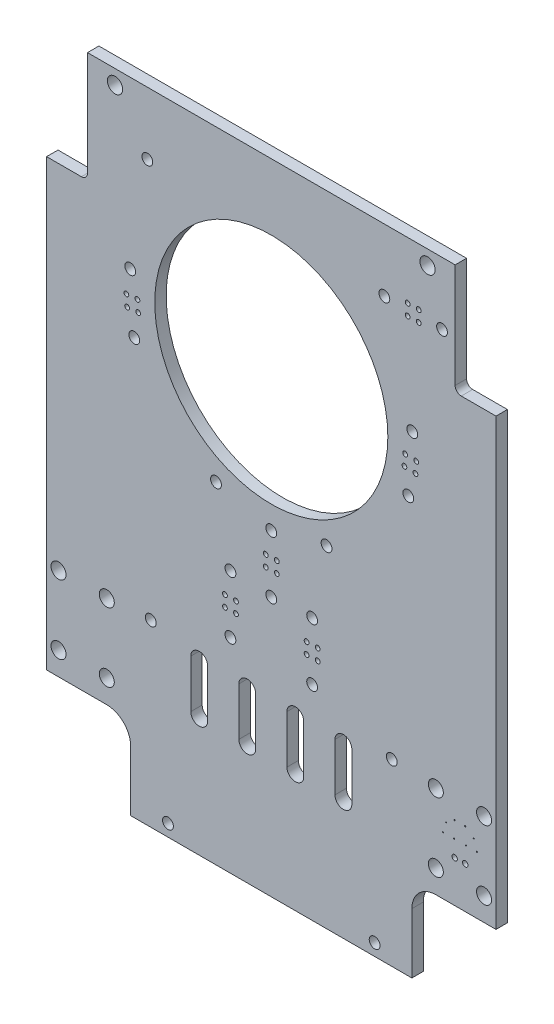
ISO-10303-21;
HEADER;
FILE_DESCRIPTION(('STEP AP214'),'2;1');
FILE_NAME('part.step','',(''),(''),'','','');
FILE_SCHEMA(('AUTOMOTIVE_DESIGN { 1 0 10303 214 1 1 1 1 }'));
ENDSEC;
DATA;
#1=APPLICATION_CONTEXT('core data for automotive mechanical design processes');
#2=APPLICATION_PROTOCOL_DEFINITION('international standard','automotive_design',2000,#1);
#3=PRODUCT_CONTEXT('',#1,'mechanical');
#4=PRODUCT('Part','Part','',(#3));
#5=PRODUCT_RELATED_PRODUCT_CATEGORY('part','',(#4));
#6=PRODUCT_DEFINITION_FORMATION('','',#4);
#7=PRODUCT_DEFINITION_CONTEXT('part definition',#1,'design');
#8=PRODUCT_DEFINITION('design','',#6,#7);
#9=PRODUCT_DEFINITION_SHAPE('','',#8);
#10=(LENGTH_UNIT() NAMED_UNIT(*) SI_UNIT(.MILLI.,.METRE.));
#11=(NAMED_UNIT(*) PLANE_ANGLE_UNIT() SI_UNIT($,.RADIAN.));
#12=(NAMED_UNIT(*) SI_UNIT($,.STERADIAN.) SOLID_ANGLE_UNIT());
#13=UNCERTAINTY_MEASURE_WITH_UNIT(LENGTH_MEASURE(1.E-05),#10,'distance_accuracy_value','');
#14=(GEOMETRIC_REPRESENTATION_CONTEXT(3) GLOBAL_UNCERTAINTY_ASSIGNED_CONTEXT((#13)) GLOBAL_UNIT_ASSIGNED_CONTEXT((#10,
#11,#12)) REPRESENTATION_CONTEXT('',''));
#15=CARTESIAN_POINT('',(0.,0.,0.));
#16=DIRECTION('',(0.,0.,1.));
#17=DIRECTION('',(1.,0.,0.));
#18=AXIS2_PLACEMENT_3D('',#15,#16,#17);
#19=CARTESIAN_POINT('',(68.4999999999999,-215.,4.75));
#20=DIRECTION('',(0.,0.,1.));
#21=DIRECTION('',(1.,0.,0.));
#22=AXIS2_PLACEMENT_3D('',#19,#20,#21);
#23=PLANE('',#22);
#24=CARTESIAN_POINT('',(65.0266,20.0200000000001,4.75));
#25=DIRECTION('',(0.,0.,1.));
#26=DIRECTION('',(-1.,0.,0.));
#27=AXIS2_PLACEMENT_3D('',#24,#25,#26);
#28=CIRCLE('',#27,3.175);
#29=CARTESIAN_POINT('',(61.8516,20.0200000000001,4.75));
#30=VERTEX_POINT('',#29);
#31=EDGE_CURVE('E348',#30,#30,#28,.T.);
#32=ORIENTED_EDGE('',*,*,#31,.F.);
#33=EDGE_LOOP('',(#32));
#34=FACE_BOUND('',#33,.T.);
#35=CARTESIAN_POINT('',(-65.0266,20.0200000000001,4.75));
#36=DIRECTION('',(0.,0.,1.));
#37=DIRECTION('',(1.,0.,0.));
#38=AXIS2_PLACEMENT_3D('',#35,#36,#37);
#39=CIRCLE('',#38,3.175);
#40=CARTESIAN_POINT('',(-61.8516,20.0200000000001,4.75));
#41=VERTEX_POINT('',#40);
#42=EDGE_CURVE('E340',#41,#41,#39,.T.);
#43=ORIENTED_EDGE('',*,*,#42,.F.);
#44=EDGE_LOOP('',(#43));
#45=FACE_BOUND('',#44,.T.);
#46=CARTESIAN_POINT('',(79.04,-17.46,4.75));
#47=DIRECTION('',(0.,0.,1.));
#48=DIRECTION('',(1.,0.,0.));
#49=AXIS2_PLACEMENT_3D('',#46,#47,#48);
#50=CIRCLE('',#49,2.54);
#51=CARTESIAN_POINT('',(79.04,-20.,4.75));
#52=VERTEX_POINT('',#51);
#53=CARTESIAN_POINT('',(76.5,-17.46,4.75));
#54=VERTEX_POINT('',#53);
#55=EDGE_CURVE('E11',#52,#54,#50,.F.);
#56=ORIENTED_EDGE('',*,*,#55,.T.);
#57=DIRECTION('',(0.,-1.,0.));
#58=VECTOR('',#57,1.);
#59=CARTESIAN_POINT('',(76.5,26.,4.75));
#60=LINE('',#59,#58);
#61=CARTESIAN_POINT('',(76.5,26.,4.75));
#62=VERTEX_POINT('',#61);
#63=EDGE_CURVE('E278',#62,#54,#60,.T.);
#64=ORIENTED_EDGE('',*,*,#63,.F.);
#65=DIRECTION('',(1.,0.,0.));
#66=VECTOR('',#65,1.);
#67=CARTESIAN_POINT('',(-93.5,26.,4.75));
#68=LINE('',#67,#66);
#69=CARTESIAN_POINT('',(-76.482,26.,4.75));
#70=VERTEX_POINT('',#69);
#71=EDGE_CURVE('E275',#70,#62,#68,.T.);
#72=ORIENTED_EDGE('',*,*,#71,.F.);
#73=DIRECTION('',(0.,1.,0.));
#74=VECTOR('',#73,1.);
#75=CARTESIAN_POINT('',(-76.482,26.,4.75));
#76=LINE('',#75,#74);
#77=CARTESIAN_POINT('',(-76.482,-17.46,4.75));
#78=VERTEX_POINT('',#77);
#79=EDGE_CURVE('E269',#78,#70,#76,.T.);
#80=ORIENTED_EDGE('',*,*,#79,.F.);
#81=CARTESIAN_POINT('',(-79.022,-17.46,4.75));
#82=DIRECTION('',(0.,0.,1.));
#83=DIRECTION('',(1.,0.,0.));
#84=AXIS2_PLACEMENT_3D('',#81,#82,#83);
#85=CIRCLE('',#84,2.54);
#86=CARTESIAN_POINT('',(-79.022,-20.,4.75));
#87=VERTEX_POINT('',#86);
#88=EDGE_CURVE('E268',#78,#87,#85,.F.);
#89=ORIENTED_EDGE('',*,*,#88,.T.);
#90=DIRECTION('',(1.,0.,0.));
#91=VECTOR('',#90,1.);
#92=CARTESIAN_POINT('',(-93.5,-20.,4.75));
#93=LINE('',#92,#91);
#94=CARTESIAN_POINT('',(-93.5,-20.,4.75));
#95=VERTEX_POINT('',#94);
#96=EDGE_CURVE('E251',#95,#87,#93,.T.);
#97=ORIENTED_EDGE('',*,*,#96,.F.);
#98=DIRECTION('',(0.,1.,0.));
#99=VECTOR('',#98,1.);
#100=CARTESIAN_POINT('',(-93.5,-205.,4.75));
#101=LINE('',#100,#99);
#102=CARTESIAN_POINT('',(-93.5,-205.,4.75));
#103=VERTEX_POINT('',#102);
#104=EDGE_CURVE('E266',#103,#95,#101,.T.);
#105=ORIENTED_EDGE('',*,*,#104,.F.);
#106=DIRECTION('',(-1.,0.,0.));
#107=VECTOR('',#106,1.);
#108=CARTESIAN_POINT('',(-68.5,-205.,4.75));
#109=LINE('',#108,#107);
#110=CARTESIAN_POINT('',(-68.5,-205.,4.75));
#111=VERTEX_POINT('',#110);
#112=EDGE_CURVE('E276',#111,#103,#109,.T.);
#113=ORIENTED_EDGE('',*,*,#112,.F.);
#114=CARTESIAN_POINT('',(-68.5,-215.,4.75));
#115=DIRECTION('',(0.,0.,-1.));
#116=DIRECTION('',(-1.,0.,0.));
#117=AXIS2_PLACEMENT_3D('',#114,#115,#116);
#118=CIRCLE('',#117,10.);
#119=CARTESIAN_POINT('',(-58.5,-215.,4.75));
#120=VERTEX_POINT('',#119);
#121=EDGE_CURVE('E305',#111,#120,#118,.T.);
#122=ORIENTED_EDGE('',*,*,#121,.T.);
#123=DIRECTION('',(0.,-1.,0.));
#124=VECTOR('',#123,1.);
#125=CARTESIAN_POINT('',(-58.5,-215.,4.75));
#126=LINE('',#125,#124);
#127=CARTESIAN_POINT('',(-58.5,-240.,4.75));
#128=VERTEX_POINT('',#127);
#129=EDGE_CURVE('E302',#120,#128,#126,.T.);
#130=ORIENTED_EDGE('',*,*,#129,.T.);
#131=DIRECTION('',(-1.,0.,0.));
#132=VECTOR('',#131,1.);
#133=CARTESIAN_POINT('',(58.4999999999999,-240.,4.75));
#134=LINE('',#133,#132);
#135=CARTESIAN_POINT('',(58.4999999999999,-240.,4.75));
#136=VERTEX_POINT('',#135);
#137=EDGE_CURVE('E299',#136,#128,#134,.T.);
#138=ORIENTED_EDGE('',*,*,#137,.F.);
#139=DIRECTION('',(0.,-1.,0.));
#140=VECTOR('',#139,1.);
#141=CARTESIAN_POINT('',(58.4999999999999,-215.,4.75));
#142=LINE('',#141,#140);
#143=CARTESIAN_POINT('',(58.4999999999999,-215.,4.75));
#144=VERTEX_POINT('',#143);
#145=EDGE_CURVE('E296',#144,#136,#142,.T.);
#146=ORIENTED_EDGE('',*,*,#145,.F.);
#147=CARTESIAN_POINT('',(68.4999999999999,-215.,4.75));
#148=DIRECTION('',(0.,0.,1.));
#149=DIRECTION('',(1.,0.,0.));
#150=AXIS2_PLACEMENT_3D('',#147,#148,#149);
#151=CIRCLE('',#150,10.);
#152=CARTESIAN_POINT('',(68.4999999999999,-205.,4.75));
#153=VERTEX_POINT('',#152);
#154=EDGE_CURVE('E293',#153,#144,#151,.T.);
#155=ORIENTED_EDGE('',*,*,#154,.F.);
#156=DIRECTION('',(1.,0.,0.));
#157=VECTOR('',#156,1.);
#158=CARTESIAN_POINT('',(68.4999999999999,-205.,4.75));
#159=LINE('',#158,#157);
#160=CARTESIAN_POINT('',(93.4999999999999,-205.,4.75));
#161=VERTEX_POINT('',#160);
#162=EDGE_CURVE('E290',#153,#161,#159,.T.);
#163=ORIENTED_EDGE('',*,*,#162,.T.);
#164=DIRECTION('',(0.,1.,0.));
#165=VECTOR('',#164,1.);
#166=CARTESIAN_POINT('',(93.4999999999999,-205.,4.75));
#167=LINE('',#166,#165);
#168=CARTESIAN_POINT('',(93.4999999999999,-20.,4.75));
#169=VERTEX_POINT('',#168);
#170=EDGE_CURVE('E287',#161,#169,#167,.T.);
#171=ORIENTED_EDGE('',*,*,#170,.T.);
#172=DIRECTION('',(1.,0.,0.));
#173=VECTOR('',#172,1.);
#174=CARTESIAN_POINT('',(76.5,-20.,4.75));
#175=LINE('',#174,#173);
#176=EDGE_CURVE('E285',#52,#169,#175,.T.);
#177=ORIENTED_EDGE('',*,*,#176,.F.);
#178=EDGE_LOOP('',(#56,#64,#72,#80,#89,#97,#105,#113,#122,#130,#138,#146,#155,#163,#171,#177));
#179=FACE_BOUND('',#178,.T.);
#180=CARTESIAN_POINT('',(-68.4621723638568,-166.664839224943,4.75));
#181=DIRECTION('',(0.,0.,-1.));
#182=DIRECTION('',(-1.,0.,0.));
#183=AXIS2_PLACEMENT_3D('',#180,#181,#182);
#184=CIRCLE('',#183,3.125);
#185=CARTESIAN_POINT('',(-71.5871723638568,-166.664839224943,4.75));
#186=VERTEX_POINT('',#185);
#187=EDGE_CURVE('E361',#186,#186,#184,.T.);
#188=ORIENTED_EDGE('',*,*,#187,.T.);
#189=EDGE_LOOP('',(#188));
#190=FACE_BOUND('',#189,.T.);
#191=CARTESIAN_POINT('',(-68.4621723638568,-195.335160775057,4.75));
#192=DIRECTION('',(0.,0.,-1.));
#193=DIRECTION('',(-1.,0.,0.));
#194=AXIS2_PLACEMENT_3D('',#191,#192,#193);
#195=CIRCLE('',#194,3.125);
#196=CARTESIAN_POINT('',(-71.5871723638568,-195.335160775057,4.75));
#197=VERTEX_POINT('',#196);
#198=EDGE_CURVE('E367',#197,#197,#195,.T.);
#199=ORIENTED_EDGE('',*,*,#198,.T.);
#200=EDGE_LOOP('',(#199));
#201=FACE_BOUND('',#200,.T.);
#202=CARTESIAN_POINT('',(-88.5373476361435,-195.335160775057,4.75));
#203=DIRECTION('',(0.,0.,-1.));
#204=DIRECTION('',(-1.,0.,0.));
#205=AXIS2_PLACEMENT_3D('',#202,#203,#204);
#206=CIRCLE('',#205,3.125);
#207=CARTESIAN_POINT('',(-91.6623476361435,-195.335160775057,4.75));
#208=VERTEX_POINT('',#207);
#209=EDGE_CURVE('E373',#208,#208,#206,.T.);
#210=ORIENTED_EDGE('',*,*,#209,.T.);
#211=EDGE_LOOP('',(#210));
#212=FACE_BOUND('',#211,.T.);
#213=CARTESIAN_POINT('',(-88.5373476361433,-166.664839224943,4.75));
#214=DIRECTION('',(0.,0.,-1.));
#215=DIRECTION('',(-1.,0.,0.));
#216=AXIS2_PLACEMENT_3D('',#213,#214,#215);
#217=CIRCLE('',#216,3.125);
#218=CARTESIAN_POINT('',(-91.6623476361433,-166.664839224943,4.75));
#219=VERTEX_POINT('',#218);
#220=EDGE_CURVE('E379',#219,#219,#217,.T.);
#221=ORIENTED_EDGE('',*,*,#220,.T.);
#222=EDGE_LOOP('',(#221));
#223=FACE_BOUND('',#222,.T.);
#224=CARTESIAN_POINT('',(71.4,-181.,4.75));
#225=DIRECTION('',(0.,0.,1.));
#226=DIRECTION('',(1.,0.,0.));
#227=AXIS2_PLACEMENT_3D('',#224,#225,#226);
#228=CIRCLE('',#227,0.228599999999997);
#229=CARTESIAN_POINT('',(71.6286,-181.,4.75));
#230=VERTEX_POINT('',#229);
#231=EDGE_CURVE('E391',#230,#230,#228,.T.);
#232=ORIENTED_EDGE('',*,*,#231,.F.);
#233=EDGE_LOOP('',(#232));
#234=FACE_BOUND('',#233,.T.);
#235=CARTESIAN_POINT('',(76.3059793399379,-174.247498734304,4.75));
#236=DIRECTION('',(0.,0.,1.));
#237=DIRECTION('',(1.,0.,0.));
#238=AXIS2_PLACEMENT_3D('',#235,#236,#237);
#239=CIRCLE('',#238,0.228599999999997);
#240=CARTESIAN_POINT('',(76.5345793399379,-174.247498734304,4.75));
#241=VERTEX_POINT('',#240);
#242=EDGE_CURVE('E403',#241,#241,#239,.T.);
#243=ORIENTED_EDGE('',*,*,#242,.F.);
#244=EDGE_LOOP('',(#243));
#245=FACE_BOUND('',#244,.T.);
#246=CARTESIAN_POINT('',(84.2440206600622,-176.826724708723,4.75));
#247=DIRECTION('',(0.,0.,1.));
#248=DIRECTION('',(1.,0.,0.));
#249=AXIS2_PLACEMENT_3D('',#246,#247,#248);
#250=CIRCLE('',#249,0.228599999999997);
#251=CARTESIAN_POINT('',(84.4726206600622,-176.826724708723,4.75));
#252=VERTEX_POINT('',#251);
#253=EDGE_CURVE('E415',#252,#252,#250,.T.);
#254=ORIENTED_EDGE('',*,*,#253,.F.);
#255=EDGE_LOOP('',(#254));
#256=FACE_BOUND('',#255,.T.);
#257=CARTESIAN_POINT('',(76.,-181.,4.75));
#258=DIRECTION('',(0.,0.,1.));
#259=DIRECTION('',(1.,0.,0.));
#260=AXIS2_PLACEMENT_3D('',#257,#258,#259);
#261=CIRCLE('',#260,0.228599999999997);
#262=CARTESIAN_POINT('',(76.2286,-181.,4.75));
#263=VERTEX_POINT('',#262);
#264=EDGE_CURVE('E427',#263,#263,#261,.T.);
#265=ORIENTED_EDGE('',*,*,#264,.F.);
#266=EDGE_LOOP('',(#265));
#267=FACE_BOUND('',#266,.T.);
#268=CARTESIAN_POINT('',(76.3059793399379,-187.752501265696,4.75));
#269=DIRECTION('',(0.,0.,1.));
#270=DIRECTION('',(1.,0.,0.));
#271=AXIS2_PLACEMENT_3D('',#268,#269,#270);
#272=CIRCLE('',#271,1.1303);
#273=CARTESIAN_POINT('',(77.4362793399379,-187.752501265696,4.75));
#274=VERTEX_POINT('',#273);
#275=EDGE_CURVE('E439',#274,#274,#272,.T.);
#276=ORIENTED_EDGE('',*,*,#275,.F.);
#277=EDGE_LOOP('',(#276));
#278=FACE_BOUND('',#277,.T.);
#279=CARTESIAN_POINT('',(88.5373476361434,-195.335160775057,4.75));
#280=DIRECTION('',(0.,0.,1.));
#281=DIRECTION('',(1.,0.,0.));
#282=AXIS2_PLACEMENT_3D('',#279,#280,#281);
#283=CIRCLE('',#282,3.125);
#284=CARTESIAN_POINT('',(91.6623476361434,-195.335160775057,4.75));
#285=VERTEX_POINT('',#284);
#286=EDGE_CURVE('E451',#285,#285,#283,.T.);
#287=ORIENTED_EDGE('',*,*,#286,.F.);
#288=EDGE_LOOP('',(#287));
#289=FACE_BOUND('',#288,.T.);
#290=CARTESIAN_POINT('',(68.4621723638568,-166.664839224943,4.75));
#291=DIRECTION('',(0.,0.,1.));
#292=DIRECTION('',(1.,0.,0.));
#293=AXIS2_PLACEMENT_3D('',#290,#291,#292);
#294=CIRCLE('',#293,3.125);
#295=CARTESIAN_POINT('',(71.5871723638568,-166.664839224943,4.75));
#296=VERTEX_POINT('',#295);
#297=EDGE_CURVE('E463',#296,#296,#294,.T.);
#298=ORIENTED_EDGE('',*,*,#297,.F.);
#299=EDGE_LOOP('',(#298));
#300=FACE_BOUND('',#299,.T.);
#301=CARTESIAN_POINT('',(-30.,-170.,4.75));
#302=DIRECTION('',(0.,0.,-1.));
#303=DIRECTION('',(-1.,0.,0.));
#304=AXIS2_PLACEMENT_3D('',#301,#302,#303);
#305=CIRCLE('',#304,3.5);
#306=CARTESIAN_POINT('',(-33.5000000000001,-170.,4.75));
#307=VERTEX_POINT('',#306);
#308=CARTESIAN_POINT('',(-26.5,-170.,4.75));
#309=VERTEX_POINT('',#308);
#310=EDGE_CURVE('E477',#307,#309,#305,.T.);
#311=ORIENTED_EDGE('',*,*,#310,.T.);
#312=DIRECTION('',(0.,-1.,0.));
#313=VECTOR('',#312,1.);
#314=CARTESIAN_POINT('',(-26.5,-170.,4.75));
#315=LINE('',#314,#313);
#316=CARTESIAN_POINT('',(-26.5000000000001,-190.,4.75));
#317=VERTEX_POINT('',#316);
#318=EDGE_CURVE('E480',#309,#317,#315,.T.);
#319=ORIENTED_EDGE('',*,*,#318,.T.);
#320=CARTESIAN_POINT('',(-30.0000000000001,-190.,4.75));
#321=DIRECTION('',(0.,0.,-1.));
#322=DIRECTION('',(-1.,0.,0.));
#323=AXIS2_PLACEMENT_3D('',#320,#321,#322);
#324=CIRCLE('',#323,3.5);
#325=CARTESIAN_POINT('',(-33.5,-190.,4.75));
#326=VERTEX_POINT('',#325);
#327=EDGE_CURVE('E483',#317,#326,#324,.T.);
#328=ORIENTED_EDGE('',*,*,#327,.T.);
#329=DIRECTION('',(0.,-1.,0.));
#330=VECTOR('',#329,1.);
#331=CARTESIAN_POINT('',(-33.5000000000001,-170.,4.75));
#332=LINE('',#331,#330);
#333=EDGE_CURVE('E486',#307,#326,#332,.T.);
#334=ORIENTED_EDGE('',*,*,#333,.F.);
#335=EDGE_LOOP('',(#311,#319,#328,#334));
#336=FACE_BOUND('',#335,.T.);
#337=DIRECTION('',(0.,-1.,0.));
#338=VECTOR('',#337,1.);
#339=CARTESIAN_POINT('',(6.5,-170.,4.75));
#340=LINE('',#339,#338);
#341=CARTESIAN_POINT('',(6.5,-170.,4.75));
#342=VERTEX_POINT('',#341);
#343=CARTESIAN_POINT('',(6.5,-190.,4.75));
#344=VERTEX_POINT('',#343);
#345=EDGE_CURVE('E607',#342,#344,#340,.T.);
#346=ORIENTED_EDGE('',*,*,#345,.F.);
#347=CARTESIAN_POINT('',(10.,-170.,4.75));
#348=DIRECTION('',(0.,0.,1.));
#349=DIRECTION('',(1.,0.,0.));
#350=AXIS2_PLACEMENT_3D('',#347,#348,#349);
#351=CIRCLE('',#350,3.5);
#352=CARTESIAN_POINT('',(13.5,-170.,4.75));
#353=VERTEX_POINT('',#352);
#354=EDGE_CURVE('E604',#353,#342,#351,.T.);
#355=ORIENTED_EDGE('',*,*,#354,.F.);
#356=DIRECTION('',(0.,-1.,0.));
#357=VECTOR('',#356,1.);
#358=CARTESIAN_POINT('',(13.5,-170.,4.75));
#359=LINE('',#358,#357);
#360=CARTESIAN_POINT('',(13.5,-190.,4.75));
#361=VERTEX_POINT('',#360);
#362=EDGE_CURVE('E612',#353,#361,#359,.T.);
#363=ORIENTED_EDGE('',*,*,#362,.T.);
#364=CARTESIAN_POINT('',(10.,-190.,4.75));
#365=DIRECTION('',(0.,0.,1.));
#366=DIRECTION('',(1.,0.,0.));
#367=AXIS2_PLACEMENT_3D('',#364,#365,#366);
#368=CIRCLE('',#367,3.5);
#369=EDGE_CURVE('E610',#344,#361,#368,.T.);
#370=ORIENTED_EDGE('',*,*,#369,.F.);
#371=EDGE_LOOP('',(#346,#355,#363,#370));
#372=FACE_BOUND('',#371,.T.);
#373=CARTESIAN_POINT('',(-43.,-235.,4.75));
#374=DIRECTION('',(0.,0.,1.));
#375=DIRECTION('',(1.,0.,0.));
#376=AXIS2_PLACEMENT_3D('',#373,#374,#375);
#377=CIRCLE('',#376,2.25);
#378=CARTESIAN_POINT('',(-40.75,-235.,4.75));
#379=VERTEX_POINT('',#378);
#380=EDGE_CURVE('E633',#379,#379,#377,.T.);
#381=ORIENTED_EDGE('',*,*,#380,.F.);
#382=EDGE_LOOP('',(#381));
#383=FACE_BOUND('',#382,.T.);
#384=CARTESIAN_POINT('',(0.,-132.,4.75));
#385=DIRECTION('',(0.,0.,1.));
#386=DIRECTION('',(1.,0.,0.));
#387=AXIS2_PLACEMENT_3D('',#384,#385,#386);
#388=CIRCLE('',#387,2.25);
#389=CARTESIAN_POINT('',(2.25000000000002,-132.,4.75));
#390=VERTEX_POINT('',#389);
#391=EDGE_CURVE('E645',#390,#390,#388,.T.);
#392=ORIENTED_EDGE('',*,*,#391,.F.);
#393=EDGE_LOOP('',(#392));
#394=FACE_BOUND('',#393,.T.);
#395=CARTESIAN_POINT('',(-2.29999999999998,-117.7,4.75));
#396=DIRECTION('',(0.,0.,1.));
#397=DIRECTION('',(1.,0.,0.));
#398=AXIS2_PLACEMENT_3D('',#395,#396,#397);
#399=CIRCLE('',#398,1.);
#400=CARTESIAN_POINT('',(-1.29999999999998,-117.7,4.75));
#401=VERTEX_POINT('',#400);
#402=EDGE_CURVE('E657',#401,#401,#399,.T.);
#403=ORIENTED_EDGE('',*,*,#402,.F.);
#404=EDGE_LOOP('',(#403));
#405=FACE_BOUND('',#404,.T.);
#406=CARTESIAN_POINT('',(17.,-131.,4.75));
#407=DIRECTION('',(0.,0.,1.));
#408=DIRECTION('',(1.,0.,0.));
#409=AXIS2_PLACEMENT_3D('',#406,#407,#408);
#410=CIRCLE('',#409,2.25);
#411=CARTESIAN_POINT('',(19.25,-131.,4.75));
#412=VERTEX_POINT('',#411);
#413=EDGE_CURVE('E669',#412,#412,#410,.T.);
#414=ORIENTED_EDGE('',*,*,#413,.F.);
#415=EDGE_LOOP('',(#414));
#416=FACE_BOUND('',#415,.T.);
#417=CARTESIAN_POINT('',(14.7,-145.3,4.75));
#418=DIRECTION('',(0.,0.,1.));
#419=DIRECTION('',(1.,0.,0.));
#420=AXIS2_PLACEMENT_3D('',#417,#418,#419);
#421=CIRCLE('',#420,1.);
#422=CARTESIAN_POINT('',(15.7,-145.3,4.75));
#423=VERTEX_POINT('',#422);
#424=EDGE_CURVE('E681',#423,#423,#421,.T.);
#425=ORIENTED_EDGE('',*,*,#424,.F.);
#426=EDGE_LOOP('',(#425));
#427=FACE_BOUND('',#426,.T.);
#428=CARTESIAN_POINT('',(14.7,-140.7,4.75));
#429=DIRECTION('',(0.,0.,1.));
#430=DIRECTION('',(1.,0.,0.));
#431=AXIS2_PLACEMENT_3D('',#428,#429,#430);
#432=CIRCLE('',#431,1.);
#433=CARTESIAN_POINT('',(15.7,-140.7,4.75));
#434=VERTEX_POINT('',#433);
#435=EDGE_CURVE('E693',#434,#434,#432,.T.);
#436=ORIENTED_EDGE('',*,*,#435,.F.);
#437=EDGE_LOOP('',(#436));
#438=FACE_BOUND('',#437,.T.);
#439=CARTESIAN_POINT('',(-19.3,-140.7,4.75));
#440=DIRECTION('',(0.,0.,-1.));
#441=DIRECTION('',(-1.,0.,0.));
#442=AXIS2_PLACEMENT_3D('',#439,#440,#441);
#443=CIRCLE('',#442,1.);
#444=CARTESIAN_POINT('',(-20.3,-140.7,4.75));
#445=VERTEX_POINT('',#444);
#446=EDGE_CURVE('E699',#445,#445,#443,.T.);
#447=ORIENTED_EDGE('',*,*,#446,.T.);
#448=EDGE_LOOP('',(#447));
#449=FACE_BOUND('',#448,.T.);
#450=CARTESIAN_POINT('',(2.30000000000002,-122.3,4.75));
#451=DIRECTION('',(0.,0.,1.));
#452=DIRECTION('',(1.,0.,0.));
#453=AXIS2_PLACEMENT_3D('',#450,#451,#452);
#454=CIRCLE('',#453,1.);
#455=CARTESIAN_POINT('',(3.30000000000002,-122.3,4.75));
#456=VERTEX_POINT('',#455);
#457=EDGE_CURVE('E711',#456,#456,#454,.T.);
#458=ORIENTED_EDGE('',*,*,#457,.F.);
#459=EDGE_LOOP('',(#458));
#460=FACE_BOUND('',#459,.T.);
#461=CARTESIAN_POINT('',(-23.,-102.,4.75));
#462=DIRECTION('',(0.,0.,1.));
#463=DIRECTION('',(1.,0.,0.));
#464=AXIS2_PLACEMENT_3D('',#461,#462,#463);
#465=CIRCLE('',#464,2.25);
#466=CARTESIAN_POINT('',(-20.75,-102.,4.75));
#467=VERTEX_POINT('',#466);
#468=EDGE_CURVE('E723',#467,#467,#465,.T.);
#469=ORIENTED_EDGE('',*,*,#468,.F.);
#470=EDGE_LOOP('',(#469));
#471=FACE_BOUND('',#470,.T.);
#472=CARTESIAN_POINT('',(56.7519999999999,2.30000000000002,4.75));
#473=DIRECTION('',(0.,0.,1.));
#474=DIRECTION('',(1.,0.,0.));
#475=AXIS2_PLACEMENT_3D('',#472,#473,#474);
#476=CIRCLE('',#475,0.999999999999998);
#477=CARTESIAN_POINT('',(57.7519999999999,2.30000000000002,4.75));
#478=VERTEX_POINT('',#477);
#479=EDGE_CURVE('E735',#478,#478,#476,.T.);
#480=ORIENTED_EDGE('',*,*,#479,.F.);
#481=EDGE_LOOP('',(#480));
#482=FACE_BOUND('',#481,.T.);
#483=CARTESIAN_POINT('',(56.7519999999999,-2.29999999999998,4.75));
#484=DIRECTION('',(0.,0.,1.));
#485=DIRECTION('',(1.,0.,0.));
#486=AXIS2_PLACEMENT_3D('',#483,#484,#485);
#487=CIRCLE('',#486,0.999999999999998);
#488=CARTESIAN_POINT('',(57.7519999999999,-2.29999999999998,4.75));
#489=VERTEX_POINT('',#488);
#490=EDGE_CURVE('E747',#489,#489,#487,.T.);
#491=ORIENTED_EDGE('',*,*,#490,.F.);
#492=EDGE_LOOP('',(#491));
#493=FACE_BOUND('',#492,.T.);
#494=CARTESIAN_POINT('',(71.0519999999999,0.,4.75));
#495=DIRECTION('',(0.,0.,1.));
#496=DIRECTION('',(1.,0.,0.));
#497=AXIS2_PLACEMENT_3D('',#494,#495,#496);
#498=CIRCLE('',#497,2.25);
#499=CARTESIAN_POINT('',(73.3019999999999,0.,4.75));
#500=VERTEX_POINT('',#499);
#501=EDGE_CURVE('E759',#500,#500,#498,.T.);
#502=ORIENTED_EDGE('',*,*,#501,.F.);
#503=EDGE_LOOP('',(#502));
#504=FACE_BOUND('',#503,.T.);
#505=CARTESIAN_POINT('',(50.1310505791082,-165.357518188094,4.75));
#506=DIRECTION('',(0.,0.,1.));
#507=DIRECTION('',(1.,0.,0.));
#508=AXIS2_PLACEMENT_3D('',#505,#506,#507);
#509=CIRCLE('',#508,2.25);
#510=CARTESIAN_POINT('',(52.3810505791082,-165.357518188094,4.75));
#511=VERTEX_POINT('',#510);
#512=EDGE_CURVE('E777',#511,#511,#509,.T.);
#513=ORIENTED_EDGE('',*,*,#512,.F.);
#514=EDGE_LOOP('',(#513));
#515=FACE_BOUND('',#514,.T.);
#516=CARTESIAN_POINT('',(-58.6850776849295,-43.0292313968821,4.75));
#517=DIRECTION('',(0.,0.,-1.));
#518=DIRECTION('',(-1.,0.,0.));
#519=AXIS2_PLACEMENT_3D('',#516,#517,#518);
#520=CIRCLE('',#519,2.25);
#521=CARTESIAN_POINT('',(-60.9350776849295,-43.0292313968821,4.75));
#522=VERTEX_POINT('',#521);
#523=EDGE_CURVE('E783',#522,#522,#520,.T.);
#524=ORIENTED_EDGE('',*,*,#523,.T.);
#525=EDGE_LOOP('',(#524));
#526=FACE_BOUND('',#525,.T.);
#527=CARTESIAN_POINT('',(-57.0109223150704,-66.9707686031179,4.75));
#528=DIRECTION('',(0.,0.,-1.));
#529=DIRECTION('',(-1.,0.,0.));
#530=AXIS2_PLACEMENT_3D('',#527,#528,#529);
#531=CIRCLE('',#530,2.25);
#532=CARTESIAN_POINT('',(-59.2609223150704,-66.9707686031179,4.75));
#533=VERTEX_POINT('',#532);
#534=EDGE_CURVE('E789',#533,#533,#531,.T.);
#535=ORIENTED_EDGE('',*,*,#534,.T.);
#536=EDGE_LOOP('',(#535));
#537=FACE_BOUND('',#536,.T.);
#538=CARTESIAN_POINT('',(-60.3028372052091,-52.8660425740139,4.75));
#539=DIRECTION('',(0.,0.,-1.));
#540=DIRECTION('',(-1.,0.,0.));
#541=AXIS2_PLACEMENT_3D('',#538,#539,#540);
#542=CIRCLE('',#541,0.999999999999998);
#543=CARTESIAN_POINT('',(-61.3028372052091,-52.8660425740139,4.75));
#544=VERTEX_POINT('',#543);
#545=EDGE_CURVE('E795',#544,#544,#542,.T.);
#546=ORIENTED_EDGE('',*,*,#545,.T.);
#547=EDGE_LOOP('',(#546));
#548=FACE_BOUND('',#547,.T.);
#549=CARTESIAN_POINT('',(-55.7140425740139,-52.5451627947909,4.75));
#550=DIRECTION('',(0.,0.,-1.));
#551=DIRECTION('',(-1.,0.,0.));
#552=AXIS2_PLACEMENT_3D('',#549,#550,#551);
#553=CIRCLE('',#552,0.999999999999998);
#554=CARTESIAN_POINT('',(-56.7140425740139,-52.5451627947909,4.75));
#555=VERTEX_POINT('',#554);
#556=EDGE_CURVE('E801',#555,#555,#553,.T.);
#557=ORIENTED_EDGE('',*,*,#556,.T.);
#558=EDGE_LOOP('',(#557));
#559=FACE_BOUND('',#558,.T.);
#560=CARTESIAN_POINT('',(-55.3931627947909,-57.1339574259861,4.75));
#561=DIRECTION('',(0.,0.,-1.));
#562=DIRECTION('',(-1.,0.,0.));
#563=AXIS2_PLACEMENT_3D('',#560,#561,#562);
#564=CIRCLE('',#563,0.999999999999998);
#565=CARTESIAN_POINT('',(-56.3931627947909,-57.1339574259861,4.75));
#566=VERTEX_POINT('',#565);
#567=EDGE_CURVE('E807',#566,#566,#564,.T.);
#568=ORIENTED_EDGE('',*,*,#567,.T.);
#569=EDGE_LOOP('',(#568));
#570=FACE_BOUND('',#569,.T.);
#571=CARTESIAN_POINT('',(-59.9819574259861,-57.4548372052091,4.75));
#572=DIRECTION('',(0.,0.,-1.));
#573=DIRECTION('',(-1.,0.,0.));
#574=AXIS2_PLACEMENT_3D('',#571,#572,#573);
#575=CIRCLE('',#574,0.999999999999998);
#576=CARTESIAN_POINT('',(-60.9819574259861,-57.4548372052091,4.75));
#577=VERTEX_POINT('',#576);
#578=EDGE_CURVE('E813',#577,#577,#575,.T.);
#579=ORIENTED_EDGE('',*,*,#578,.T.);
#580=EDGE_LOOP('',(#579));
#581=FACE_BOUND('',#580,.T.);
#582=CARTESIAN_POINT('',(55.3931627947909,-57.1339574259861,4.75));
#583=DIRECTION('',(0.,0.,1.));
#584=DIRECTION('',(1.,0.,0.));
#585=AXIS2_PLACEMENT_3D('',#582,#583,#584);
#586=CIRCLE('',#585,0.999999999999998);
#587=CARTESIAN_POINT('',(56.3931627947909,-57.1339574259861,4.75));
#588=VERTEX_POINT('',#587);
#589=EDGE_CURVE('E825',#588,#588,#586,.T.);
#590=ORIENTED_EDGE('',*,*,#589,.F.);
#591=EDGE_LOOP('',(#590));
#592=FACE_BOUND('',#591,.T.);
#593=CARTESIAN_POINT('',(60.3028372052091,-52.8660425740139,4.75));
#594=DIRECTION('',(0.,0.,1.));
#595=DIRECTION('',(1.,0.,0.));
#596=AXIS2_PLACEMENT_3D('',#593,#594,#595);
#597=CIRCLE('',#596,0.999999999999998);
#598=CARTESIAN_POINT('',(61.3028372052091,-52.8660425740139,4.75));
#599=VERTEX_POINT('',#598);
#600=EDGE_CURVE('E837',#599,#599,#597,.T.);
#601=ORIENTED_EDGE('',*,*,#600,.F.);
#602=EDGE_LOOP('',(#601));
#603=FACE_BOUND('',#602,.T.);
#604=CARTESIAN_POINT('',(0.,-50.,4.75));
#605=DIRECTION('',(0.,0.,1.));
#606=DIRECTION('',(1.,0.,0.));
#607=AXIS2_PLACEMENT_3D('',#604,#605,#606);
#608=CIRCLE('',#607,48.5);
#609=CARTESIAN_POINT('',(48.5000000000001,-50.,4.75));
#610=VERTEX_POINT('',#609);
#611=EDGE_CURVE('E849',#610,#610,#608,.T.);
#612=ORIENTED_EDGE('',*,*,#611,.F.);
#613=EDGE_LOOP('',(#612));
#614=FACE_BOUND('',#613,.T.);
#615=CARTESIAN_POINT('',(58.6850776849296,-43.0292313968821,4.75));
#616=DIRECTION('',(0.,0.,1.));
#617=DIRECTION('',(1.,0.,0.));
#618=AXIS2_PLACEMENT_3D('',#615,#616,#617);
#619=CIRCLE('',#618,2.25);
#620=CARTESIAN_POINT('',(60.9350776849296,-43.0292313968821,4.75));
#621=VERTEX_POINT('',#620);
#622=EDGE_CURVE('E855',#621,#621,#619,.T.);
#623=ORIENTED_EDGE('',*,*,#622,.F.);
#624=EDGE_LOOP('',(#623));
#625=FACE_BOUND('',#624,.T.);
#626=CARTESIAN_POINT('',(57.0109223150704,-66.9707686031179,4.75));
#627=DIRECTION('',(0.,0.,1.));
#628=DIRECTION('',(1.,0.,0.));
#629=AXIS2_PLACEMENT_3D('',#626,#627,#628);
#630=CIRCLE('',#629,2.25);
#631=CARTESIAN_POINT('',(59.2609223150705,-66.9707686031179,4.75));
#632=VERTEX_POINT('',#631);
#633=EDGE_CURVE('E843',#632,#632,#630,.T.);
#634=ORIENTED_EDGE('',*,*,#633,.F.);
#635=EDGE_LOOP('',(#634));
#636=FACE_BOUND('',#635,.T.);
#637=CARTESIAN_POINT('',(55.7140425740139,-52.5451627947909,4.75));
#638=DIRECTION('',(0.,0.,1.));
#639=DIRECTION('',(1.,0.,0.));
#640=AXIS2_PLACEMENT_3D('',#637,#638,#639);
#641=CIRCLE('',#640,0.999999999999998);
#642=CARTESIAN_POINT('',(56.7140425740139,-52.5451627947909,4.75));
#643=VERTEX_POINT('',#642);
#644=EDGE_CURVE('E831',#643,#643,#641,.T.);
#645=ORIENTED_EDGE('',*,*,#644,.F.);
#646=EDGE_LOOP('',(#645));
#647=FACE_BOUND('',#646,.T.);
#648=CARTESIAN_POINT('',(59.9819574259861,-57.4548372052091,4.75));
#649=DIRECTION('',(0.,0.,1.));
#650=DIRECTION('',(1.,0.,0.));
#651=AXIS2_PLACEMENT_3D('',#648,#649,#650);
#652=CIRCLE('',#651,0.999999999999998);
#653=CARTESIAN_POINT('',(60.9819574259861,-57.4548372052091,4.75));
#654=VERTEX_POINT('',#653);
#655=EDGE_CURVE('E819',#654,#654,#652,.T.);
#656=ORIENTED_EDGE('',*,*,#655,.F.);
#657=EDGE_LOOP('',(#656));
#658=FACE_BOUND('',#657,.T.);
#659=CARTESIAN_POINT('',(-50.1310505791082,-165.357518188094,4.75));
#660=DIRECTION('',(0.,0.,-1.));
#661=DIRECTION('',(-1.,0.,0.));
#662=AXIS2_PLACEMENT_3D('',#659,#660,#661);
#663=CIRCLE('',#662,2.25);
#664=CARTESIAN_POINT('',(-52.3810505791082,-165.357518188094,4.75));
#665=VERTEX_POINT('',#664);
#666=EDGE_CURVE('E771',#665,#665,#663,.T.);
#667=ORIENTED_EDGE('',*,*,#666,.T.);
#668=EDGE_LOOP('',(#667));
#669=FACE_BOUND('',#668,.T.);
#670=CARTESIAN_POINT('',(47.0519999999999,0.,4.75));
#671=DIRECTION('',(0.,0.,1.));
#672=DIRECTION('',(1.,0.,0.));
#673=AXIS2_PLACEMENT_3D('',#670,#671,#672);
#674=CIRCLE('',#673,2.25);
#675=CARTESIAN_POINT('',(49.3019999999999,0.,4.75));
#676=VERTEX_POINT('',#675);
#677=EDGE_CURVE('E765',#676,#676,#674,.T.);
#678=ORIENTED_EDGE('',*,*,#677,.F.);
#679=EDGE_LOOP('',(#678));
#680=FACE_BOUND('',#679,.T.);
#681=CARTESIAN_POINT('',(61.3519999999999,-2.29999999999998,4.75));
#682=DIRECTION('',(0.,0.,1.));
#683=DIRECTION('',(1.,0.,0.));
#684=AXIS2_PLACEMENT_3D('',#681,#682,#683);
#685=CIRCLE('',#684,0.999999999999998);
#686=CARTESIAN_POINT('',(62.3519999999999,-2.29999999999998,4.75));
#687=VERTEX_POINT('',#686);
#688=EDGE_CURVE('E753',#687,#687,#685,.T.);
#689=ORIENTED_EDGE('',*,*,#688,.F.);
#690=EDGE_LOOP('',(#689));
#691=FACE_BOUND('',#690,.T.);
#692=CARTESIAN_POINT('',(61.3519999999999,2.30000000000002,4.75));
#693=DIRECTION('',(0.,0.,1.));
#694=DIRECTION('',(1.,0.,0.));
#695=AXIS2_PLACEMENT_3D('',#692,#693,#694);
#696=CIRCLE('',#695,0.999999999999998);
#697=CARTESIAN_POINT('',(62.3519999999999,2.30000000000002,4.75));
#698=VERTEX_POINT('',#697);
#699=EDGE_CURVE('E741',#698,#698,#696,.T.);
#700=ORIENTED_EDGE('',*,*,#699,.F.);
#701=EDGE_LOOP('',(#700));
#702=FACE_BOUND('',#701,.T.);
#703=CARTESIAN_POINT('',(-51.5750000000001,0.,4.75));
#704=DIRECTION('',(0.,0.,1.));
#705=DIRECTION('',(1.,0.,0.));
#706=AXIS2_PLACEMENT_3D('',#703,#704,#705);
#707=CIRCLE('',#706,2.25);
#708=CARTESIAN_POINT('',(-49.3250000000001,0.,4.75));
#709=VERTEX_POINT('',#708);
#710=EDGE_CURVE('E729',#709,#709,#707,.T.);
#711=ORIENTED_EDGE('',*,*,#710,.F.);
#712=EDGE_LOOP('',(#711));
#713=FACE_BOUND('',#712,.T.);
#714=CARTESIAN_POINT('',(23.,-102.,4.75));
#715=DIRECTION('',(0.,0.,1.));
#716=DIRECTION('',(1.,0.,0.));
#717=AXIS2_PLACEMENT_3D('',#714,#715,#716);
#718=CIRCLE('',#717,2.25);
#719=CARTESIAN_POINT('',(25.25,-102.,4.75));
#720=VERTEX_POINT('',#719);
#721=EDGE_CURVE('E717',#720,#720,#718,.T.);
#722=ORIENTED_EDGE('',*,*,#721,.F.);
#723=EDGE_LOOP('',(#722));
#724=FACE_BOUND('',#723,.T.);
#725=CARTESIAN_POINT('',(-2.29999999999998,-122.3,4.75));
#726=DIRECTION('',(0.,0.,1.));
#727=DIRECTION('',(1.,0.,0.));
#728=AXIS2_PLACEMENT_3D('',#725,#726,#727);
#729=CIRCLE('',#728,1.);
#730=CARTESIAN_POINT('',(-1.29999999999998,-122.3,4.75));
#731=VERTEX_POINT('',#730);
#732=EDGE_CURVE('E705',#731,#731,#729,.T.);
#733=ORIENTED_EDGE('',*,*,#732,.F.);
#734=EDGE_LOOP('',(#733));
#735=FACE_BOUND('',#734,.T.);
#736=CARTESIAN_POINT('',(19.3,-145.3,4.75));
#737=DIRECTION('',(0.,0.,1.));
#738=DIRECTION('',(1.,0.,0.));
#739=AXIS2_PLACEMENT_3D('',#736,#737,#738);
#740=CIRCLE('',#739,1.);
#741=CARTESIAN_POINT('',(20.3,-145.3,4.75));
#742=VERTEX_POINT('',#741);
#743=EDGE_CURVE('E687',#742,#742,#740,.T.);
#744=ORIENTED_EDGE('',*,*,#743,.F.);
#745=EDGE_LOOP('',(#744));
#746=FACE_BOUND('',#745,.T.);
#747=CARTESIAN_POINT('',(17.,-155.,4.75));
#748=DIRECTION('',(0.,0.,1.));
#749=DIRECTION('',(1.,0.,0.));
#750=AXIS2_PLACEMENT_3D('',#747,#748,#749);
#751=CIRCLE('',#750,2.25);
#752=CARTESIAN_POINT('',(19.25,-155.,4.75));
#753=VERTEX_POINT('',#752);
#754=EDGE_CURVE('E675',#753,#753,#751,.T.);
#755=ORIENTED_EDGE('',*,*,#754,.F.);
#756=EDGE_LOOP('',(#755));
#757=FACE_BOUND('',#756,.T.);
#758=CARTESIAN_POINT('',(2.30000000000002,-117.7,4.75));
#759=DIRECTION('',(0.,0.,1.));
#760=DIRECTION('',(1.,0.,0.));
#761=AXIS2_PLACEMENT_3D('',#758,#759,#760);
#762=CIRCLE('',#761,1.);
#763=CARTESIAN_POINT('',(3.30000000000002,-117.7,4.75));
#764=VERTEX_POINT('',#763);
#765=EDGE_CURVE('E663',#764,#764,#762,.T.);
#766=ORIENTED_EDGE('',*,*,#765,.F.);
#767=EDGE_LOOP('',(#766));
#768=FACE_BOUND('',#767,.T.);
#769=CARTESIAN_POINT('',(0.,-108.,4.75));
#770=DIRECTION('',(0.,0.,1.));
#771=DIRECTION('',(1.,0.,0.));
#772=AXIS2_PLACEMENT_3D('',#769,#770,#771);
#773=CIRCLE('',#772,2.25);
#774=CARTESIAN_POINT('',(2.25000000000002,-108.,4.75));
#775=VERTEX_POINT('',#774);
#776=EDGE_CURVE('E651',#775,#775,#773,.T.);
#777=ORIENTED_EDGE('',*,*,#776,.F.);
#778=EDGE_LOOP('',(#777));
#779=FACE_BOUND('',#778,.T.);
#780=CARTESIAN_POINT('',(19.3,-140.7,4.75));
#781=DIRECTION('',(0.,0.,1.));
#782=DIRECTION('',(1.,0.,0.));
#783=AXIS2_PLACEMENT_3D('',#780,#781,#782);
#784=CIRCLE('',#783,1.);
#785=CARTESIAN_POINT('',(20.3,-140.7,4.75));
#786=VERTEX_POINT('',#785);
#787=EDGE_CURVE('E639',#786,#786,#784,.T.);
#788=ORIENTED_EDGE('',*,*,#787,.F.);
#789=EDGE_LOOP('',(#788));
#790=FACE_BOUND('',#789,.T.);
#791=CARTESIAN_POINT('',(43.,-235.,4.75));
#792=DIRECTION('',(0.,0.,1.));
#793=DIRECTION('',(1.,0.,0.));
#794=AXIS2_PLACEMENT_3D('',#791,#792,#793);
#795=CIRCLE('',#794,2.25);
#796=CARTESIAN_POINT('',(45.25,-235.,4.75));
#797=VERTEX_POINT('',#796);
#798=EDGE_CURVE('E627',#797,#797,#795,.T.);
#799=ORIENTED_EDGE('',*,*,#798,.F.);
#800=EDGE_LOOP('',(#799));
#801=FACE_BOUND('',#800,.T.);
#802=CARTESIAN_POINT('',(-17.,-131.,4.75));
#803=DIRECTION('',(0.,0.,-1.));
#804=DIRECTION('',(-1.,0.,0.));
#805=AXIS2_PLACEMENT_3D('',#802,#803,#804);
#806=CIRCLE('',#805,2.25);
#807=CARTESIAN_POINT('',(-19.25,-131.,4.75));
#808=VERTEX_POINT('',#807);
#809=EDGE_CURVE('E589',#808,#808,#806,.T.);
#810=ORIENTED_EDGE('',*,*,#809,.T.);
#811=EDGE_LOOP('',(#810));
#812=FACE_BOUND('',#811,.T.);
#813=CARTESIAN_POINT('',(-17.,-155.,4.75));
#814=DIRECTION('',(0.,0.,-1.));
#815=DIRECTION('',(-1.,0.,0.));
#816=AXIS2_PLACEMENT_3D('',#813,#814,#815);
#817=CIRCLE('',#816,2.25);
#818=CARTESIAN_POINT('',(-19.25,-155.,4.75));
#819=VERTEX_POINT('',#818);
#820=EDGE_CURVE('E583',#819,#819,#817,.T.);
#821=ORIENTED_EDGE('',*,*,#820,.T.);
#822=EDGE_LOOP('',(#821));
#823=FACE_BOUND('',#822,.T.);
#824=CARTESIAN_POINT('',(-14.7,-145.3,4.75));
#825=DIRECTION('',(0.,0.,-1.));
#826=DIRECTION('',(-1.,0.,0.));
#827=AXIS2_PLACEMENT_3D('',#824,#825,#826);
#828=CIRCLE('',#827,1.00000000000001);
#829=CARTESIAN_POINT('',(-15.7,-145.3,4.75));
#830=VERTEX_POINT('',#829);
#831=EDGE_CURVE('E577',#830,#830,#828,.T.);
#832=ORIENTED_EDGE('',*,*,#831,.T.);
#833=EDGE_LOOP('',(#832));
#834=FACE_BOUND('',#833,.T.);
#835=CARTESIAN_POINT('',(-19.3,-145.3,4.75));
#836=DIRECTION('',(0.,0.,-1.));
#837=DIRECTION('',(-1.,0.,0.));
#838=AXIS2_PLACEMENT_3D('',#835,#836,#837);
#839=CIRCLE('',#838,1.);
#840=CARTESIAN_POINT('',(-20.3,-145.3,4.75));
#841=VERTEX_POINT('',#840);
#842=EDGE_CURVE('E571',#841,#841,#839,.T.);
#843=ORIENTED_EDGE('',*,*,#842,.T.);
#844=EDGE_LOOP('',(#843));
#845=FACE_BOUND('',#844,.T.);
#846=CARTESIAN_POINT('',(-14.7,-140.7,4.75));
#847=DIRECTION('',(0.,0.,-1.));
#848=DIRECTION('',(-1.,0.,0.));
#849=AXIS2_PLACEMENT_3D('',#846,#847,#848);
#850=CIRCLE('',#849,1.00000000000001);
#851=CARTESIAN_POINT('',(-15.7,-140.7,4.75));
#852=VERTEX_POINT('',#851);
#853=EDGE_CURVE('E565',#852,#852,#850,.T.);
#854=ORIENTED_EDGE('',*,*,#853,.T.);
#855=EDGE_LOOP('',(#854));
#856=FACE_BOUND('',#855,.T.);
#857=CARTESIAN_POINT('',(-10.0000000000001,-190.,4.75));
#858=DIRECTION('',(0.,0.,-1.));
#859=DIRECTION('',(-1.,0.,0.));
#860=AXIS2_PLACEMENT_3D('',#857,#858,#859);
#861=CIRCLE('',#860,3.5);
#862=CARTESIAN_POINT('',(-6.50000000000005,-190.,4.75));
#863=VERTEX_POINT('',#862);
#864=CARTESIAN_POINT('',(-13.5,-190.,4.75));
#865=VERTEX_POINT('',#864);
#866=EDGE_CURVE('E541',#863,#865,#861,.T.);
#867=ORIENTED_EDGE('',*,*,#866,.T.);
#868=DIRECTION('',(0.,-1.,0.));
#869=VECTOR('',#868,1.);
#870=CARTESIAN_POINT('',(-13.5,-170.,4.75));
#871=LINE('',#870,#869);
#872=CARTESIAN_POINT('',(-13.5,-170.,4.75));
#873=VERTEX_POINT('',#872);
#874=EDGE_CURVE('E544',#873,#865,#871,.T.);
#875=ORIENTED_EDGE('',*,*,#874,.F.);
#876=CARTESIAN_POINT('',(-10.,-170.,4.75));
#877=DIRECTION('',(0.,0.,-1.));
#878=DIRECTION('',(-1.,0.,0.));
#879=AXIS2_PLACEMENT_3D('',#876,#877,#878);
#880=CIRCLE('',#879,3.5);
#881=CARTESIAN_POINT('',(-6.50000000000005,-170.,4.75));
#882=VERTEX_POINT('',#881);
#883=EDGE_CURVE('E547',#873,#882,#880,.T.);
#884=ORIENTED_EDGE('',*,*,#883,.T.);
#885=DIRECTION('',(0.,-1.,0.));
#886=VECTOR('',#885,1.);
#887=CARTESIAN_POINT('',(-6.50000000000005,-170.,4.75));
#888=LINE('',#887,#886);
#889=EDGE_CURVE('E550',#882,#863,#888,.T.);
#890=ORIENTED_EDGE('',*,*,#889,.T.);
#891=EDGE_LOOP('',(#867,#875,#884,#890));
#892=FACE_BOUND('',#891,.T.);
#893=DIRECTION('',(0.,-1.,0.));
#894=VECTOR('',#893,1.);
#895=CARTESIAN_POINT('',(26.5,-170.,4.75));
#896=LINE('',#895,#894);
#897=CARTESIAN_POINT('',(26.5,-170.,4.75));
#898=VERTEX_POINT('',#897);
#899=CARTESIAN_POINT('',(26.5,-190.,4.75));
#900=VERTEX_POINT('',#899);
#901=EDGE_CURVE('E513',#898,#900,#896,.T.);
#902=ORIENTED_EDGE('',*,*,#901,.F.);
#903=CARTESIAN_POINT('',(30.,-170.,4.75));
#904=DIRECTION('',(0.,0.,1.));
#905=DIRECTION('',(1.,0.,0.));
#906=AXIS2_PLACEMENT_3D('',#903,#904,#905);
#907=CIRCLE('',#906,3.5);
#908=CARTESIAN_POINT('',(33.5,-170.,4.75));
#909=VERTEX_POINT('',#908);
#910=EDGE_CURVE('E510',#909,#898,#907,.T.);
#911=ORIENTED_EDGE('',*,*,#910,.F.);
#912=DIRECTION('',(0.,-1.,0.));
#913=VECTOR('',#912,1.);
#914=CARTESIAN_POINT('',(33.5,-170.,4.75));
#915=LINE('',#914,#913);
#916=CARTESIAN_POINT('',(33.5,-190.,4.75));
#917=VERTEX_POINT('',#916);
#918=EDGE_CURVE('E518',#909,#917,#915,.T.);
#919=ORIENTED_EDGE('',*,*,#918,.T.);
#920=CARTESIAN_POINT('',(30.,-190.,4.75));
#921=DIRECTION('',(0.,0.,1.));
#922=DIRECTION('',(1.,0.,0.));
#923=AXIS2_PLACEMENT_3D('',#920,#921,#922);
#924=CIRCLE('',#923,3.5);
#925=EDGE_CURVE('E516',#900,#917,#924,.T.);
#926=ORIENTED_EDGE('',*,*,#925,.F.);
#927=EDGE_LOOP('',(#902,#911,#919,#926));
#928=FACE_BOUND('',#927,.T.);
#929=CARTESIAN_POINT('',(68.4621723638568,-195.335160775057,4.75));
#930=DIRECTION('',(0.,0.,1.));
#931=DIRECTION('',(1.,0.,0.));
#932=AXIS2_PLACEMENT_3D('',#929,#930,#931);
#933=CIRCLE('',#932,3.125);
#934=CARTESIAN_POINT('',(71.5871723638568,-195.335160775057,4.75));
#935=VERTEX_POINT('',#934);
#936=EDGE_CURVE('E457',#935,#935,#933,.T.);
#937=ORIENTED_EDGE('',*,*,#936,.F.);
#938=EDGE_LOOP('',(#937));
#939=FACE_BOUND('',#938,.T.);
#940=CARTESIAN_POINT('',(88.5373476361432,-166.664839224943,4.75));
#941=DIRECTION('',(0.,0.,1.));
#942=DIRECTION('',(1.,0.,0.));
#943=AXIS2_PLACEMENT_3D('',#940,#941,#942);
#944=CIRCLE('',#943,3.125);
#945=CARTESIAN_POINT('',(91.6623476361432,-166.664839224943,4.75));
#946=VERTEX_POINT('',#945);
#947=EDGE_CURVE('E445',#946,#946,#944,.T.);
#948=ORIENTED_EDGE('',*,*,#947,.F.);
#949=EDGE_LOOP('',(#948));
#950=FACE_BOUND('',#949,.T.);
#951=CARTESIAN_POINT('',(80.6940206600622,-187.752501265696,4.75));
#952=DIRECTION('',(0.,0.,1.));
#953=DIRECTION('',(1.,0.,0.));
#954=AXIS2_PLACEMENT_3D('',#951,#952,#953);
#955=CIRCLE('',#954,1.1303);
#956=CARTESIAN_POINT('',(81.8243206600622,-187.752501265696,4.75));
#957=VERTEX_POINT('',#956);
#958=EDGE_CURVE('E433',#957,#957,#955,.T.);
#959=ORIENTED_EDGE('',*,*,#958,.F.);
#960=EDGE_LOOP('',(#959));
#961=FACE_BOUND('',#960,.T.);
#962=CARTESIAN_POINT('',(85.6,-181.,4.75));
#963=DIRECTION('',(0.,0.,1.));
#964=DIRECTION('',(1.,0.,0.));
#965=AXIS2_PLACEMENT_3D('',#962,#963,#964);
#966=CIRCLE('',#965,0.228599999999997);
#967=CARTESIAN_POINT('',(85.8286,-181.,4.75));
#968=VERTEX_POINT('',#967);
#969=EDGE_CURVE('E421',#968,#968,#966,.T.);
#970=ORIENTED_EDGE('',*,*,#969,.F.);
#971=EDGE_LOOP('',(#970));
#972=FACE_BOUND('',#971,.T.);
#973=CARTESIAN_POINT('',(80.6940206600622,-174.247498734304,4.75));
#974=DIRECTION('',(0.,0.,1.));
#975=DIRECTION('',(1.,0.,0.));
#976=AXIS2_PLACEMENT_3D('',#973,#974,#975);
#977=CIRCLE('',#976,0.228599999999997);
#978=CARTESIAN_POINT('',(80.9226206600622,-174.247498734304,4.75));
#979=VERTEX_POINT('',#978);
#980=EDGE_CURVE('E409',#979,#979,#977,.T.);
#981=ORIENTED_EDGE('',*,*,#980,.F.);
#982=EDGE_LOOP('',(#981));
#983=FACE_BOUND('',#982,.T.);
#984=CARTESIAN_POINT('',(72.7559793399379,-176.826724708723,4.75));
#985=DIRECTION('',(0.,0.,1.));
#986=DIRECTION('',(1.,0.,0.));
#987=AXIS2_PLACEMENT_3D('',#984,#985,#986);
#988=CIRCLE('',#987,0.228599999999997);
#989=CARTESIAN_POINT('',(72.9845793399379,-176.826724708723,4.75));
#990=VERTEX_POINT('',#989);
#991=EDGE_CURVE('E397',#990,#990,#988,.T.);
#992=ORIENTED_EDGE('',*,*,#991,.F.);
#993=EDGE_LOOP('',(#992));
#994=FACE_BOUND('',#993,.T.);
#995=CARTESIAN_POINT('',(81.,-181.,4.75));
#996=DIRECTION('',(0.,0.,1.));
#997=DIRECTION('',(1.,0.,0.));
#998=AXIS2_PLACEMENT_3D('',#995,#996,#997);
#999=CIRCLE('',#998,0.228599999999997);
#1000=CARTESIAN_POINT('',(81.2286,-181.,4.75));
#1001=VERTEX_POINT('',#1000);
#1002=EDGE_CURVE('E385',#1001,#1001,#999,.T.);
#1003=ORIENTED_EDGE('',*,*,#1002,.F.);
#1004=EDGE_LOOP('',(#1003));
#1005=FACE_BOUND('',#1004,.T.);
#1006=ADVANCED_FACE('F38',(#34,#45,#179,#190,#201,#212,#223,#234,#245,#256,#267,#278,#289,#300,
#336,#372,#383,#394,#405,#416,#427,#438,#449,#460,#471,#482,#493,#504,#515,#526,#537,#548,#559,
#570,#581,#592,#603,#614,#625,#636,#647,#658,#669,#680,#691,#702,#713,#724,#735,#746,#757,#768,
#779,#790,#801,#812,#823,#834,#845,#856,#892,#928,#939,#950,#961,#972,#983,#994,#1005),#23,.T.);
#1007=CARTESIAN_POINT('',(68.4999999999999,-215.,0.));
#1008=DIRECTION('',(0.,0.,1.));
#1009=DIRECTION('',(1.,0.,0.));
#1010=AXIS2_PLACEMENT_3D('',#1007,#1008,#1009);
#1011=PLANE('',#1010);
#1012=CARTESIAN_POINT('',(65.0266,20.0200000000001,0.));
#1013=DIRECTION('',(0.,0.,1.));
#1014=DIRECTION('',(1.,0.,0.));
#1015=AXIS2_PLACEMENT_3D('',#1012,#1013,#1014);
#1016=CIRCLE('',#1015,3.175);
#1017=CARTESIAN_POINT('',(68.2016,20.0200000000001,0.));
#1018=VERTEX_POINT('',#1017);
#1019=EDGE_CURVE('E42',#1018,#1018,#1016,.T.);
#1020=ORIENTED_EDGE('',*,*,#1019,.T.);
#1021=EDGE_LOOP('',(#1020));
#1022=FACE_BOUND('',#1021,.T.);
#1023=CARTESIAN_POINT('',(-65.0266,20.0200000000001,0.));
#1024=DIRECTION('',(0.,0.,1.));
#1025=DIRECTION('',(1.,0.,0.));
#1026=AXIS2_PLACEMENT_3D('',#1023,#1024,#1025);
#1027=CIRCLE('',#1026,3.175);
#1028=CARTESIAN_POINT('',(-61.8516,20.0200000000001,0.));
#1029=VERTEX_POINT('',#1028);
#1030=EDGE_CURVE('E270',#1029,#1029,#1027,.T.);
#1031=ORIENTED_EDGE('',*,*,#1030,.T.);
#1032=EDGE_LOOP('',(#1031));
#1033=FACE_BOUND('',#1032,.T.);
#1034=CARTESIAN_POINT('',(-68.4621723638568,-166.664839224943,0.));
#1035=DIRECTION('',(0.,0.,-1.));
#1036=DIRECTION('',(-1.,0.,0.));
#1037=AXIS2_PLACEMENT_3D('',#1034,#1035,#1036);
#1038=CIRCLE('',#1037,3.125);
#1039=CARTESIAN_POINT('',(-71.5871723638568,-166.664839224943,0.));
#1040=VERTEX_POINT('',#1039);
#1041=EDGE_CURVE('E358',#1040,#1040,#1038,.T.);
#1042=ORIENTED_EDGE('',*,*,#1041,.F.);
#1043=EDGE_LOOP('',(#1042));
#1044=FACE_BOUND('',#1043,.T.);
#1045=CARTESIAN_POINT('',(-68.4621723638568,-195.335160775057,0.));
#1046=DIRECTION('',(0.,0.,-1.));
#1047=DIRECTION('',(-1.,0.,0.));
#1048=AXIS2_PLACEMENT_3D('',#1045,#1046,#1047);
#1049=CIRCLE('',#1048,3.125);
#1050=CARTESIAN_POINT('',(-71.5871723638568,-195.335160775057,0.));
#1051=VERTEX_POINT('',#1050);
#1052=EDGE_CURVE('E364',#1051,#1051,#1049,.T.);
#1053=ORIENTED_EDGE('',*,*,#1052,.F.);
#1054=EDGE_LOOP('',(#1053));
#1055=FACE_BOUND('',#1054,.T.);
#1056=CARTESIAN_POINT('',(-88.5373476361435,-195.335160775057,0.));
#1057=DIRECTION('',(0.,0.,-1.));
#1058=DIRECTION('',(-1.,0.,0.));
#1059=AXIS2_PLACEMENT_3D('',#1056,#1057,#1058);
#1060=CIRCLE('',#1059,3.125);
#1061=CARTESIAN_POINT('',(-91.6623476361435,-195.335160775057,0.));
#1062=VERTEX_POINT('',#1061);
#1063=EDGE_CURVE('E370',#1062,#1062,#1060,.T.);
#1064=ORIENTED_EDGE('',*,*,#1063,.F.);
#1065=EDGE_LOOP('',(#1064));
#1066=FACE_BOUND('',#1065,.T.);
#1067=CARTESIAN_POINT('',(-88.5373476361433,-166.664839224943,0.));
#1068=DIRECTION('',(0.,0.,-1.));
#1069=DIRECTION('',(-1.,0.,0.));
#1070=AXIS2_PLACEMENT_3D('',#1067,#1068,#1069);
#1071=CIRCLE('',#1070,3.125);
#1072=CARTESIAN_POINT('',(-91.6623476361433,-166.664839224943,0.));
#1073=VERTEX_POINT('',#1072);
#1074=EDGE_CURVE('E376',#1073,#1073,#1071,.T.);
#1075=ORIENTED_EDGE('',*,*,#1074,.F.);
#1076=EDGE_LOOP('',(#1075));
#1077=FACE_BOUND('',#1076,.T.);
#1078=CARTESIAN_POINT('',(71.4,-181.,0.));
#1079=DIRECTION('',(0.,0.,1.));
#1080=DIRECTION('',(1.,0.,0.));
#1081=AXIS2_PLACEMENT_3D('',#1078,#1079,#1080);
#1082=CIRCLE('',#1081,0.228599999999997);
#1083=CARTESIAN_POINT('',(71.6286,-181.,0.));
#1084=VERTEX_POINT('',#1083);
#1085=EDGE_CURVE('E388',#1084,#1084,#1082,.T.);
#1086=ORIENTED_EDGE('',*,*,#1085,.T.);
#1087=EDGE_LOOP('',(#1086));
#1088=FACE_BOUND('',#1087,.T.);
#1089=CARTESIAN_POINT('',(76.3059793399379,-174.247498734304,0.));
#1090=DIRECTION('',(0.,0.,1.));
#1091=DIRECTION('',(1.,0.,0.));
#1092=AXIS2_PLACEMENT_3D('',#1089,#1090,#1091);
#1093=CIRCLE('',#1092,0.228599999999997);
#1094=CARTESIAN_POINT('',(76.5345793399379,-174.247498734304,0.));
#1095=VERTEX_POINT('',#1094);
#1096=EDGE_CURVE('E400',#1095,#1095,#1093,.T.);
#1097=ORIENTED_EDGE('',*,*,#1096,.T.);
#1098=EDGE_LOOP('',(#1097));
#1099=FACE_BOUND('',#1098,.T.);
#1100=CARTESIAN_POINT('',(84.2440206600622,-176.826724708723,0.));
#1101=DIRECTION('',(0.,0.,1.));
#1102=DIRECTION('',(1.,0.,0.));
#1103=AXIS2_PLACEMENT_3D('',#1100,#1101,#1102);
#1104=CIRCLE('',#1103,0.228599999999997);
#1105=CARTESIAN_POINT('',(84.4726206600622,-176.826724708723,0.));
#1106=VERTEX_POINT('',#1105);
#1107=EDGE_CURVE('E412',#1106,#1106,#1104,.T.);
#1108=ORIENTED_EDGE('',*,*,#1107,.T.);
#1109=EDGE_LOOP('',(#1108));
#1110=FACE_BOUND('',#1109,.T.);
#1111=CARTESIAN_POINT('',(76.,-181.,0.));
#1112=DIRECTION('',(0.,0.,1.));
#1113=DIRECTION('',(1.,0.,0.));
#1114=AXIS2_PLACEMENT_3D('',#1111,#1112,#1113);
#1115=CIRCLE('',#1114,0.228599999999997);
#1116=CARTESIAN_POINT('',(76.2286,-181.,0.));
#1117=VERTEX_POINT('',#1116);
#1118=EDGE_CURVE('E424',#1117,#1117,#1115,.T.);
#1119=ORIENTED_EDGE('',*,*,#1118,.T.);
#1120=EDGE_LOOP('',(#1119));
#1121=FACE_BOUND('',#1120,.T.);
#1122=CARTESIAN_POINT('',(76.3059793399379,-187.752501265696,0.));
#1123=DIRECTION('',(0.,0.,1.));
#1124=DIRECTION('',(1.,0.,0.));
#1125=AXIS2_PLACEMENT_3D('',#1122,#1123,#1124);
#1126=CIRCLE('',#1125,1.1303);
#1127=CARTESIAN_POINT('',(77.4362793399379,-187.752501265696,0.));
#1128=VERTEX_POINT('',#1127);
#1129=EDGE_CURVE('E436',#1128,#1128,#1126,.T.);
#1130=ORIENTED_EDGE('',*,*,#1129,.T.);
#1131=EDGE_LOOP('',(#1130));
#1132=FACE_BOUND('',#1131,.T.);
#1133=CARTESIAN_POINT('',(88.5373476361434,-195.335160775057,0.));
#1134=DIRECTION('',(0.,0.,1.));
#1135=DIRECTION('',(1.,0.,0.));
#1136=AXIS2_PLACEMENT_3D('',#1133,#1134,#1135);
#1137=CIRCLE('',#1136,3.125);
#1138=CARTESIAN_POINT('',(91.6623476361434,-195.335160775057,0.));
#1139=VERTEX_POINT('',#1138);
#1140=EDGE_CURVE('E448',#1139,#1139,#1137,.T.);
#1141=ORIENTED_EDGE('',*,*,#1140,.T.);
#1142=EDGE_LOOP('',(#1141));
#1143=FACE_BOUND('',#1142,.T.);
#1144=CARTESIAN_POINT('',(68.4621723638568,-166.664839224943,0.));
#1145=DIRECTION('',(0.,0.,1.));
#1146=DIRECTION('',(1.,0.,0.));
#1147=AXIS2_PLACEMENT_3D('',#1144,#1145,#1146);
#1148=CIRCLE('',#1147,3.125);
#1149=CARTESIAN_POINT('',(71.5871723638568,-166.664839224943,0.));
#1150=VERTEX_POINT('',#1149);
#1151=EDGE_CURVE('E460',#1150,#1150,#1148,.T.);
#1152=ORIENTED_EDGE('',*,*,#1151,.T.);
#1153=EDGE_LOOP('',(#1152));
#1154=FACE_BOUND('',#1153,.T.);
#1155=DIRECTION('',(0.,-1.,0.));
#1156=VECTOR('',#1155,1.);
#1157=CARTESIAN_POINT('',(-26.5,-170.,0.));
#1158=LINE('',#1157,#1156);
#1159=CARTESIAN_POINT('',(-26.5000000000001,-170.,0.));
#1160=VERTEX_POINT('',#1159);
#1161=CARTESIAN_POINT('',(-26.5000000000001,-190.,0.));
#1162=VERTEX_POINT('',#1161);
#1163=EDGE_CURVE('E468',#1160,#1162,#1158,.T.);
#1164=ORIENTED_EDGE('',*,*,#1163,.F.);
#1165=CARTESIAN_POINT('',(-30.,-170.,0.));
#1166=DIRECTION('',(0.,0.,-1.));
#1167=DIRECTION('',(-1.,0.,0.));
#1168=AXIS2_PLACEMENT_3D('',#1165,#1166,#1167);
#1169=CIRCLE('',#1168,3.5);
#1170=CARTESIAN_POINT('',(-33.5000000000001,-170.,0.));
#1171=VERTEX_POINT('',#1170);
#1172=EDGE_CURVE('E466',#1171,#1160,#1169,.T.);
#1173=ORIENTED_EDGE('',*,*,#1172,.F.);
#1174=DIRECTION('',(0.,-1.,0.));
#1175=VECTOR('',#1174,1.);
#1176=CARTESIAN_POINT('',(-33.5000000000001,-170.,0.));
#1177=LINE('',#1176,#1175);
#1178=CARTESIAN_POINT('',(-33.5,-190.,0.));
#1179=VERTEX_POINT('',#1178);
#1180=EDGE_CURVE('E474',#1171,#1179,#1177,.T.);
#1181=ORIENTED_EDGE('',*,*,#1180,.T.);
#1182=CARTESIAN_POINT('',(-30.0000000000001,-190.,0.));
#1183=DIRECTION('',(0.,0.,-1.));
#1184=DIRECTION('',(-1.,0.,0.));
#1185=AXIS2_PLACEMENT_3D('',#1182,#1183,#1184);
#1186=CIRCLE('',#1185,3.5);
#1187=EDGE_CURVE('E471',#1162,#1179,#1186,.T.);
#1188=ORIENTED_EDGE('',*,*,#1187,.F.);
#1189=EDGE_LOOP('',(#1164,#1173,#1181,#1188));
#1190=FACE_BOUND('',#1189,.T.);
#1191=CARTESIAN_POINT('',(10.,-170.,0.));
#1192=DIRECTION('',(0.,0.,1.));
#1193=DIRECTION('',(1.,0.,0.));
#1194=AXIS2_PLACEMENT_3D('',#1191,#1192,#1193);
#1195=CIRCLE('',#1194,3.5);
#1196=CARTESIAN_POINT('',(13.5,-170.,0.));
#1197=VERTEX_POINT('',#1196);
#1198=CARTESIAN_POINT('',(6.5,-170.,0.));
#1199=VERTEX_POINT('',#1198);
#1200=EDGE_CURVE('E592',#1197,#1199,#1195,.T.);
#1201=ORIENTED_EDGE('',*,*,#1200,.T.);
#1202=DIRECTION('',(0.,-1.,0.));
#1203=VECTOR('',#1202,1.);
#1204=CARTESIAN_POINT('',(6.5,-170.,0.));
#1205=LINE('',#1204,#1203);
#1206=CARTESIAN_POINT('',(6.5,-190.,0.));
#1207=VERTEX_POINT('',#1206);
#1208=EDGE_CURVE('E595',#1199,#1207,#1205,.T.);
#1209=ORIENTED_EDGE('',*,*,#1208,.T.);
#1210=CARTESIAN_POINT('',(10.,-190.,0.));
#1211=DIRECTION('',(0.,0.,1.));
#1212=DIRECTION('',(1.,0.,0.));
#1213=AXIS2_PLACEMENT_3D('',#1210,#1211,#1212);
#1214=CIRCLE('',#1213,3.5);
#1215=CARTESIAN_POINT('',(13.5,-190.,0.));
#1216=VERTEX_POINT('',#1215);
#1217=EDGE_CURVE('E598',#1207,#1216,#1214,.T.);
#1218=ORIENTED_EDGE('',*,*,#1217,.T.);
#1219=DIRECTION('',(0.,-1.,0.));
#1220=VECTOR('',#1219,1.);
#1221=CARTESIAN_POINT('',(13.5,-170.,0.));
#1222=LINE('',#1221,#1220);
#1223=EDGE_CURVE('E601',#1197,#1216,#1222,.T.);
#1224=ORIENTED_EDGE('',*,*,#1223,.F.);
#1225=EDGE_LOOP('',(#1201,#1209,#1218,#1224));
#1226=FACE_BOUND('',#1225,.T.);
#1227=CARTESIAN_POINT('',(-43.,-235.,0.));
#1228=DIRECTION('',(0.,0.,1.));
#1229=DIRECTION('',(1.,0.,0.));
#1230=AXIS2_PLACEMENT_3D('',#1227,#1228,#1229);
#1231=CIRCLE('',#1230,2.25);
#1232=CARTESIAN_POINT('',(-40.75,-235.,0.));
#1233=VERTEX_POINT('',#1232);
#1234=EDGE_CURVE('E630',#1233,#1233,#1231,.T.);
#1235=ORIENTED_EDGE('',*,*,#1234,.T.);
#1236=EDGE_LOOP('',(#1235));
#1237=FACE_BOUND('',#1236,.T.);
#1238=CARTESIAN_POINT('',(0.,-132.,0.));
#1239=DIRECTION('',(0.,0.,1.));
#1240=DIRECTION('',(1.,0.,0.));
#1241=AXIS2_PLACEMENT_3D('',#1238,#1239,#1240);
#1242=CIRCLE('',#1241,2.25);
#1243=CARTESIAN_POINT('',(2.25000000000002,-132.,0.));
#1244=VERTEX_POINT('',#1243);
#1245=EDGE_CURVE('E642',#1244,#1244,#1242,.T.);
#1246=ORIENTED_EDGE('',*,*,#1245,.T.);
#1247=EDGE_LOOP('',(#1246));
#1248=FACE_BOUND('',#1247,.T.);
#1249=CARTESIAN_POINT('',(-2.29999999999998,-117.7,0.));
#1250=DIRECTION('',(0.,0.,1.));
#1251=DIRECTION('',(1.,0.,0.));
#1252=AXIS2_PLACEMENT_3D('',#1249,#1250,#1251);
#1253=CIRCLE('',#1252,1.);
#1254=CARTESIAN_POINT('',(-1.29999999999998,-117.7,0.));
#1255=VERTEX_POINT('',#1254);
#1256=EDGE_CURVE('E654',#1255,#1255,#1253,.T.);
#1257=ORIENTED_EDGE('',*,*,#1256,.T.);
#1258=EDGE_LOOP('',(#1257));
#1259=FACE_BOUND('',#1258,.T.);
#1260=CARTESIAN_POINT('',(17.,-131.,0.));
#1261=DIRECTION('',(0.,0.,1.));
#1262=DIRECTION('',(1.,0.,0.));
#1263=AXIS2_PLACEMENT_3D('',#1260,#1261,#1262);
#1264=CIRCLE('',#1263,2.25);
#1265=CARTESIAN_POINT('',(19.25,-131.,0.));
#1266=VERTEX_POINT('',#1265);
#1267=EDGE_CURVE('E666',#1266,#1266,#1264,.T.);
#1268=ORIENTED_EDGE('',*,*,#1267,.T.);
#1269=EDGE_LOOP('',(#1268));
#1270=FACE_BOUND('',#1269,.T.);
#1271=CARTESIAN_POINT('',(14.7,-145.3,0.));
#1272=DIRECTION('',(0.,0.,1.));
#1273=DIRECTION('',(1.,0.,0.));
#1274=AXIS2_PLACEMENT_3D('',#1271,#1272,#1273);
#1275=CIRCLE('',#1274,1.);
#1276=CARTESIAN_POINT('',(15.7,-145.3,0.));
#1277=VERTEX_POINT('',#1276);
#1278=EDGE_CURVE('E678',#1277,#1277,#1275,.T.);
#1279=ORIENTED_EDGE('',*,*,#1278,.T.);
#1280=EDGE_LOOP('',(#1279));
#1281=FACE_BOUND('',#1280,.T.);
#1282=CARTESIAN_POINT('',(14.7,-140.7,0.));
#1283=DIRECTION('',(0.,0.,1.));
#1284=DIRECTION('',(1.,0.,0.));
#1285=AXIS2_PLACEMENT_3D('',#1282,#1283,#1284);
#1286=CIRCLE('',#1285,1.);
#1287=CARTESIAN_POINT('',(15.7,-140.7,0.));
#1288=VERTEX_POINT('',#1287);
#1289=EDGE_CURVE('E690',#1288,#1288,#1286,.T.);
#1290=ORIENTED_EDGE('',*,*,#1289,.T.);
#1291=EDGE_LOOP('',(#1290));
#1292=FACE_BOUND('',#1291,.T.);
#1293=CARTESIAN_POINT('',(-19.3,-140.7,0.));
#1294=DIRECTION('',(0.,0.,-1.));
#1295=DIRECTION('',(-1.,0.,0.));
#1296=AXIS2_PLACEMENT_3D('',#1293,#1294,#1295);
#1297=CIRCLE('',#1296,1.);
#1298=CARTESIAN_POINT('',(-20.3,-140.7,0.));
#1299=VERTEX_POINT('',#1298);
#1300=EDGE_CURVE('E696',#1299,#1299,#1297,.T.);
#1301=ORIENTED_EDGE('',*,*,#1300,.F.);
#1302=EDGE_LOOP('',(#1301));
#1303=FACE_BOUND('',#1302,.T.);
#1304=CARTESIAN_POINT('',(2.30000000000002,-122.3,0.));
#1305=DIRECTION('',(0.,0.,1.));
#1306=DIRECTION('',(1.,0.,0.));
#1307=AXIS2_PLACEMENT_3D('',#1304,#1305,#1306);
#1308=CIRCLE('',#1307,1.);
#1309=CARTESIAN_POINT('',(3.30000000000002,-122.3,0.));
#1310=VERTEX_POINT('',#1309);
#1311=EDGE_CURVE('E708',#1310,#1310,#1308,.T.);
#1312=ORIENTED_EDGE('',*,*,#1311,.T.);
#1313=EDGE_LOOP('',(#1312));
#1314=FACE_BOUND('',#1313,.T.);
#1315=CARTESIAN_POINT('',(-23.,-102.,0.));
#1316=DIRECTION('',(0.,0.,1.));
#1317=DIRECTION('',(1.,0.,0.));
#1318=AXIS2_PLACEMENT_3D('',#1315,#1316,#1317);
#1319=CIRCLE('',#1318,2.25);
#1320=CARTESIAN_POINT('',(-20.75,-102.,0.));
#1321=VERTEX_POINT('',#1320);
#1322=EDGE_CURVE('E720',#1321,#1321,#1319,.T.);
#1323=ORIENTED_EDGE('',*,*,#1322,.T.);
#1324=EDGE_LOOP('',(#1323));
#1325=FACE_BOUND('',#1324,.T.);
#1326=CARTESIAN_POINT('',(56.7519999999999,2.30000000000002,0.));
#1327=DIRECTION('',(0.,0.,1.));
#1328=DIRECTION('',(1.,0.,0.));
#1329=AXIS2_PLACEMENT_3D('',#1326,#1327,#1328);
#1330=CIRCLE('',#1329,0.999999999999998);
#1331=CARTESIAN_POINT('',(57.7519999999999,2.30000000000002,0.));
#1332=VERTEX_POINT('',#1331);
#1333=EDGE_CURVE('E732',#1332,#1332,#1330,.T.);
#1334=ORIENTED_EDGE('',*,*,#1333,.T.);
#1335=EDGE_LOOP('',(#1334));
#1336=FACE_BOUND('',#1335,.T.);
#1337=CARTESIAN_POINT('',(56.7519999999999,-2.29999999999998,0.));
#1338=DIRECTION('',(0.,0.,1.));
#1339=DIRECTION('',(1.,0.,0.));
#1340=AXIS2_PLACEMENT_3D('',#1337,#1338,#1339);
#1341=CIRCLE('',#1340,0.999999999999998);
#1342=CARTESIAN_POINT('',(57.7519999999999,-2.29999999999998,0.));
#1343=VERTEX_POINT('',#1342);
#1344=EDGE_CURVE('E744',#1343,#1343,#1341,.T.);
#1345=ORIENTED_EDGE('',*,*,#1344,.T.);
#1346=EDGE_LOOP('',(#1345));
#1347=FACE_BOUND('',#1346,.T.);
#1348=CARTESIAN_POINT('',(71.0519999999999,0.,0.));
#1349=DIRECTION('',(0.,0.,1.));
#1350=DIRECTION('',(1.,0.,0.));
#1351=AXIS2_PLACEMENT_3D('',#1348,#1349,#1350);
#1352=CIRCLE('',#1351,2.25);
#1353=CARTESIAN_POINT('',(73.3019999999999,0.,0.));
#1354=VERTEX_POINT('',#1353);
#1355=EDGE_CURVE('E756',#1354,#1354,#1352,.T.);
#1356=ORIENTED_EDGE('',*,*,#1355,.T.);
#1357=EDGE_LOOP('',(#1356));
#1358=FACE_BOUND('',#1357,.T.);
#1359=CARTESIAN_POINT('',(50.1310505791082,-165.357518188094,0.));
#1360=DIRECTION('',(0.,0.,1.));
#1361=DIRECTION('',(1.,0.,0.));
#1362=AXIS2_PLACEMENT_3D('',#1359,#1360,#1361);
#1363=CIRCLE('',#1362,2.25);
#1364=CARTESIAN_POINT('',(52.3810505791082,-165.357518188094,0.));
#1365=VERTEX_POINT('',#1364);
#1366=EDGE_CURVE('E774',#1365,#1365,#1363,.T.);
#1367=ORIENTED_EDGE('',*,*,#1366,.T.);
#1368=EDGE_LOOP('',(#1367));
#1369=FACE_BOUND('',#1368,.T.);
#1370=CARTESIAN_POINT('',(-58.6850776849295,-43.0292313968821,0.));
#1371=DIRECTION('',(0.,0.,-1.));
#1372=DIRECTION('',(-1.,0.,0.));
#1373=AXIS2_PLACEMENT_3D('',#1370,#1371,#1372);
#1374=CIRCLE('',#1373,2.25);
#1375=CARTESIAN_POINT('',(-60.9350776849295,-43.0292313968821,0.));
#1376=VERTEX_POINT('',#1375);
#1377=EDGE_CURVE('E780',#1376,#1376,#1374,.T.);
#1378=ORIENTED_EDGE('',*,*,#1377,.F.);
#1379=EDGE_LOOP('',(#1378));
#1380=FACE_BOUND('',#1379,.T.);
#1381=CARTESIAN_POINT('',(-57.0109223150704,-66.9707686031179,0.));
#1382=DIRECTION('',(0.,0.,-1.));
#1383=DIRECTION('',(-1.,0.,0.));
#1384=AXIS2_PLACEMENT_3D('',#1381,#1382,#1383);
#1385=CIRCLE('',#1384,2.25);
#1386=CARTESIAN_POINT('',(-59.2609223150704,-66.9707686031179,0.));
#1387=VERTEX_POINT('',#1386);
#1388=EDGE_CURVE('E786',#1387,#1387,#1385,.T.);
#1389=ORIENTED_EDGE('',*,*,#1388,.F.);
#1390=EDGE_LOOP('',(#1389));
#1391=FACE_BOUND('',#1390,.T.);
#1392=CARTESIAN_POINT('',(-60.3028372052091,-52.8660425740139,0.));
#1393=DIRECTION('',(0.,0.,-1.));
#1394=DIRECTION('',(-1.,0.,0.));
#1395=AXIS2_PLACEMENT_3D('',#1392,#1393,#1394);
#1396=CIRCLE('',#1395,0.999999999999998);
#1397=CARTESIAN_POINT('',(-61.3028372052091,-52.8660425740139,0.));
#1398=VERTEX_POINT('',#1397);
#1399=EDGE_CURVE('E792',#1398,#1398,#1396,.T.);
#1400=ORIENTED_EDGE('',*,*,#1399,.F.);
#1401=EDGE_LOOP('',(#1400));
#1402=FACE_BOUND('',#1401,.T.);
#1403=CARTESIAN_POINT('',(-55.7140425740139,-52.5451627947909,0.));
#1404=DIRECTION('',(0.,0.,-1.));
#1405=DIRECTION('',(-1.,0.,0.));
#1406=AXIS2_PLACEMENT_3D('',#1403,#1404,#1405);
#1407=CIRCLE('',#1406,0.999999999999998);
#1408=CARTESIAN_POINT('',(-56.7140425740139,-52.5451627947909,0.));
#1409=VERTEX_POINT('',#1408);
#1410=EDGE_CURVE('E798',#1409,#1409,#1407,.T.);
#1411=ORIENTED_EDGE('',*,*,#1410,.F.);
#1412=EDGE_LOOP('',(#1411));
#1413=FACE_BOUND('',#1412,.T.);
#1414=CARTESIAN_POINT('',(-55.3931627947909,-57.1339574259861,0.));
#1415=DIRECTION('',(0.,0.,-1.));
#1416=DIRECTION('',(-1.,0.,0.));
#1417=AXIS2_PLACEMENT_3D('',#1414,#1415,#1416);
#1418=CIRCLE('',#1417,0.999999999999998);
#1419=CARTESIAN_POINT('',(-56.3931627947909,-57.1339574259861,0.));
#1420=VERTEX_POINT('',#1419);
#1421=EDGE_CURVE('E804',#1420,#1420,#1418,.T.);
#1422=ORIENTED_EDGE('',*,*,#1421,.F.);
#1423=EDGE_LOOP('',(#1422));
#1424=FACE_BOUND('',#1423,.T.);
#1425=CARTESIAN_POINT('',(-59.9819574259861,-57.4548372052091,0.));
#1426=DIRECTION('',(0.,0.,-1.));
#1427=DIRECTION('',(-1.,0.,0.));
#1428=AXIS2_PLACEMENT_3D('',#1425,#1426,#1427);
#1429=CIRCLE('',#1428,0.999999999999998);
#1430=CARTESIAN_POINT('',(-60.9819574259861,-57.4548372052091,0.));
#1431=VERTEX_POINT('',#1430);
#1432=EDGE_CURVE('E810',#1431,#1431,#1429,.T.);
#1433=ORIENTED_EDGE('',*,*,#1432,.F.);
#1434=EDGE_LOOP('',(#1433));
#1435=FACE_BOUND('',#1434,.T.);
#1436=CARTESIAN_POINT('',(55.3931627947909,-57.1339574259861,0.));
#1437=DIRECTION('',(0.,0.,1.));
#1438=DIRECTION('',(1.,0.,0.));
#1439=AXIS2_PLACEMENT_3D('',#1436,#1437,#1438);
#1440=CIRCLE('',#1439,0.999999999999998);
#1441=CARTESIAN_POINT('',(56.3931627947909,-57.1339574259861,0.));
#1442=VERTEX_POINT('',#1441);
#1443=EDGE_CURVE('E822',#1442,#1442,#1440,.T.);
#1444=ORIENTED_EDGE('',*,*,#1443,.T.);
#1445=EDGE_LOOP('',(#1444));
#1446=FACE_BOUND('',#1445,.T.);
#1447=CARTESIAN_POINT('',(60.3028372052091,-52.8660425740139,0.));
#1448=DIRECTION('',(0.,0.,1.));
#1449=DIRECTION('',(1.,0.,0.));
#1450=AXIS2_PLACEMENT_3D('',#1447,#1448,#1449);
#1451=CIRCLE('',#1450,0.999999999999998);
#1452=CARTESIAN_POINT('',(61.3028372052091,-52.8660425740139,0.));
#1453=VERTEX_POINT('',#1452);
#1454=EDGE_CURVE('E834',#1453,#1453,#1451,.T.);
#1455=ORIENTED_EDGE('',*,*,#1454,.T.);
#1456=EDGE_LOOP('',(#1455));
#1457=FACE_BOUND('',#1456,.T.);
#1458=CARTESIAN_POINT('',(0.,-50.,0.));
#1459=DIRECTION('',(0.,0.,1.));
#1460=DIRECTION('',(1.,0.,0.));
#1461=AXIS2_PLACEMENT_3D('',#1458,#1459,#1460);
#1462=CIRCLE('',#1461,48.5);
#1463=CARTESIAN_POINT('',(48.5000000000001,-50.,0.));
#1464=VERTEX_POINT('',#1463);
#1465=EDGE_CURVE('E846',#1464,#1464,#1462,.T.);
#1466=ORIENTED_EDGE('',*,*,#1465,.T.);
#1467=EDGE_LOOP('',(#1466));
#1468=FACE_BOUND('',#1467,.T.);
#1469=DIRECTION('',(0.,1.,0.));
#1470=VECTOR('',#1469,1.);
#1471=CARTESIAN_POINT('',(-76.482,-215.,0.));
#1472=LINE('',#1471,#1470);
#1473=CARTESIAN_POINT('',(-76.482,-17.46,0.));
#1474=VERTEX_POINT('',#1473);
#1475=CARTESIAN_POINT('',(-76.482,26.,0.));
#1476=VERTEX_POINT('',#1475);
#1477=EDGE_CURVE('E356',#1474,#1476,#1472,.T.);
#1478=ORIENTED_EDGE('',*,*,#1477,.T.);
#1479=DIRECTION('',(1.,0.,0.));
#1480=VECTOR('',#1479,1.);
#1481=CARTESIAN_POINT('',(-93.5,26.,0.));
#1482=LINE('',#1481,#1480);
#1483=CARTESIAN_POINT('',(76.5,26.,0.));
#1484=VERTEX_POINT('',#1483);
#1485=EDGE_CURVE('E863',#1476,#1484,#1482,.T.);
#1486=ORIENTED_EDGE('',*,*,#1485,.T.);
#1487=DIRECTION('',(0.,-1.,0.));
#1488=VECTOR('',#1487,1.);
#1489=CARTESIAN_POINT('',(76.5,26.,0.));
#1490=LINE('',#1489,#1488);
#1491=CARTESIAN_POINT('',(76.5,-17.46,0.));
#1492=VERTEX_POINT('',#1491);
#1493=EDGE_CURVE('E865',#1484,#1492,#1490,.T.);
#1494=ORIENTED_EDGE('',*,*,#1493,.T.);
#1495=CARTESIAN_POINT('',(79.04,-17.46,0.));
#1496=DIRECTION('',(0.,0.,1.));
#1497=DIRECTION('',(1.,0.,0.));
#1498=AXIS2_PLACEMENT_3D('',#1495,#1496,#1497);
#1499=CIRCLE('',#1498,2.54);
#1500=CARTESIAN_POINT('',(79.04,-20.,0.));
#1501=VERTEX_POINT('',#1500);
#1502=EDGE_CURVE('E47',#1492,#1501,#1499,.T.);
#1503=ORIENTED_EDGE('',*,*,#1502,.T.);
#1504=DIRECTION('',(1.,0.,0.));
#1505=VECTOR('',#1504,1.);
#1506=CARTESIAN_POINT('',(76.5,-20.,0.));
#1507=LINE('',#1506,#1505);
#1508=CARTESIAN_POINT('',(93.4999999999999,-20.,0.));
#1509=VERTEX_POINT('',#1508);
#1510=EDGE_CURVE('E867',#1501,#1509,#1507,.T.);
#1511=ORIENTED_EDGE('',*,*,#1510,.T.);
#1512=DIRECTION('',(0.,1.,0.));
#1513=VECTOR('',#1512,1.);
#1514=CARTESIAN_POINT('',(93.4999999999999,-205.,0.));
#1515=LINE('',#1514,#1513);
#1516=CARTESIAN_POINT('',(93.4999999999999,-205.,0.));
#1517=VERTEX_POINT('',#1516);
#1518=EDGE_CURVE('E869',#1517,#1509,#1515,.T.);
#1519=ORIENTED_EDGE('',*,*,#1518,.F.);
#1520=DIRECTION('',(1.,0.,0.));
#1521=VECTOR('',#1520,1.);
#1522=CARTESIAN_POINT('',(68.4999999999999,-205.,0.));
#1523=LINE('',#1522,#1521);
#1524=CARTESIAN_POINT('',(68.4999999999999,-205.,0.));
#1525=VERTEX_POINT('',#1524);
#1526=EDGE_CURVE('E872',#1525,#1517,#1523,.T.);
#1527=ORIENTED_EDGE('',*,*,#1526,.F.);
#1528=CARTESIAN_POINT('',(68.4999999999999,-215.,0.));
#1529=DIRECTION('',(0.,0.,1.));
#1530=DIRECTION('',(1.,0.,0.));
#1531=AXIS2_PLACEMENT_3D('',#1528,#1529,#1530);
#1532=CIRCLE('',#1531,10.);
#1533=CARTESIAN_POINT('',(58.4999999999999,-215.,0.));
#1534=VERTEX_POINT('',#1533);
#1535=EDGE_CURVE('E875',#1525,#1534,#1532,.T.);
#1536=ORIENTED_EDGE('',*,*,#1535,.T.);
#1537=DIRECTION('',(0.,-1.,0.));
#1538=VECTOR('',#1537,1.);
#1539=CARTESIAN_POINT('',(58.4999999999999,-215.,0.));
#1540=LINE('',#1539,#1538);
#1541=CARTESIAN_POINT('',(58.4999999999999,-240.,0.));
#1542=VERTEX_POINT('',#1541);
#1543=EDGE_CURVE('E878',#1534,#1542,#1540,.T.);
#1544=ORIENTED_EDGE('',*,*,#1543,.T.);
#1545=DIRECTION('',(-1.,0.,0.));
#1546=VECTOR('',#1545,1.);
#1547=CARTESIAN_POINT('',(58.4999999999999,-240.,0.));
#1548=LINE('',#1547,#1546);
#1549=CARTESIAN_POINT('',(-58.5,-240.,0.));
#1550=VERTEX_POINT('',#1549);
#1551=EDGE_CURVE('E881',#1542,#1550,#1548,.T.);
#1552=ORIENTED_EDGE('',*,*,#1551,.T.);
#1553=DIRECTION('',(0.,-1.,0.));
#1554=VECTOR('',#1553,1.);
#1555=CARTESIAN_POINT('',(-58.5,-215.,0.));
#1556=LINE('',#1555,#1554);
#1557=CARTESIAN_POINT('',(-58.5,-215.,0.));
#1558=VERTEX_POINT('',#1557);
#1559=EDGE_CURVE('E884',#1558,#1550,#1556,.T.);
#1560=ORIENTED_EDGE('',*,*,#1559,.F.);
#1561=CARTESIAN_POINT('',(-68.5,-215.,0.));
#1562=DIRECTION('',(0.,0.,-1.));
#1563=DIRECTION('',(-1.,0.,0.));
#1564=AXIS2_PLACEMENT_3D('',#1561,#1562,#1563);
#1565=CIRCLE('',#1564,10.);
#1566=CARTESIAN_POINT('',(-68.5,-205.,0.));
#1567=VERTEX_POINT('',#1566);
#1568=EDGE_CURVE('E280',#1567,#1558,#1565,.T.);
#1569=ORIENTED_EDGE('',*,*,#1568,.F.);
#1570=DIRECTION('',(-1.,0.,0.));
#1571=VECTOR('',#1570,1.);
#1572=CARTESIAN_POINT('',(-68.5,-205.,0.));
#1573=LINE('',#1572,#1571);
#1574=CARTESIAN_POINT('',(-93.5,-205.,0.));
#1575=VERTEX_POINT('',#1574);
#1576=EDGE_CURVE('E858',#1567,#1575,#1573,.T.);
#1577=ORIENTED_EDGE('',*,*,#1576,.T.);
#1578=DIRECTION('',(0.,1.,0.));
#1579=VECTOR('',#1578,1.);
#1580=CARTESIAN_POINT('',(-93.5,-205.,0.));
#1581=LINE('',#1580,#1579);
#1582=CARTESIAN_POINT('',(-93.5,-20.,0.));
#1583=VERTEX_POINT('',#1582);
#1584=EDGE_CURVE('E861',#1575,#1583,#1581,.T.);
#1585=ORIENTED_EDGE('',*,*,#1584,.T.);
#1586=DIRECTION('',(1.,0.,0.));
#1587=VECTOR('',#1586,1.);
#1588=CARTESIAN_POINT('',(68.4999999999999,-20.,0.));
#1589=LINE('',#1588,#1587);
#1590=CARTESIAN_POINT('',(-79.022,-20.,0.));
#1591=VERTEX_POINT('',#1590);
#1592=EDGE_CURVE('E254',#1583,#1591,#1589,.T.);
#1593=ORIENTED_EDGE('',*,*,#1592,.T.);
#1594=CARTESIAN_POINT('',(-79.022,-17.46,0.));
#1595=DIRECTION('',(0.,0.,1.));
#1596=DIRECTION('',(1.,0.,0.));
#1597=AXIS2_PLACEMENT_3D('',#1594,#1595,#1596);
#1598=CIRCLE('',#1597,2.54);
#1599=EDGE_CURVE('E337',#1591,#1474,#1598,.T.);
#1600=ORIENTED_EDGE('',*,*,#1599,.T.);
#1601=EDGE_LOOP('',(#1478,#1486,#1494,#1503,#1511,#1519,#1527,#1536,#1544,#1552,#1560,#1569,
#1577,#1585,#1593,#1600));
#1602=FACE_BOUND('',#1601,.T.);
#1603=CARTESIAN_POINT('',(58.6850776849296,-43.0292313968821,0.));
#1604=DIRECTION('',(0.,0.,1.));
#1605=DIRECTION('',(1.,0.,0.));
#1606=AXIS2_PLACEMENT_3D('',#1603,#1604,#1605);
#1607=CIRCLE('',#1606,2.25);
#1608=CARTESIAN_POINT('',(60.9350776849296,-43.0292313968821,0.));
#1609=VERTEX_POINT('',#1608);
#1610=EDGE_CURVE('E852',#1609,#1609,#1607,.T.);
#1611=ORIENTED_EDGE('',*,*,#1610,.T.);
#1612=EDGE_LOOP('',(#1611));
#1613=FACE_BOUND('',#1612,.T.);
#1614=CARTESIAN_POINT('',(57.0109223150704,-66.9707686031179,0.));
#1615=DIRECTION('',(0.,0.,1.));
#1616=DIRECTION('',(1.,0.,0.));
#1617=AXIS2_PLACEMENT_3D('',#1614,#1615,#1616);
#1618=CIRCLE('',#1617,2.25);
#1619=CARTESIAN_POINT('',(59.2609223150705,-66.9707686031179,0.));
#1620=VERTEX_POINT('',#1619);
#1621=EDGE_CURVE('E840',#1620,#1620,#1618,.T.);
#1622=ORIENTED_EDGE('',*,*,#1621,.T.);
#1623=EDGE_LOOP('',(#1622));
#1624=FACE_BOUND('',#1623,.T.);
#1625=CARTESIAN_POINT('',(55.7140425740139,-52.5451627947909,0.));
#1626=DIRECTION('',(0.,0.,1.));
#1627=DIRECTION('',(1.,0.,0.));
#1628=AXIS2_PLACEMENT_3D('',#1625,#1626,#1627);
#1629=CIRCLE('',#1628,0.999999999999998);
#1630=CARTESIAN_POINT('',(56.7140425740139,-52.5451627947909,0.));
#1631=VERTEX_POINT('',#1630);
#1632=EDGE_CURVE('E828',#1631,#1631,#1629,.T.);
#1633=ORIENTED_EDGE('',*,*,#1632,.T.);
#1634=EDGE_LOOP('',(#1633));
#1635=FACE_BOUND('',#1634,.T.);
#1636=CARTESIAN_POINT('',(59.9819574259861,-57.4548372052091,0.));
#1637=DIRECTION('',(0.,0.,1.));
#1638=DIRECTION('',(1.,0.,0.));
#1639=AXIS2_PLACEMENT_3D('',#1636,#1637,#1638);
#1640=CIRCLE('',#1639,0.999999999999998);
#1641=CARTESIAN_POINT('',(60.9819574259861,-57.4548372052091,0.));
#1642=VERTEX_POINT('',#1641);
#1643=EDGE_CURVE('E816',#1642,#1642,#1640,.T.);
#1644=ORIENTED_EDGE('',*,*,#1643,.T.);
#1645=EDGE_LOOP('',(#1644));
#1646=FACE_BOUND('',#1645,.T.);
#1647=CARTESIAN_POINT('',(-50.1310505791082,-165.357518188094,0.));
#1648=DIRECTION('',(0.,0.,-1.));
#1649=DIRECTION('',(-1.,0.,0.));
#1650=AXIS2_PLACEMENT_3D('',#1647,#1648,#1649);
#1651=CIRCLE('',#1650,2.25);
#1652=CARTESIAN_POINT('',(-52.3810505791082,-165.357518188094,0.));
#1653=VERTEX_POINT('',#1652);
#1654=EDGE_CURVE('E768',#1653,#1653,#1651,.T.);
#1655=ORIENTED_EDGE('',*,*,#1654,.F.);
#1656=EDGE_LOOP('',(#1655));
#1657=FACE_BOUND('',#1656,.T.);
#1658=CARTESIAN_POINT('',(47.0519999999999,0.,0.));
#1659=DIRECTION('',(0.,0.,1.));
#1660=DIRECTION('',(1.,0.,0.));
#1661=AXIS2_PLACEMENT_3D('',#1658,#1659,#1660);
#1662=CIRCLE('',#1661,2.25);
#1663=CARTESIAN_POINT('',(49.3019999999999,0.,0.));
#1664=VERTEX_POINT('',#1663);
#1665=EDGE_CURVE('E762',#1664,#1664,#1662,.T.);
#1666=ORIENTED_EDGE('',*,*,#1665,.T.);
#1667=EDGE_LOOP('',(#1666));
#1668=FACE_BOUND('',#1667,.T.);
#1669=CARTESIAN_POINT('',(61.3519999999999,-2.29999999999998,0.));
#1670=DIRECTION('',(0.,0.,1.));
#1671=DIRECTION('',(1.,0.,0.));
#1672=AXIS2_PLACEMENT_3D('',#1669,#1670,#1671);
#1673=CIRCLE('',#1672,0.999999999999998);
#1674=CARTESIAN_POINT('',(62.3519999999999,-2.29999999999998,0.));
#1675=VERTEX_POINT('',#1674);
#1676=EDGE_CURVE('E750',#1675,#1675,#1673,.T.);
#1677=ORIENTED_EDGE('',*,*,#1676,.T.);
#1678=EDGE_LOOP('',(#1677));
#1679=FACE_BOUND('',#1678,.T.);
#1680=CARTESIAN_POINT('',(61.3519999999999,2.30000000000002,0.));
#1681=DIRECTION('',(0.,0.,1.));
#1682=DIRECTION('',(1.,0.,0.));
#1683=AXIS2_PLACEMENT_3D('',#1680,#1681,#1682);
#1684=CIRCLE('',#1683,0.999999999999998);
#1685=CARTESIAN_POINT('',(62.3519999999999,2.30000000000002,0.));
#1686=VERTEX_POINT('',#1685);
#1687=EDGE_CURVE('E738',#1686,#1686,#1684,.T.);
#1688=ORIENTED_EDGE('',*,*,#1687,.T.);
#1689=EDGE_LOOP('',(#1688));
#1690=FACE_BOUND('',#1689,.T.);
#1691=CARTESIAN_POINT('',(-51.5750000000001,0.,0.));
#1692=DIRECTION('',(0.,0.,1.));
#1693=DIRECTION('',(1.,0.,0.));
#1694=AXIS2_PLACEMENT_3D('',#1691,#1692,#1693);
#1695=CIRCLE('',#1694,2.25);
#1696=CARTESIAN_POINT('',(-49.3250000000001,0.,0.));
#1697=VERTEX_POINT('',#1696);
#1698=EDGE_CURVE('E726',#1697,#1697,#1695,.T.);
#1699=ORIENTED_EDGE('',*,*,#1698,.T.);
#1700=EDGE_LOOP('',(#1699));
#1701=FACE_BOUND('',#1700,.T.);
#1702=CARTESIAN_POINT('',(23.,-102.,0.));
#1703=DIRECTION('',(0.,0.,1.));
#1704=DIRECTION('',(1.,0.,0.));
#1705=AXIS2_PLACEMENT_3D('',#1702,#1703,#1704);
#1706=CIRCLE('',#1705,2.25);
#1707=CARTESIAN_POINT('',(25.25,-102.,0.));
#1708=VERTEX_POINT('',#1707);
#1709=EDGE_CURVE('E714',#1708,#1708,#1706,.T.);
#1710=ORIENTED_EDGE('',*,*,#1709,.T.);
#1711=EDGE_LOOP('',(#1710));
#1712=FACE_BOUND('',#1711,.T.);
#1713=CARTESIAN_POINT('',(-2.29999999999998,-122.3,0.));
#1714=DIRECTION('',(0.,0.,1.));
#1715=DIRECTION('',(1.,0.,0.));
#1716=AXIS2_PLACEMENT_3D('',#1713,#1714,#1715);
#1717=CIRCLE('',#1716,1.);
#1718=CARTESIAN_POINT('',(-1.29999999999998,-122.3,0.));
#1719=VERTEX_POINT('',#1718);
#1720=EDGE_CURVE('E702',#1719,#1719,#1717,.T.);
#1721=ORIENTED_EDGE('',*,*,#1720,.T.);
#1722=EDGE_LOOP('',(#1721));
#1723=FACE_BOUND('',#1722,.T.);
#1724=CARTESIAN_POINT('',(19.3,-145.3,0.));
#1725=DIRECTION('',(0.,0.,1.));
#1726=DIRECTION('',(1.,0.,0.));
#1727=AXIS2_PLACEMENT_3D('',#1724,#1725,#1726);
#1728=CIRCLE('',#1727,1.);
#1729=CARTESIAN_POINT('',(20.3,-145.3,0.));
#1730=VERTEX_POINT('',#1729);
#1731=EDGE_CURVE('E684',#1730,#1730,#1728,.T.);
#1732=ORIENTED_EDGE('',*,*,#1731,.T.);
#1733=EDGE_LOOP('',(#1732));
#1734=FACE_BOUND('',#1733,.T.);
#1735=CARTESIAN_POINT('',(17.,-155.,0.));
#1736=DIRECTION('',(0.,0.,1.));
#1737=DIRECTION('',(1.,0.,0.));
#1738=AXIS2_PLACEMENT_3D('',#1735,#1736,#1737);
#1739=CIRCLE('',#1738,2.25);
#1740=CARTESIAN_POINT('',(19.25,-155.,0.));
#1741=VERTEX_POINT('',#1740);
#1742=EDGE_CURVE('E672',#1741,#1741,#1739,.T.);
#1743=ORIENTED_EDGE('',*,*,#1742,.T.);
#1744=EDGE_LOOP('',(#1743));
#1745=FACE_BOUND('',#1744,.T.);
#1746=CARTESIAN_POINT('',(2.30000000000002,-117.7,0.));
#1747=DIRECTION('',(0.,0.,1.));
#1748=DIRECTION('',(1.,0.,0.));
#1749=AXIS2_PLACEMENT_3D('',#1746,#1747,#1748);
#1750=CIRCLE('',#1749,1.);
#1751=CARTESIAN_POINT('',(3.30000000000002,-117.7,0.));
#1752=VERTEX_POINT('',#1751);
#1753=EDGE_CURVE('E660',#1752,#1752,#1750,.T.);
#1754=ORIENTED_EDGE('',*,*,#1753,.T.);
#1755=EDGE_LOOP('',(#1754));
#1756=FACE_BOUND('',#1755,.T.);
#1757=CARTESIAN_POINT('',(0.,-108.,0.));
#1758=DIRECTION('',(0.,0.,1.));
#1759=DIRECTION('',(1.,0.,0.));
#1760=AXIS2_PLACEMENT_3D('',#1757,#1758,#1759);
#1761=CIRCLE('',#1760,2.25);
#1762=CARTESIAN_POINT('',(2.25000000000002,-108.,0.));
#1763=VERTEX_POINT('',#1762);
#1764=EDGE_CURVE('E648',#1763,#1763,#1761,.T.);
#1765=ORIENTED_EDGE('',*,*,#1764,.T.);
#1766=EDGE_LOOP('',(#1765));
#1767=FACE_BOUND('',#1766,.T.);
#1768=CARTESIAN_POINT('',(19.3,-140.7,0.));
#1769=DIRECTION('',(0.,0.,1.));
#1770=DIRECTION('',(1.,0.,0.));
#1771=AXIS2_PLACEMENT_3D('',#1768,#1769,#1770);
#1772=CIRCLE('',#1771,1.);
#1773=CARTESIAN_POINT('',(20.3,-140.7,0.));
#1774=VERTEX_POINT('',#1773);
#1775=EDGE_CURVE('E636',#1774,#1774,#1772,.T.);
#1776=ORIENTED_EDGE('',*,*,#1775,.T.);
#1777=EDGE_LOOP('',(#1776));
#1778=FACE_BOUND('',#1777,.T.);
#1779=CARTESIAN_POINT('',(43.,-235.,0.));
#1780=DIRECTION('',(0.,0.,1.));
#1781=DIRECTION('',(1.,0.,0.));
#1782=AXIS2_PLACEMENT_3D('',#1779,#1780,#1781);
#1783=CIRCLE('',#1782,2.25);
#1784=CARTESIAN_POINT('',(45.25,-235.,0.));
#1785=VERTEX_POINT('',#1784);
#1786=EDGE_CURVE('E624',#1785,#1785,#1783,.T.);
#1787=ORIENTED_EDGE('',*,*,#1786,.T.);
#1788=EDGE_LOOP('',(#1787));
#1789=FACE_BOUND('',#1788,.T.);
#1790=CARTESIAN_POINT('',(-17.,-131.,0.));
#1791=DIRECTION('',(0.,0.,-1.));
#1792=DIRECTION('',(-1.,0.,0.));
#1793=AXIS2_PLACEMENT_3D('',#1790,#1791,#1792);
#1794=CIRCLE('',#1793,2.25);
#1795=CARTESIAN_POINT('',(-19.25,-131.,0.));
#1796=VERTEX_POINT('',#1795);
#1797=EDGE_CURVE('E586',#1796,#1796,#1794,.T.);
#1798=ORIENTED_EDGE('',*,*,#1797,.F.);
#1799=EDGE_LOOP('',(#1798));
#1800=FACE_BOUND('',#1799,.T.);
#1801=CARTESIAN_POINT('',(-17.,-155.,0.));
#1802=DIRECTION('',(0.,0.,-1.));
#1803=DIRECTION('',(-1.,0.,0.));
#1804=AXIS2_PLACEMENT_3D('',#1801,#1802,#1803);
#1805=CIRCLE('',#1804,2.25);
#1806=CARTESIAN_POINT('',(-19.25,-155.,0.));
#1807=VERTEX_POINT('',#1806);
#1808=EDGE_CURVE('E580',#1807,#1807,#1805,.T.);
#1809=ORIENTED_EDGE('',*,*,#1808,.F.);
#1810=EDGE_LOOP('',(#1809));
#1811=FACE_BOUND('',#1810,.T.);
#1812=CARTESIAN_POINT('',(-14.7,-145.3,0.));
#1813=DIRECTION('',(0.,0.,-1.));
#1814=DIRECTION('',(-1.,0.,0.));
#1815=AXIS2_PLACEMENT_3D('',#1812,#1813,#1814);
#1816=CIRCLE('',#1815,1.00000000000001);
#1817=CARTESIAN_POINT('',(-15.7,-145.3,0.));
#1818=VERTEX_POINT('',#1817);
#1819=EDGE_CURVE('E574',#1818,#1818,#1816,.T.);
#1820=ORIENTED_EDGE('',*,*,#1819,.F.);
#1821=EDGE_LOOP('',(#1820));
#1822=FACE_BOUND('',#1821,.T.);
#1823=CARTESIAN_POINT('',(-19.3,-145.3,0.));
#1824=DIRECTION('',(0.,0.,-1.));
#1825=DIRECTION('',(-1.,0.,0.));
#1826=AXIS2_PLACEMENT_3D('',#1823,#1824,#1825);
#1827=CIRCLE('',#1826,1.);
#1828=CARTESIAN_POINT('',(-20.3,-145.3,0.));
#1829=VERTEX_POINT('',#1828);
#1830=EDGE_CURVE('E568',#1829,#1829,#1827,.T.);
#1831=ORIENTED_EDGE('',*,*,#1830,.F.);
#1832=EDGE_LOOP('',(#1831));
#1833=FACE_BOUND('',#1832,.T.);
#1834=CARTESIAN_POINT('',(-14.7,-140.7,0.));
#1835=DIRECTION('',(0.,0.,-1.));
#1836=DIRECTION('',(-1.,0.,0.));
#1837=AXIS2_PLACEMENT_3D('',#1834,#1835,#1836);
#1838=CIRCLE('',#1837,1.00000000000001);
#1839=CARTESIAN_POINT('',(-15.7,-140.7,0.));
#1840=VERTEX_POINT('',#1839);
#1841=EDGE_CURVE('E562',#1840,#1840,#1838,.T.);
#1842=ORIENTED_EDGE('',*,*,#1841,.F.);
#1843=EDGE_LOOP('',(#1842));
#1844=FACE_BOUND('',#1843,.T.);
#1845=DIRECTION('',(0.,-1.,0.));
#1846=VECTOR('',#1845,1.);
#1847=CARTESIAN_POINT('',(-13.5,-170.,0.));
#1848=LINE('',#1847,#1846);
#1849=CARTESIAN_POINT('',(-13.5,-170.,0.));
#1850=VERTEX_POINT('',#1849);
#1851=CARTESIAN_POINT('',(-13.5,-190.,0.));
#1852=VERTEX_POINT('',#1851);
#1853=EDGE_CURVE('E532',#1850,#1852,#1848,.T.);
#1854=ORIENTED_EDGE('',*,*,#1853,.T.);
#1855=CARTESIAN_POINT('',(-10.0000000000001,-190.,0.));
#1856=DIRECTION('',(0.,0.,-1.));
#1857=DIRECTION('',(-1.,0.,0.));
#1858=AXIS2_PLACEMENT_3D('',#1855,#1856,#1857);
#1859=CIRCLE('',#1858,3.5);
#1860=CARTESIAN_POINT('',(-6.50000000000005,-190.,0.));
#1861=VERTEX_POINT('',#1860);
#1862=EDGE_CURVE('E530',#1861,#1852,#1859,.T.);
#1863=ORIENTED_EDGE('',*,*,#1862,.F.);
#1864=DIRECTION('',(0.,-1.,0.));
#1865=VECTOR('',#1864,1.);
#1866=CARTESIAN_POINT('',(-6.50000000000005,-170.,0.));
#1867=LINE('',#1866,#1865);
#1868=CARTESIAN_POINT('',(-6.50000000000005,-170.,0.));
#1869=VERTEX_POINT('',#1868);
#1870=EDGE_CURVE('E538',#1869,#1861,#1867,.T.);
#1871=ORIENTED_EDGE('',*,*,#1870,.F.);
#1872=CARTESIAN_POINT('',(-10.,-170.,0.));
#1873=DIRECTION('',(0.,0.,-1.));
#1874=DIRECTION('',(-1.,0.,0.));
#1875=AXIS2_PLACEMENT_3D('',#1872,#1873,#1874);
#1876=CIRCLE('',#1875,3.5);
#1877=EDGE_CURVE('E535',#1850,#1869,#1876,.T.);
#1878=ORIENTED_EDGE('',*,*,#1877,.F.);
#1879=EDGE_LOOP('',(#1854,#1863,#1871,#1878));
#1880=FACE_BOUND('',#1879,.T.);
#1881=CARTESIAN_POINT('',(30.,-170.,0.));
#1882=DIRECTION('',(0.,0.,1.));
#1883=DIRECTION('',(1.,0.,0.));
#1884=AXIS2_PLACEMENT_3D('',#1881,#1882,#1883);
#1885=CIRCLE('',#1884,3.5);
#1886=CARTESIAN_POINT('',(33.5,-170.,0.));
#1887=VERTEX_POINT('',#1886);
#1888=CARTESIAN_POINT('',(26.5,-170.,0.));
#1889=VERTEX_POINT('',#1888);
#1890=EDGE_CURVE('E498',#1887,#1889,#1885,.T.);
#1891=ORIENTED_EDGE('',*,*,#1890,.T.);
#1892=DIRECTION('',(0.,-1.,0.));
#1893=VECTOR('',#1892,1.);
#1894=CARTESIAN_POINT('',(26.5,-170.,0.));
#1895=LINE('',#1894,#1893);
#1896=CARTESIAN_POINT('',(26.5,-190.,0.));
#1897=VERTEX_POINT('',#1896);
#1898=EDGE_CURVE('E501',#1889,#1897,#1895,.T.);
#1899=ORIENTED_EDGE('',*,*,#1898,.T.);
#1900=CARTESIAN_POINT('',(30.,-190.,0.));
#1901=DIRECTION('',(0.,0.,1.));
#1902=DIRECTION('',(1.,0.,0.));
#1903=AXIS2_PLACEMENT_3D('',#1900,#1901,#1902);
#1904=CIRCLE('',#1903,3.5);
#1905=CARTESIAN_POINT('',(33.5,-190.,0.));
#1906=VERTEX_POINT('',#1905);
#1907=EDGE_CURVE('E504',#1897,#1906,#1904,.T.);
#1908=ORIENTED_EDGE('',*,*,#1907,.T.);
#1909=DIRECTION('',(0.,-1.,0.));
#1910=VECTOR('',#1909,1.);
#1911=CARTESIAN_POINT('',(33.5,-170.,0.));
#1912=LINE('',#1911,#1910);
#1913=EDGE_CURVE('E507',#1887,#1906,#1912,.T.);
#1914=ORIENTED_EDGE('',*,*,#1913,.F.);
#1915=EDGE_LOOP('',(#1891,#1899,#1908,#1914));
#1916=FACE_BOUND('',#1915,.T.);
#1917=CARTESIAN_POINT('',(68.4621723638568,-195.335160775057,0.));
#1918=DIRECTION('',(0.,0.,1.));
#1919=DIRECTION('',(1.,0.,0.));
#1920=AXIS2_PLACEMENT_3D('',#1917,#1918,#1919);
#1921=CIRCLE('',#1920,3.125);
#1922=CARTESIAN_POINT('',(71.5871723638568,-195.335160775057,0.));
#1923=VERTEX_POINT('',#1922);
#1924=EDGE_CURVE('E454',#1923,#1923,#1921,.T.);
#1925=ORIENTED_EDGE('',*,*,#1924,.T.);
#1926=EDGE_LOOP('',(#1925));
#1927=FACE_BOUND('',#1926,.T.);
#1928=CARTESIAN_POINT('',(88.5373476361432,-166.664839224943,0.));
#1929=DIRECTION('',(0.,0.,1.));
#1930=DIRECTION('',(1.,0.,0.));
#1931=AXIS2_PLACEMENT_3D('',#1928,#1929,#1930);
#1932=CIRCLE('',#1931,3.125);
#1933=CARTESIAN_POINT('',(91.6623476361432,-166.664839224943,0.));
#1934=VERTEX_POINT('',#1933);
#1935=EDGE_CURVE('E442',#1934,#1934,#1932,.T.);
#1936=ORIENTED_EDGE('',*,*,#1935,.T.);
#1937=EDGE_LOOP('',(#1936));
#1938=FACE_BOUND('',#1937,.T.);
#1939=CARTESIAN_POINT('',(80.6940206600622,-187.752501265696,0.));
#1940=DIRECTION('',(0.,0.,1.));
#1941=DIRECTION('',(1.,0.,0.));
#1942=AXIS2_PLACEMENT_3D('',#1939,#1940,#1941);
#1943=CIRCLE('',#1942,1.1303);
#1944=CARTESIAN_POINT('',(81.8243206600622,-187.752501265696,0.));
#1945=VERTEX_POINT('',#1944);
#1946=EDGE_CURVE('E430',#1945,#1945,#1943,.T.);
#1947=ORIENTED_EDGE('',*,*,#1946,.T.);
#1948=EDGE_LOOP('',(#1947));
#1949=FACE_BOUND('',#1948,.T.);
#1950=CARTESIAN_POINT('',(85.6,-181.,0.));
#1951=DIRECTION('',(0.,0.,1.));
#1952=DIRECTION('',(1.,0.,0.));
#1953=AXIS2_PLACEMENT_3D('',#1950,#1951,#1952);
#1954=CIRCLE('',#1953,0.228599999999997);
#1955=CARTESIAN_POINT('',(85.8286,-181.,0.));
#1956=VERTEX_POINT('',#1955);
#1957=EDGE_CURVE('E418',#1956,#1956,#1954,.T.);
#1958=ORIENTED_EDGE('',*,*,#1957,.T.);
#1959=EDGE_LOOP('',(#1958));
#1960=FACE_BOUND('',#1959,.T.);
#1961=CARTESIAN_POINT('',(80.6940206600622,-174.247498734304,0.));
#1962=DIRECTION('',(0.,0.,1.));
#1963=DIRECTION('',(1.,0.,0.));
#1964=AXIS2_PLACEMENT_3D('',#1961,#1962,#1963);
#1965=CIRCLE('',#1964,0.228599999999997);
#1966=CARTESIAN_POINT('',(80.9226206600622,-174.247498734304,0.));
#1967=VERTEX_POINT('',#1966);
#1968=EDGE_CURVE('E406',#1967,#1967,#1965,.T.);
#1969=ORIENTED_EDGE('',*,*,#1968,.T.);
#1970=EDGE_LOOP('',(#1969));
#1971=FACE_BOUND('',#1970,.T.);
#1972=CARTESIAN_POINT('',(72.7559793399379,-176.826724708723,0.));
#1973=DIRECTION('',(0.,0.,1.));
#1974=DIRECTION('',(1.,0.,0.));
#1975=AXIS2_PLACEMENT_3D('',#1972,#1973,#1974);
#1976=CIRCLE('',#1975,0.228599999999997);
#1977=CARTESIAN_POINT('',(72.9845793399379,-176.826724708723,0.));
#1978=VERTEX_POINT('',#1977);
#1979=EDGE_CURVE('E394',#1978,#1978,#1976,.T.);
#1980=ORIENTED_EDGE('',*,*,#1979,.T.);
#1981=EDGE_LOOP('',(#1980));
#1982=FACE_BOUND('',#1981,.T.);
#1983=CARTESIAN_POINT('',(81.,-181.,0.));
#1984=DIRECTION('',(0.,0.,1.));
#1985=DIRECTION('',(1.,0.,0.));
#1986=AXIS2_PLACEMENT_3D('',#1983,#1984,#1985);
#1987=CIRCLE('',#1986,0.228599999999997);
#1988=CARTESIAN_POINT('',(81.2286,-181.,0.));
#1989=VERTEX_POINT('',#1988);
#1990=EDGE_CURVE('E382',#1989,#1989,#1987,.T.);
#1991=ORIENTED_EDGE('',*,*,#1990,.T.);
#1992=EDGE_LOOP('',(#1991));
#1993=FACE_BOUND('',#1992,.T.);
#1994=ADVANCED_FACE('F893',(#1022,#1033,#1044,#1055,#1066,#1077,#1088,#1099,#1110,#1121,#1132,
#1143,#1154,#1190,#1226,#1237,#1248,#1259,#1270,#1281,#1292,#1303,#1314,#1325,#1336,#1347,#1358,
#1369,#1380,#1391,#1402,#1413,#1424,#1435,#1446,#1457,#1468,#1602,#1613,#1624,#1635,#1646,#1657,
#1668,#1679,#1690,#1701,#1712,#1723,#1734,#1745,#1756,#1767,#1778,#1789,#1800,#1811,#1822,#1833,
#1844,#1880,#1916,#1927,#1938,#1949,#1960,#1971,#1982,#1993),#1011,.F.);
#1995=CARTESIAN_POINT('',(-68.5,-205.,4.75));
#1996=DIRECTION('',(0.,-1.,0.));
#1997=DIRECTION('',(1.,0.,0.));
#1998=AXIS2_PLACEMENT_3D('',#1995,#1996,#1997);
#1999=PLANE('',#1998);
#2000=DIRECTION('',(0.,0.,-1.));
#2001=VECTOR('',#2000,1.);
#2002=CARTESIAN_POINT('',(-68.5,-205.,4.75));
#2003=LINE('',#2002,#2001);
#2004=EDGE_CURVE('E260',#111,#1567,#2003,.T.);
#2005=ORIENTED_EDGE('',*,*,#2004,.F.);
#2006=ORIENTED_EDGE('',*,*,#112,.T.);
#2007=DIRECTION('',(0.,0.,-1.));
#2008=VECTOR('',#2007,1.);
#2009=CARTESIAN_POINT('',(-93.5,-205.,4.75));
#2010=LINE('',#2009,#2008);
#2011=EDGE_CURVE('E273',#103,#1575,#2010,.T.);
#2012=ORIENTED_EDGE('',*,*,#2011,.T.);
#2013=ORIENTED_EDGE('',*,*,#1576,.F.);
#2014=EDGE_LOOP('',(#2005,#2006,#2012,#2013));
#2015=FACE_BOUND('',#2014,.T.);
#2016=ADVANCED_FACE('F900',(#2015),#1999,.T.);
#2017=CARTESIAN_POINT('',(-68.5,-215.,4.75));
#2018=DIRECTION('',(0.,0.,-1.));
#2019=DIRECTION('',(-1.,0.,0.));
#2020=AXIS2_PLACEMENT_3D('',#2017,#2018,#2019);
#2021=CYLINDRICAL_SURFACE('',#2020,10.);
#2022=DIRECTION('',(0.,0.,-1.));
#2023=VECTOR('',#2022,1.);
#2024=CARTESIAN_POINT('',(-58.5,-215.,4.75));
#2025=LINE('',#2024,#2023);
#2026=EDGE_CURVE('E325',#120,#1558,#2025,.T.);
#2027=ORIENTED_EDGE('',*,*,#2026,.F.);
#2028=ORIENTED_EDGE('',*,*,#121,.F.);
#2029=ORIENTED_EDGE('',*,*,#2004,.T.);
#2030=ORIENTED_EDGE('',*,*,#1568,.T.);
#2031=EDGE_LOOP('',(#2027,#2028,#2029,#2030));
#2032=FACE_BOUND('',#2031,.T.);
#2033=ADVANCED_FACE('F40',(#2032),#2021,.F.);
#2034=CARTESIAN_POINT('',(-58.5,-215.,4.75));
#2035=DIRECTION('',(1.,0.,0.));
#2036=DIRECTION('',(0.,1.,0.));
#2037=AXIS2_PLACEMENT_3D('',#2034,#2035,#2036);
#2038=PLANE('',#2037);
#2039=DIRECTION('',(0.,0.,-1.));
#2040=VECTOR('',#2039,1.);
#2041=CARTESIAN_POINT('',(-58.5,-240.,4.75));
#2042=LINE('',#2041,#2040);
#2043=EDGE_CURVE('E323',#128,#1550,#2042,.T.);
#2044=ORIENTED_EDGE('',*,*,#2043,.F.);
#2045=ORIENTED_EDGE('',*,*,#129,.F.);
#2046=ORIENTED_EDGE('',*,*,#2026,.T.);
#2047=ORIENTED_EDGE('',*,*,#1559,.T.);
#2048=EDGE_LOOP('',(#2044,#2045,#2046,#2047));
#2049=FACE_BOUND('',#2048,.T.);
#2050=ADVANCED_FACE('F897',(#2049),#2038,.F.);
#2051=CARTESIAN_POINT('',(58.4999999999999,-240.,4.75));
#2052=DIRECTION('',(0.,-1.,0.));
#2053=DIRECTION('',(1.,0.,0.));
#2054=AXIS2_PLACEMENT_3D('',#2051,#2052,#2053);
#2055=PLANE('',#2054);
#2056=DIRECTION('',(0.,0.,-1.));
#2057=VECTOR('',#2056,1.);
#2058=CARTESIAN_POINT('',(58.4999999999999,-240.,4.75));
#2059=LINE('',#2058,#2057);
#2060=EDGE_CURVE('E321',#136,#1542,#2059,.T.);
#2061=ORIENTED_EDGE('',*,*,#2060,.F.);
#2062=ORIENTED_EDGE('',*,*,#137,.T.);
#2063=ORIENTED_EDGE('',*,*,#2043,.T.);
#2064=ORIENTED_EDGE('',*,*,#1551,.F.);
#2065=EDGE_LOOP('',(#2061,#2062,#2063,#2064));
#2066=FACE_BOUND('',#2065,.T.);
#2067=ADVANCED_FACE('F1975',(#2066),#2055,.T.);
#2068=CARTESIAN_POINT('',(58.4999999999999,-215.,4.75));
#2069=DIRECTION('',(1.,0.,0.));
#2070=DIRECTION('',(0.,1.,0.));
#2071=AXIS2_PLACEMENT_3D('',#2068,#2069,#2070);
#2072=PLANE('',#2071);
#2073=DIRECTION('',(0.,0.,-1.));
#2074=VECTOR('',#2073,1.);
#2075=CARTESIAN_POINT('',(58.4999999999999,-215.,4.75));
#2076=LINE('',#2075,#2074);
#2077=EDGE_CURVE('E319',#144,#1534,#2076,.T.);
#2078=ORIENTED_EDGE('',*,*,#2077,.F.);
#2079=ORIENTED_EDGE('',*,*,#145,.T.);
#2080=ORIENTED_EDGE('',*,*,#2060,.T.);
#2081=ORIENTED_EDGE('',*,*,#1543,.F.);
#2082=EDGE_LOOP('',(#2078,#2079,#2080,#2081));
#2083=FACE_BOUND('',#2082,.T.);
#2084=ADVANCED_FACE('F1967',(#2083),#2072,.T.);
#2085=CARTESIAN_POINT('',(68.4999999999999,-215.,4.75));
#2086=DIRECTION('',(0.,0.,-1.));
#2087=DIRECTION('',(-1.,0.,0.));
#2088=AXIS2_PLACEMENT_3D('',#2085,#2086,#2087);
#2089=CYLINDRICAL_SURFACE('',#2088,10.);
#2090=DIRECTION('',(0.,0.,-1.));
#2091=VECTOR('',#2090,1.);
#2092=CARTESIAN_POINT('',(68.4999999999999,-205.,4.75));
#2093=LINE('',#2092,#2091);
#2094=EDGE_CURVE('E317',#153,#1525,#2093,.T.);
#2095=ORIENTED_EDGE('',*,*,#2094,.F.);
#2096=ORIENTED_EDGE('',*,*,#154,.T.);
#2097=ORIENTED_EDGE('',*,*,#2077,.T.);
#2098=ORIENTED_EDGE('',*,*,#1535,.F.);
#2099=EDGE_LOOP('',(#2095,#2096,#2097,#2098));
#2100=FACE_BOUND('',#2099,.T.);
#2101=ADVANCED_FACE('F1959',(#2100),#2089,.F.);
#2102=CARTESIAN_POINT('',(68.4999999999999,-205.,4.75));
#2103=DIRECTION('',(0.,1.,0.));
#2104=DIRECTION('',(-1.,0.,0.));
#2105=AXIS2_PLACEMENT_3D('',#2102,#2103,#2104);
#2106=PLANE('',#2105);
#2107=DIRECTION('',(0.,0.,-1.));
#2108=VECTOR('',#2107,1.);
#2109=CARTESIAN_POINT('',(93.4999999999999,-205.,4.75));
#2110=LINE('',#2109,#2108);
#2111=EDGE_CURVE('E315',#161,#1517,#2110,.T.);
#2112=ORIENTED_EDGE('',*,*,#2111,.F.);
#2113=ORIENTED_EDGE('',*,*,#162,.F.);
#2114=ORIENTED_EDGE('',*,*,#2094,.T.);
#2115=ORIENTED_EDGE('',*,*,#1526,.T.);
#2116=EDGE_LOOP('',(#2112,#2113,#2114,#2115));
#2117=FACE_BOUND('',#2116,.T.);
#2118=ADVANCED_FACE('F1951',(#2117),#2106,.F.);
#2119=CARTESIAN_POINT('',(93.4999999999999,-205.,4.75));
#2120=DIRECTION('',(-1.,0.,0.));
#2121=DIRECTION('',(0.,0.,1.));
#2122=AXIS2_PLACEMENT_3D('',#2119,#2120,#2121);
#2123=PLANE('',#2122);
#2124=DIRECTION('',(0.,0.,-1.));
#2125=VECTOR('',#2124,1.);
#2126=CARTESIAN_POINT('',(93.4999999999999,-20.,4.75));
#2127=LINE('',#2126,#2125);
#2128=EDGE_CURVE('E312',#169,#1509,#2127,.T.);
#2129=ORIENTED_EDGE('',*,*,#2128,.F.);
#2130=ORIENTED_EDGE('',*,*,#170,.F.);
#2131=ORIENTED_EDGE('',*,*,#2111,.T.);
#2132=ORIENTED_EDGE('',*,*,#1518,.T.);
#2133=EDGE_LOOP('',(#2129,#2130,#2131,#2132));
#2134=FACE_BOUND('',#2133,.T.);
#2135=ADVANCED_FACE('F1944',(#2134),#2123,.F.);
#2136=CARTESIAN_POINT('',(76.5,-20.,4.75));
#2137=DIRECTION('',(0.,1.,0.));
#2138=DIRECTION('',(-1.,0.,0.));
#2139=AXIS2_PLACEMENT_3D('',#2136,#2137,#2138);
#2140=PLANE('',#2139);
#2141=ORIENTED_EDGE('',*,*,#1510,.F.);
#2142=DIRECTION('',(0.,0.,-1.));
#2143=VECTOR('',#2142,1.);
#2144=CARTESIAN_POINT('',(79.04,-20.,4.75));
#2145=LINE('',#2144,#2143);
#2146=EDGE_CURVE('E61',#1501,#52,#2145,.F.);
#2147=ORIENTED_EDGE('',*,*,#2146,.T.);
#2148=ORIENTED_EDGE('',*,*,#176,.T.);
#2149=ORIENTED_EDGE('',*,*,#2128,.T.);
#2150=EDGE_LOOP('',(#2141,#2147,#2148,#2149));
#2151=FACE_BOUND('',#2150,.T.);
#2152=ADVANCED_FACE('F1937',(#2151),#2140,.T.);
#2153=CARTESIAN_POINT('',(76.5,26.,4.75));
#2154=DIRECTION('',(1.,0.,0.));
#2155=DIRECTION('',(0.,0.,-1.));
#2156=AXIS2_PLACEMENT_3D('',#2153,#2154,#2155);
#2157=PLANE('',#2156);
#2158=DIRECTION('',(0.,0.,-1.));
#2159=VECTOR('',#2158,1.);
#2160=CARTESIAN_POINT('',(76.5,-17.46,0.));
#2161=LINE('',#2160,#2159);
#2162=EDGE_CURVE('E332',#54,#1492,#2161,.T.);
#2163=ORIENTED_EDGE('',*,*,#2162,.T.);
#2164=ORIENTED_EDGE('',*,*,#1493,.F.);
#2165=DIRECTION('',(0.,0.,-1.));
#2166=VECTOR('',#2165,1.);
#2167=CARTESIAN_POINT('',(76.5,26.,4.75));
#2168=LINE('',#2167,#2166);
#2169=EDGE_CURVE('E309',#62,#1484,#2168,.T.);
#2170=ORIENTED_EDGE('',*,*,#2169,.F.);
#2171=ORIENTED_EDGE('',*,*,#63,.T.);
#2172=EDGE_LOOP('',(#2163,#2164,#2170,#2171));
#2173=FACE_BOUND('',#2172,.T.);
#2174=ADVANCED_FACE('F1930',(#2173),#2157,.T.);
#2175=CARTESIAN_POINT('',(-93.5,26.,4.75));
#2176=DIRECTION('',(0.,1.,0.));
#2177=DIRECTION('',(-1.,0.,0.));
#2178=AXIS2_PLACEMENT_3D('',#2175,#2176,#2177);
#2179=PLANE('',#2178);
#2180=DIRECTION('',(0.,0.,1.));
#2181=VECTOR('',#2180,1.);
#2182=CARTESIAN_POINT('',(-76.482,26.,-19.888));
#2183=LINE('',#2182,#2181);
#2184=EDGE_CURVE('E352',#1476,#70,#2183,.T.);
#2185=ORIENTED_EDGE('',*,*,#2184,.T.);
#2186=ORIENTED_EDGE('',*,*,#71,.T.);
#2187=ORIENTED_EDGE('',*,*,#2169,.T.);
#2188=ORIENTED_EDGE('',*,*,#1485,.F.);
#2189=EDGE_LOOP('',(#2185,#2186,#2187,#2188));
#2190=FACE_BOUND('',#2189,.T.);
#2191=ADVANCED_FACE('F1925',(#2190),#2179,.T.);
#2192=CARTESIAN_POINT('',(-93.5,-205.,4.75));
#2193=DIRECTION('',(-1.,0.,0.));
#2194=DIRECTION('',(0.,-1.,0.));
#2195=AXIS2_PLACEMENT_3D('',#2192,#2193,#2194);
#2196=PLANE('',#2195);
#2197=DIRECTION('',(0.,0.,1.));
#2198=VECTOR('',#2197,1.);
#2199=CARTESIAN_POINT('',(-93.5,-20.,4.75));
#2200=LINE('',#2199,#2198);
#2201=EDGE_CURVE('E248',#1583,#95,#2200,.T.);
#2202=ORIENTED_EDGE('',*,*,#2201,.F.);
#2203=ORIENTED_EDGE('',*,*,#1584,.F.);
#2204=ORIENTED_EDGE('',*,*,#2011,.F.);
#2205=ORIENTED_EDGE('',*,*,#104,.T.);
#2206=EDGE_LOOP('',(#2202,#2203,#2204,#2205));
#2207=FACE_BOUND('',#2206,.T.);
#2208=ADVANCED_FACE('F272',(#2207),#2196,.T.);
#2209=CARTESIAN_POINT('',(58.6850776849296,-43.0292313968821,4.75));
#2210=DIRECTION('',(0.,0.,-1.));
#2211=DIRECTION('',(-1.,0.,0.));
#2212=AXIS2_PLACEMENT_3D('',#2209,#2210,#2211);
#2213=CYLINDRICAL_SURFACE('',#2212,2.25);
#2214=ORIENTED_EDGE('',*,*,#622,.T.);
#2215=EDGE_LOOP('',(#2214));
#2216=FACE_BOUND('',#2215,.T.);
#2217=ORIENTED_EDGE('',*,*,#1610,.F.);
#2218=EDGE_LOOP('',(#2217));
#2219=FACE_BOUND('',#2218,.T.);
#2220=ADVANCED_FACE('F918',(#2216,#2219),#2213,.F.);
#2221=CARTESIAN_POINT('',(0.,-50.,4.75));
#2222=DIRECTION('',(0.,0.,-1.));
#2223=DIRECTION('',(-1.,0.,0.));
#2224=AXIS2_PLACEMENT_3D('',#2221,#2222,#2223);
#2225=CYLINDRICAL_SURFACE('',#2224,48.5);
#2226=ORIENTED_EDGE('',*,*,#611,.T.);
#2227=EDGE_LOOP('',(#2226));
#2228=FACE_BOUND('',#2227,.T.);
#2229=ORIENTED_EDGE('',*,*,#1465,.F.);
#2230=EDGE_LOOP('',(#2229));
#2231=FACE_BOUND('',#2230,.T.);
#2232=ADVANCED_FACE('F921',(#2228,#2231),#2225,.F.);
#2233=CARTESIAN_POINT('',(57.0109223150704,-66.9707686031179,4.75));
#2234=DIRECTION('',(0.,0.,-1.));
#2235=DIRECTION('',(-1.,0.,0.));
#2236=AXIS2_PLACEMENT_3D('',#2233,#2234,#2235);
#2237=CYLINDRICAL_SURFACE('',#2236,2.25);
#2238=ORIENTED_EDGE('',*,*,#633,.T.);
#2239=EDGE_LOOP('',(#2238));
#2240=FACE_BOUND('',#2239,.T.);
#2241=ORIENTED_EDGE('',*,*,#1621,.F.);
#2242=EDGE_LOOP('',(#2241));
#2243=FACE_BOUND('',#2242,.T.);
#2244=ADVANCED_FACE('F925',(#2240,#2243),#2237,.F.);
#2245=CARTESIAN_POINT('',(60.3028372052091,-52.8660425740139,4.75));
#2246=DIRECTION('',(0.,0.,-1.));
#2247=DIRECTION('',(-1.,0.,0.));
#2248=AXIS2_PLACEMENT_3D('',#2245,#2246,#2247);
#2249=CYLINDRICAL_SURFACE('',#2248,0.999999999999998);
#2250=ORIENTED_EDGE('',*,*,#600,.T.);
#2251=EDGE_LOOP('',(#2250));
#2252=FACE_BOUND('',#2251,.T.);
#2253=ORIENTED_EDGE('',*,*,#1454,.F.);
#2254=EDGE_LOOP('',(#2253));
#2255=FACE_BOUND('',#2254,.T.);
#2256=ADVANCED_FACE('F929',(#2252,#2255),#2249,.F.);
#2257=CARTESIAN_POINT('',(55.7140425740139,-52.5451627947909,4.75));
#2258=DIRECTION('',(0.,0.,-1.));
#2259=DIRECTION('',(-1.,0.,0.));
#2260=AXIS2_PLACEMENT_3D('',#2257,#2258,#2259);
#2261=CYLINDRICAL_SURFACE('',#2260,0.999999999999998);
#2262=ORIENTED_EDGE('',*,*,#644,.T.);
#2263=EDGE_LOOP('',(#2262));
#2264=FACE_BOUND('',#2263,.T.);
#2265=ORIENTED_EDGE('',*,*,#1632,.F.);
#2266=EDGE_LOOP('',(#2265));
#2267=FACE_BOUND('',#2266,.T.);
#2268=ADVANCED_FACE('F933',(#2264,#2267),#2261,.F.);
#2269=CARTESIAN_POINT('',(55.3931627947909,-57.1339574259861,4.75));
#2270=DIRECTION('',(0.,0.,-1.));
#2271=DIRECTION('',(-1.,0.,0.));
#2272=AXIS2_PLACEMENT_3D('',#2269,#2270,#2271);
#2273=CYLINDRICAL_SURFACE('',#2272,0.999999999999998);
#2274=ORIENTED_EDGE('',*,*,#589,.T.);
#2275=EDGE_LOOP('',(#2274));
#2276=FACE_BOUND('',#2275,.T.);
#2277=ORIENTED_EDGE('',*,*,#1443,.F.);
#2278=EDGE_LOOP('',(#2277));
#2279=FACE_BOUND('',#2278,.T.);
#2280=ADVANCED_FACE('F937',(#2276,#2279),#2273,.F.);
#2281=CARTESIAN_POINT('',(59.9819574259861,-57.4548372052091,4.75));
#2282=DIRECTION('',(0.,0.,-1.));
#2283=DIRECTION('',(-1.,0.,0.));
#2284=AXIS2_PLACEMENT_3D('',#2281,#2282,#2283);
#2285=CYLINDRICAL_SURFACE('',#2284,0.999999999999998);
#2286=ORIENTED_EDGE('',*,*,#655,.T.);
#2287=EDGE_LOOP('',(#2286));
#2288=FACE_BOUND('',#2287,.T.);
#2289=ORIENTED_EDGE('',*,*,#1643,.F.);
#2290=EDGE_LOOP('',(#2289));
#2291=FACE_BOUND('',#2290,.T.);
#2292=ADVANCED_FACE('F941',(#2288,#2291),#2285,.F.);
#2293=CARTESIAN_POINT('',(-59.9819574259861,-57.4548372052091,4.75));
#2294=DIRECTION('',(0.,0.,-1.));
#2295=DIRECTION('',(-1.,0.,0.));
#2296=AXIS2_PLACEMENT_3D('',#2293,#2294,#2295);
#2297=CYLINDRICAL_SURFACE('',#2296,0.999999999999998);
#2298=ORIENTED_EDGE('',*,*,#578,.F.);
#2299=EDGE_LOOP('',(#2298));
#2300=FACE_BOUND('',#2299,.T.);
#2301=ORIENTED_EDGE('',*,*,#1432,.T.);
#2302=EDGE_LOOP('',(#2301));
#2303=FACE_BOUND('',#2302,.T.);
#2304=ADVANCED_FACE('F945',(#2300,#2303),#2297,.F.);
#2305=CARTESIAN_POINT('',(-55.3931627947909,-57.1339574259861,4.75));
#2306=DIRECTION('',(0.,0.,-1.));
#2307=DIRECTION('',(-1.,0.,0.));
#2308=AXIS2_PLACEMENT_3D('',#2305,#2306,#2307);
#2309=CYLINDRICAL_SURFACE('',#2308,0.999999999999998);
#2310=ORIENTED_EDGE('',*,*,#567,.F.);
#2311=EDGE_LOOP('',(#2310));
#2312=FACE_BOUND('',#2311,.T.);
#2313=ORIENTED_EDGE('',*,*,#1421,.T.);
#2314=EDGE_LOOP('',(#2313));
#2315=FACE_BOUND('',#2314,.T.);
#2316=ADVANCED_FACE('F949',(#2312,#2315),#2309,.F.);
#2317=CARTESIAN_POINT('',(-55.7140425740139,-52.5451627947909,4.75));
#2318=DIRECTION('',(0.,0.,-1.));
#2319=DIRECTION('',(-1.,0.,0.));
#2320=AXIS2_PLACEMENT_3D('',#2317,#2318,#2319);
#2321=CYLINDRICAL_SURFACE('',#2320,0.999999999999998);
#2322=ORIENTED_EDGE('',*,*,#556,.F.);
#2323=EDGE_LOOP('',(#2322));
#2324=FACE_BOUND('',#2323,.T.);
#2325=ORIENTED_EDGE('',*,*,#1410,.T.);
#2326=EDGE_LOOP('',(#2325));
#2327=FACE_BOUND('',#2326,.T.);
#2328=ADVANCED_FACE('F953',(#2324,#2327),#2321,.F.);
#2329=CARTESIAN_POINT('',(-60.3028372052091,-52.8660425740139,4.75));
#2330=DIRECTION('',(0.,0.,-1.));
#2331=DIRECTION('',(-1.,0.,0.));
#2332=AXIS2_PLACEMENT_3D('',#2329,#2330,#2331);
#2333=CYLINDRICAL_SURFACE('',#2332,0.999999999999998);
#2334=ORIENTED_EDGE('',*,*,#545,.F.);
#2335=EDGE_LOOP('',(#2334));
#2336=FACE_BOUND('',#2335,.T.);
#2337=ORIENTED_EDGE('',*,*,#1399,.T.);
#2338=EDGE_LOOP('',(#2337));
#2339=FACE_BOUND('',#2338,.T.);
#2340=ADVANCED_FACE('F957',(#2336,#2339),#2333,.F.);
#2341=CARTESIAN_POINT('',(-57.0109223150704,-66.9707686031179,4.75));
#2342=DIRECTION('',(0.,0.,-1.));
#2343=DIRECTION('',(-1.,0.,0.));
#2344=AXIS2_PLACEMENT_3D('',#2341,#2342,#2343);
#2345=CYLINDRICAL_SURFACE('',#2344,2.25);
#2346=ORIENTED_EDGE('',*,*,#534,.F.);
#2347=EDGE_LOOP('',(#2346));
#2348=FACE_BOUND('',#2347,.T.);
#2349=ORIENTED_EDGE('',*,*,#1388,.T.);
#2350=EDGE_LOOP('',(#2349));
#2351=FACE_BOUND('',#2350,.T.);
#2352=ADVANCED_FACE('F961',(#2348,#2351),#2345,.F.);
#2353=CARTESIAN_POINT('',(-58.6850776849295,-43.0292313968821,4.75));
#2354=DIRECTION('',(0.,0.,-1.));
#2355=DIRECTION('',(-1.,0.,0.));
#2356=AXIS2_PLACEMENT_3D('',#2353,#2354,#2355);
#2357=CYLINDRICAL_SURFACE('',#2356,2.25);
#2358=ORIENTED_EDGE('',*,*,#523,.F.);
#2359=EDGE_LOOP('',(#2358));
#2360=FACE_BOUND('',#2359,.T.);
#2361=ORIENTED_EDGE('',*,*,#1377,.T.);
#2362=EDGE_LOOP('',(#2361));
#2363=FACE_BOUND('',#2362,.T.);
#2364=ADVANCED_FACE('F965',(#2360,#2363),#2357,.F.);
#2365=CARTESIAN_POINT('',(50.1310505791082,-165.357518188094,4.75));
#2366=DIRECTION('',(0.,0.,-1.));
#2367=DIRECTION('',(-1.,0.,0.));
#2368=AXIS2_PLACEMENT_3D('',#2365,#2366,#2367);
#2369=CYLINDRICAL_SURFACE('',#2368,2.25);
#2370=ORIENTED_EDGE('',*,*,#512,.T.);
#2371=EDGE_LOOP('',(#2370));
#2372=FACE_BOUND('',#2371,.T.);
#2373=ORIENTED_EDGE('',*,*,#1366,.F.);
#2374=EDGE_LOOP('',(#2373));
#2375=FACE_BOUND('',#2374,.T.);
#2376=ADVANCED_FACE('F969',(#2372,#2375),#2369,.F.);
#2377=CARTESIAN_POINT('',(-50.1310505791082,-165.357518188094,4.75));
#2378=DIRECTION('',(0.,0.,-1.));
#2379=DIRECTION('',(-1.,0.,0.));
#2380=AXIS2_PLACEMENT_3D('',#2377,#2378,#2379);
#2381=CYLINDRICAL_SURFACE('',#2380,2.25);
#2382=ORIENTED_EDGE('',*,*,#666,.F.);
#2383=EDGE_LOOP('',(#2382));
#2384=FACE_BOUND('',#2383,.T.);
#2385=ORIENTED_EDGE('',*,*,#1654,.T.);
#2386=EDGE_LOOP('',(#2385));
#2387=FACE_BOUND('',#2386,.T.);
#2388=ADVANCED_FACE('F973',(#2384,#2387),#2381,.F.);
#2389=CARTESIAN_POINT('',(47.0519999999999,0.,4.75));
#2390=DIRECTION('',(0.,0.,-1.));
#2391=DIRECTION('',(-1.,0.,0.));
#2392=AXIS2_PLACEMENT_3D('',#2389,#2390,#2391);
#2393=CYLINDRICAL_SURFACE('',#2392,2.25);
#2394=ORIENTED_EDGE('',*,*,#677,.T.);
#2395=EDGE_LOOP('',(#2394));
#2396=FACE_BOUND('',#2395,.T.);
#2397=ORIENTED_EDGE('',*,*,#1665,.F.);
#2398=EDGE_LOOP('',(#2397));
#2399=FACE_BOUND('',#2398,.T.);
#2400=ADVANCED_FACE('F977',(#2396,#2399),#2393,.F.);
#2401=CARTESIAN_POINT('',(71.0519999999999,0.,4.75));
#2402=DIRECTION('',(0.,0.,-1.));
#2403=DIRECTION('',(-1.,0.,0.));
#2404=AXIS2_PLACEMENT_3D('',#2401,#2402,#2403);
#2405=CYLINDRICAL_SURFACE('',#2404,2.25);
#2406=ORIENTED_EDGE('',*,*,#501,.T.);
#2407=EDGE_LOOP('',(#2406));
#2408=FACE_BOUND('',#2407,.T.);
#2409=ORIENTED_EDGE('',*,*,#1355,.F.);
#2410=EDGE_LOOP('',(#2409));
#2411=FACE_BOUND('',#2410,.T.);
#2412=ADVANCED_FACE('F981',(#2408,#2411),#2405,.F.);
#2413=CARTESIAN_POINT('',(61.3519999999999,-2.29999999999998,4.75));
#2414=DIRECTION('',(0.,0.,-1.));
#2415=DIRECTION('',(-1.,0.,0.));
#2416=AXIS2_PLACEMENT_3D('',#2413,#2414,#2415);
#2417=CYLINDRICAL_SURFACE('',#2416,0.999999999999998);
#2418=ORIENTED_EDGE('',*,*,#688,.T.);
#2419=EDGE_LOOP('',(#2418));
#2420=FACE_BOUND('',#2419,.T.);
#2421=ORIENTED_EDGE('',*,*,#1676,.F.);
#2422=EDGE_LOOP('',(#2421));
#2423=FACE_BOUND('',#2422,.T.);
#2424=ADVANCED_FACE('F985',(#2420,#2423),#2417,.F.);
#2425=CARTESIAN_POINT('',(56.7519999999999,-2.29999999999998,4.75));
#2426=DIRECTION('',(0.,0.,-1.));
#2427=DIRECTION('',(-1.,0.,0.));
#2428=AXIS2_PLACEMENT_3D('',#2425,#2426,#2427);
#2429=CYLINDRICAL_SURFACE('',#2428,0.999999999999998);
#2430=ORIENTED_EDGE('',*,*,#490,.T.);
#2431=EDGE_LOOP('',(#2430));
#2432=FACE_BOUND('',#2431,.T.);
#2433=ORIENTED_EDGE('',*,*,#1344,.F.);
#2434=EDGE_LOOP('',(#2433));
#2435=FACE_BOUND('',#2434,.T.);
#2436=ADVANCED_FACE('F989',(#2432,#2435),#2429,.F.);
#2437=CARTESIAN_POINT('',(61.3519999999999,2.30000000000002,4.75));
#2438=DIRECTION('',(0.,0.,-1.));
#2439=DIRECTION('',(-1.,0.,0.));
#2440=AXIS2_PLACEMENT_3D('',#2437,#2438,#2439);
#2441=CYLINDRICAL_SURFACE('',#2440,0.999999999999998);
#2442=ORIENTED_EDGE('',*,*,#699,.T.);
#2443=EDGE_LOOP('',(#2442));
#2444=FACE_BOUND('',#2443,.T.);
#2445=ORIENTED_EDGE('',*,*,#1687,.F.);
#2446=EDGE_LOOP('',(#2445));
#2447=FACE_BOUND('',#2446,.T.);
#2448=ADVANCED_FACE('F993',(#2444,#2447),#2441,.F.);
#2449=CARTESIAN_POINT('',(56.7519999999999,2.30000000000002,4.75));
#2450=DIRECTION('',(0.,0.,-1.));
#2451=DIRECTION('',(-1.,0.,0.));
#2452=AXIS2_PLACEMENT_3D('',#2449,#2450,#2451);
#2453=CYLINDRICAL_SURFACE('',#2452,0.999999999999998);
#2454=ORIENTED_EDGE('',*,*,#479,.T.);
#2455=EDGE_LOOP('',(#2454));
#2456=FACE_BOUND('',#2455,.T.);
#2457=ORIENTED_EDGE('',*,*,#1333,.F.);
#2458=EDGE_LOOP('',(#2457));
#2459=FACE_BOUND('',#2458,.T.);
#2460=ADVANCED_FACE('F997',(#2456,#2459),#2453,.F.);
#2461=CARTESIAN_POINT('',(-51.5750000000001,0.,4.75));
#2462=DIRECTION('',(0.,0.,-1.));
#2463=DIRECTION('',(-1.,0.,0.));
#2464=AXIS2_PLACEMENT_3D('',#2461,#2462,#2463);
#2465=CYLINDRICAL_SURFACE('',#2464,2.25);
#2466=ORIENTED_EDGE('',*,*,#710,.T.);
#2467=EDGE_LOOP('',(#2466));
#2468=FACE_BOUND('',#2467,.T.);
#2469=ORIENTED_EDGE('',*,*,#1698,.F.);
#2470=EDGE_LOOP('',(#2469));
#2471=FACE_BOUND('',#2470,.T.);
#2472=ADVANCED_FACE('F1001',(#2468,#2471),#2465,.F.);
#2473=CARTESIAN_POINT('',(-23.,-102.,4.75));
#2474=DIRECTION('',(0.,0.,-1.));
#2475=DIRECTION('',(-1.,0.,0.));
#2476=AXIS2_PLACEMENT_3D('',#2473,#2474,#2475);
#2477=CYLINDRICAL_SURFACE('',#2476,2.25);
#2478=ORIENTED_EDGE('',*,*,#468,.T.);
#2479=EDGE_LOOP('',(#2478));
#2480=FACE_BOUND('',#2479,.T.);
#2481=ORIENTED_EDGE('',*,*,#1322,.F.);
#2482=EDGE_LOOP('',(#2481));
#2483=FACE_BOUND('',#2482,.T.);
#2484=ADVANCED_FACE('F1005',(#2480,#2483),#2477,.F.);
#2485=CARTESIAN_POINT('',(23.,-102.,4.75));
#2486=DIRECTION('',(0.,0.,-1.));
#2487=DIRECTION('',(-1.,0.,0.));
#2488=AXIS2_PLACEMENT_3D('',#2485,#2486,#2487);
#2489=CYLINDRICAL_SURFACE('',#2488,2.25);
#2490=ORIENTED_EDGE('',*,*,#721,.T.);
#2491=EDGE_LOOP('',(#2490));
#2492=FACE_BOUND('',#2491,.T.);
#2493=ORIENTED_EDGE('',*,*,#1709,.F.);
#2494=EDGE_LOOP('',(#2493));
#2495=FACE_BOUND('',#2494,.T.);
#2496=ADVANCED_FACE('F1009',(#2492,#2495),#2489,.F.);
#2497=CARTESIAN_POINT('',(2.30000000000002,-122.3,4.75));
#2498=DIRECTION('',(0.,0.,-1.));
#2499=DIRECTION('',(-1.,0.,0.));
#2500=AXIS2_PLACEMENT_3D('',#2497,#2498,#2499);
#2501=CYLINDRICAL_SURFACE('',#2500,1.);
#2502=ORIENTED_EDGE('',*,*,#457,.T.);
#2503=EDGE_LOOP('',(#2502));
#2504=FACE_BOUND('',#2503,.T.);
#2505=ORIENTED_EDGE('',*,*,#1311,.F.);
#2506=EDGE_LOOP('',(#2505));
#2507=FACE_BOUND('',#2506,.T.);
#2508=ADVANCED_FACE('F1013',(#2504,#2507),#2501,.F.);
#2509=CARTESIAN_POINT('',(-2.29999999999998,-122.3,4.75));
#2510=DIRECTION('',(0.,0.,-1.));
#2511=DIRECTION('',(-1.,0.,0.));
#2512=AXIS2_PLACEMENT_3D('',#2509,#2510,#2511);
#2513=CYLINDRICAL_SURFACE('',#2512,1.);
#2514=ORIENTED_EDGE('',*,*,#732,.T.);
#2515=EDGE_LOOP('',(#2514));
#2516=FACE_BOUND('',#2515,.T.);
#2517=ORIENTED_EDGE('',*,*,#1720,.F.);
#2518=EDGE_LOOP('',(#2517));
#2519=FACE_BOUND('',#2518,.T.);
#2520=ADVANCED_FACE('F1017',(#2516,#2519),#2513,.F.);
#2521=CARTESIAN_POINT('',(-19.3,-140.7,4.75));
#2522=DIRECTION('',(0.,0.,-1.));
#2523=DIRECTION('',(-1.,0.,0.));
#2524=AXIS2_PLACEMENT_3D('',#2521,#2522,#2523);
#2525=CYLINDRICAL_SURFACE('',#2524,1.);
#2526=ORIENTED_EDGE('',*,*,#446,.F.);
#2527=EDGE_LOOP('',(#2526));
#2528=FACE_BOUND('',#2527,.T.);
#2529=ORIENTED_EDGE('',*,*,#1300,.T.);
#2530=EDGE_LOOP('',(#2529));
#2531=FACE_BOUND('',#2530,.T.);
#2532=ADVANCED_FACE('F1021',(#2528,#2531),#2525,.F.);
#2533=CARTESIAN_POINT('',(14.7,-140.7,4.75));
#2534=DIRECTION('',(0.,0.,-1.));
#2535=DIRECTION('',(-1.,0.,0.));
#2536=AXIS2_PLACEMENT_3D('',#2533,#2534,#2535);
#2537=CYLINDRICAL_SURFACE('',#2536,1.);
#2538=ORIENTED_EDGE('',*,*,#435,.T.);
#2539=EDGE_LOOP('',(#2538));
#2540=FACE_BOUND('',#2539,.T.);
#2541=ORIENTED_EDGE('',*,*,#1289,.F.);
#2542=EDGE_LOOP('',(#2541));
#2543=FACE_BOUND('',#2542,.T.);
#2544=ADVANCED_FACE('F1025',(#2540,#2543),#2537,.F.);
#2545=CARTESIAN_POINT('',(19.3,-145.3,4.75));
#2546=DIRECTION('',(0.,0.,-1.));
#2547=DIRECTION('',(-1.,0.,0.));
#2548=AXIS2_PLACEMENT_3D('',#2545,#2546,#2547);
#2549=CYLINDRICAL_SURFACE('',#2548,1.);
#2550=ORIENTED_EDGE('',*,*,#743,.T.);
#2551=EDGE_LOOP('',(#2550));
#2552=FACE_BOUND('',#2551,.T.);
#2553=ORIENTED_EDGE('',*,*,#1731,.F.);
#2554=EDGE_LOOP('',(#2553));
#2555=FACE_BOUND('',#2554,.T.);
#2556=ADVANCED_FACE('F1029',(#2552,#2555),#2549,.F.);
#2557=CARTESIAN_POINT('',(14.7,-145.3,4.75));
#2558=DIRECTION('',(0.,0.,-1.));
#2559=DIRECTION('',(-1.,0.,0.));
#2560=AXIS2_PLACEMENT_3D('',#2557,#2558,#2559);
#2561=CYLINDRICAL_SURFACE('',#2560,1.);
#2562=ORIENTED_EDGE('',*,*,#424,.T.);
#2563=EDGE_LOOP('',(#2562));
#2564=FACE_BOUND('',#2563,.T.);
#2565=ORIENTED_EDGE('',*,*,#1278,.F.);
#2566=EDGE_LOOP('',(#2565));
#2567=FACE_BOUND('',#2566,.T.);
#2568=ADVANCED_FACE('F1033',(#2564,#2567),#2561,.F.);
#2569=CARTESIAN_POINT('',(17.,-155.,4.75));
#2570=DIRECTION('',(0.,0.,-1.));
#2571=DIRECTION('',(-1.,0.,0.));
#2572=AXIS2_PLACEMENT_3D('',#2569,#2570,#2571);
#2573=CYLINDRICAL_SURFACE('',#2572,2.25);
#2574=ORIENTED_EDGE('',*,*,#754,.T.);
#2575=EDGE_LOOP('',(#2574));
#2576=FACE_BOUND('',#2575,.T.);
#2577=ORIENTED_EDGE('',*,*,#1742,.F.);
#2578=EDGE_LOOP('',(#2577));
#2579=FACE_BOUND('',#2578,.T.);
#2580=ADVANCED_FACE('F1037',(#2576,#2579),#2573,.F.);
#2581=CARTESIAN_POINT('',(17.,-131.,4.75));
#2582=DIRECTION('',(0.,0.,-1.));
#2583=DIRECTION('',(-1.,0.,0.));
#2584=AXIS2_PLACEMENT_3D('',#2581,#2582,#2583);
#2585=CYLINDRICAL_SURFACE('',#2584,2.25);
#2586=ORIENTED_EDGE('',*,*,#413,.T.);
#2587=EDGE_LOOP('',(#2586));
#2588=FACE_BOUND('',#2587,.T.);
#2589=ORIENTED_EDGE('',*,*,#1267,.F.);
#2590=EDGE_LOOP('',(#2589));
#2591=FACE_BOUND('',#2590,.T.);
#2592=ADVANCED_FACE('F1041',(#2588,#2591),#2585,.F.);
#2593=CARTESIAN_POINT('',(2.30000000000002,-117.7,4.75));
#2594=DIRECTION('',(0.,0.,-1.));
#2595=DIRECTION('',(-1.,0.,0.));
#2596=AXIS2_PLACEMENT_3D('',#2593,#2594,#2595);
#2597=CYLINDRICAL_SURFACE('',#2596,1.);
#2598=ORIENTED_EDGE('',*,*,#765,.T.);
#2599=EDGE_LOOP('',(#2598));
#2600=FACE_BOUND('',#2599,.T.);
#2601=ORIENTED_EDGE('',*,*,#1753,.F.);
#2602=EDGE_LOOP('',(#2601));
#2603=FACE_BOUND('',#2602,.T.);
#2604=ADVANCED_FACE('F1045',(#2600,#2603),#2597,.F.);
#2605=CARTESIAN_POINT('',(-2.29999999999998,-117.7,4.75));
#2606=DIRECTION('',(0.,0.,-1.));
#2607=DIRECTION('',(-1.,0.,0.));
#2608=AXIS2_PLACEMENT_3D('',#2605,#2606,#2607);
#2609=CYLINDRICAL_SURFACE('',#2608,1.);
#2610=ORIENTED_EDGE('',*,*,#402,.T.);
#2611=EDGE_LOOP('',(#2610));
#2612=FACE_BOUND('',#2611,.T.);
#2613=ORIENTED_EDGE('',*,*,#1256,.F.);
#2614=EDGE_LOOP('',(#2613));
#2615=FACE_BOUND('',#2614,.T.);
#2616=ADVANCED_FACE('F1049',(#2612,#2615),#2609,.F.);
#2617=CARTESIAN_POINT('',(0.,-108.,4.75));
#2618=DIRECTION('',(0.,0.,-1.));
#2619=DIRECTION('',(-1.,0.,0.));
#2620=AXIS2_PLACEMENT_3D('',#2617,#2618,#2619);
#2621=CYLINDRICAL_SURFACE('',#2620,2.25);
#2622=ORIENTED_EDGE('',*,*,#776,.T.);
#2623=EDGE_LOOP('',(#2622));
#2624=FACE_BOUND('',#2623,.T.);
#2625=ORIENTED_EDGE('',*,*,#1764,.F.);
#2626=EDGE_LOOP('',(#2625));
#2627=FACE_BOUND('',#2626,.T.);
#2628=ADVANCED_FACE('F1053',(#2624,#2627),#2621,.F.);
#2629=CARTESIAN_POINT('',(0.,-132.,4.75));
#2630=DIRECTION('',(0.,0.,-1.));
#2631=DIRECTION('',(-1.,0.,0.));
#2632=AXIS2_PLACEMENT_3D('',#2629,#2630,#2631);
#2633=CYLINDRICAL_SURFACE('',#2632,2.25);
#2634=ORIENTED_EDGE('',*,*,#391,.T.);
#2635=EDGE_LOOP('',(#2634));
#2636=FACE_BOUND('',#2635,.T.);
#2637=ORIENTED_EDGE('',*,*,#1245,.F.);
#2638=EDGE_LOOP('',(#2637));
#2639=FACE_BOUND('',#2638,.T.);
#2640=ADVANCED_FACE('F1057',(#2636,#2639),#2633,.F.);
#2641=CARTESIAN_POINT('',(19.3,-140.7,4.75));
#2642=DIRECTION('',(0.,0.,-1.));
#2643=DIRECTION('',(-1.,0.,0.));
#2644=AXIS2_PLACEMENT_3D('',#2641,#2642,#2643);
#2645=CYLINDRICAL_SURFACE('',#2644,1.);
#2646=ORIENTED_EDGE('',*,*,#787,.T.);
#2647=EDGE_LOOP('',(#2646));
#2648=FACE_BOUND('',#2647,.T.);
#2649=ORIENTED_EDGE('',*,*,#1775,.F.);
#2650=EDGE_LOOP('',(#2649));
#2651=FACE_BOUND('',#2650,.T.);
#2652=ADVANCED_FACE('F1061',(#2648,#2651),#2645,.F.);
#2653=CARTESIAN_POINT('',(-43.,-235.,4.75));
#2654=DIRECTION('',(0.,0.,-1.));
#2655=DIRECTION('',(-1.,0.,0.));
#2656=AXIS2_PLACEMENT_3D('',#2653,#2654,#2655);
#2657=CYLINDRICAL_SURFACE('',#2656,2.25);
#2658=ORIENTED_EDGE('',*,*,#380,.T.);
#2659=EDGE_LOOP('',(#2658));
#2660=FACE_BOUND('',#2659,.T.);
#2661=ORIENTED_EDGE('',*,*,#1234,.F.);
#2662=EDGE_LOOP('',(#2661));
#2663=FACE_BOUND('',#2662,.T.);
#2664=ADVANCED_FACE('F1065',(#2660,#2663),#2657,.F.);
#2665=CARTESIAN_POINT('',(43.,-235.,4.75));
#2666=DIRECTION('',(0.,0.,-1.));
#2667=DIRECTION('',(-1.,0.,0.));
#2668=AXIS2_PLACEMENT_3D('',#2665,#2666,#2667);
#2669=CYLINDRICAL_SURFACE('',#2668,2.25);
#2670=ORIENTED_EDGE('',*,*,#798,.T.);
#2671=EDGE_LOOP('',(#2670));
#2672=FACE_BOUND('',#2671,.T.);
#2673=ORIENTED_EDGE('',*,*,#1786,.F.);
#2674=EDGE_LOOP('',(#2673));
#2675=FACE_BOUND('',#2674,.T.);
#2676=ADVANCED_FACE('F1069',(#2672,#2675),#2669,.F.);
#2677=CARTESIAN_POINT('',(10.,-170.,4.75));
#2678=DIRECTION('',(0.,0.,-1.));
#2679=DIRECTION('',(-1.,0.,0.));
#2680=AXIS2_PLACEMENT_3D('',#2677,#2678,#2679);
#2681=CYLINDRICAL_SURFACE('',#2680,3.5);
#2682=DIRECTION('',(0.,0.,-1.));
#2683=VECTOR('',#2682,1.);
#2684=CARTESIAN_POINT('',(6.5,-170.,4.75));
#2685=LINE('',#2684,#2683);
#2686=EDGE_CURVE('E622',#342,#1199,#2685,.T.);
#2687=ORIENTED_EDGE('',*,*,#2686,.T.);
#2688=ORIENTED_EDGE('',*,*,#1200,.F.);
#2689=DIRECTION('',(0.,0.,-1.));
#2690=VECTOR('',#2689,1.);
#2691=CARTESIAN_POINT('',(13.5,-170.,4.75));
#2692=LINE('',#2691,#2690);
#2693=EDGE_CURVE('E615',#353,#1197,#2692,.T.);
#2694=ORIENTED_EDGE('',*,*,#2693,.F.);
#2695=ORIENTED_EDGE('',*,*,#354,.T.);
#2696=EDGE_LOOP('',(#2687,#2688,#2694,#2695));
#2697=FACE_BOUND('',#2696,.T.);
#2698=ADVANCED_FACE('F1073',(#2697),#2681,.F.);
#2699=CARTESIAN_POINT('',(6.5,-170.,4.75));
#2700=DIRECTION('',(1.,0.,0.));
#2701=DIRECTION('',(0.,1.,0.));
#2702=AXIS2_PLACEMENT_3D('',#2699,#2700,#2701);
#2703=PLANE('',#2702);
#2704=DIRECTION('',(0.,0.,-1.));
#2705=VECTOR('',#2704,1.);
#2706=CARTESIAN_POINT('',(6.5,-190.,4.75));
#2707=LINE('',#2706,#2705);
#2708=EDGE_CURVE('E620',#344,#1207,#2707,.T.);
#2709=ORIENTED_EDGE('',*,*,#2708,.T.);
#2710=ORIENTED_EDGE('',*,*,#1208,.F.);
#2711=ORIENTED_EDGE('',*,*,#2686,.F.);
#2712=ORIENTED_EDGE('',*,*,#345,.T.);
#2713=EDGE_LOOP('',(#2709,#2710,#2711,#2712));
#2714=FACE_BOUND('',#2713,.T.);
#2715=ADVANCED_FACE('F1075',(#2714),#2703,.T.);
#2716=CARTESIAN_POINT('',(10.,-190.,4.75));
#2717=DIRECTION('',(0.,0.,-1.));
#2718=DIRECTION('',(-1.,0.,0.));
#2719=AXIS2_PLACEMENT_3D('',#2716,#2717,#2718);
#2720=CYLINDRICAL_SURFACE('',#2719,3.5);
#2721=DIRECTION('',(0.,0.,-1.));
#2722=VECTOR('',#2721,1.);
#2723=CARTESIAN_POINT('',(13.5,-190.,4.75));
#2724=LINE('',#2723,#2722);
#2725=EDGE_CURVE('E618',#361,#1216,#2724,.T.);
#2726=ORIENTED_EDGE('',*,*,#2725,.T.);
#2727=ORIENTED_EDGE('',*,*,#1217,.F.);
#2728=ORIENTED_EDGE('',*,*,#2708,.F.);
#2729=ORIENTED_EDGE('',*,*,#369,.T.);
#2730=EDGE_LOOP('',(#2726,#2727,#2728,#2729));
#2731=FACE_BOUND('',#2730,.T.);
#2732=ADVANCED_FACE('F1078',(#2731),#2720,.F.);
#2733=CARTESIAN_POINT('',(13.5,-170.,4.75));
#2734=DIRECTION('',(1.,0.,0.));
#2735=DIRECTION('',(0.,1.,0.));
#2736=AXIS2_PLACEMENT_3D('',#2733,#2734,#2735);
#2737=PLANE('',#2736);
#2738=ORIENTED_EDGE('',*,*,#362,.F.);
#2739=ORIENTED_EDGE('',*,*,#2693,.T.);
#2740=ORIENTED_EDGE('',*,*,#1223,.T.);
#2741=ORIENTED_EDGE('',*,*,#2725,.F.);
#2742=EDGE_LOOP('',(#2738,#2739,#2740,#2741));
#2743=FACE_BOUND('',#2742,.T.);
#2744=ADVANCED_FACE('F1082',(#2743),#2737,.F.);
#2745=CARTESIAN_POINT('',(-17.,-131.,4.75));
#2746=DIRECTION('',(0.,0.,-1.));
#2747=DIRECTION('',(-1.,0.,0.));
#2748=AXIS2_PLACEMENT_3D('',#2745,#2746,#2747);
#2749=CYLINDRICAL_SURFACE('',#2748,2.25);
#2750=ORIENTED_EDGE('',*,*,#809,.F.);
#2751=EDGE_LOOP('',(#2750));
#2752=FACE_BOUND('',#2751,.T.);
#2753=ORIENTED_EDGE('',*,*,#1797,.T.);
#2754=EDGE_LOOP('',(#2753));
#2755=FACE_BOUND('',#2754,.T.);
#2756=ADVANCED_FACE('F1086',(#2752,#2755),#2749,.F.);
#2757=CARTESIAN_POINT('',(-17.,-155.,4.75));
#2758=DIRECTION('',(0.,0.,-1.));
#2759=DIRECTION('',(-1.,0.,0.));
#2760=AXIS2_PLACEMENT_3D('',#2757,#2758,#2759);
#2761=CYLINDRICAL_SURFACE('',#2760,2.25);
#2762=ORIENTED_EDGE('',*,*,#820,.F.);
#2763=EDGE_LOOP('',(#2762));
#2764=FACE_BOUND('',#2763,.T.);
#2765=ORIENTED_EDGE('',*,*,#1808,.T.);
#2766=EDGE_LOOP('',(#2765));
#2767=FACE_BOUND('',#2766,.T.);
#2768=ADVANCED_FACE('F1093',(#2764,#2767),#2761,.F.);
#2769=CARTESIAN_POINT('',(-14.7,-145.3,4.75));
#2770=DIRECTION('',(0.,0.,-1.));
#2771=DIRECTION('',(-1.,0.,0.));
#2772=AXIS2_PLACEMENT_3D('',#2769,#2770,#2771);
#2773=CYLINDRICAL_SURFACE('',#2772,1.00000000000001);
#2774=ORIENTED_EDGE('',*,*,#831,.F.);
#2775=EDGE_LOOP('',(#2774));
#2776=FACE_BOUND('',#2775,.T.);
#2777=ORIENTED_EDGE('',*,*,#1819,.T.);
#2778=EDGE_LOOP('',(#2777));
#2779=FACE_BOUND('',#2778,.T.);
#2780=ADVANCED_FACE('F1097',(#2776,#2779),#2773,.F.);
#2781=CARTESIAN_POINT('',(-19.3,-145.3,4.75));
#2782=DIRECTION('',(0.,0.,-1.));
#2783=DIRECTION('',(-1.,0.,0.));
#2784=AXIS2_PLACEMENT_3D('',#2781,#2782,#2783);
#2785=CYLINDRICAL_SURFACE('',#2784,1.);
#2786=ORIENTED_EDGE('',*,*,#842,.F.);
#2787=EDGE_LOOP('',(#2786));
#2788=FACE_BOUND('',#2787,.T.);
#2789=ORIENTED_EDGE('',*,*,#1830,.T.);
#2790=EDGE_LOOP('',(#2789));
#2791=FACE_BOUND('',#2790,.T.);
#2792=ADVANCED_FACE('F1101',(#2788,#2791),#2785,.F.);
#2793=CARTESIAN_POINT('',(-14.7,-140.7,4.75));
#2794=DIRECTION('',(0.,0.,-1.));
#2795=DIRECTION('',(-1.,0.,0.));
#2796=AXIS2_PLACEMENT_3D('',#2793,#2794,#2795);
#2797=CYLINDRICAL_SURFACE('',#2796,1.00000000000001);
#2798=ORIENTED_EDGE('',*,*,#853,.F.);
#2799=EDGE_LOOP('',(#2798));
#2800=FACE_BOUND('',#2799,.T.);
#2801=ORIENTED_EDGE('',*,*,#1841,.T.);
#2802=EDGE_LOOP('',(#2801));
#2803=FACE_BOUND('',#2802,.T.);
#2804=ADVANCED_FACE('F1105',(#2800,#2803),#2797,.F.);
#2805=CARTESIAN_POINT('',(-10.0000000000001,-190.,4.75));
#2806=DIRECTION('',(0.,0.,-1.));
#2807=DIRECTION('',(-1.,0.,0.));
#2808=AXIS2_PLACEMENT_3D('',#2805,#2806,#2807);
#2809=CYLINDRICAL_SURFACE('',#2808,3.5);
#2810=DIRECTION('',(0.,0.,-1.));
#2811=VECTOR('',#2810,1.);
#2812=CARTESIAN_POINT('',(-6.50000000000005,-190.,4.75));
#2813=LINE('',#2812,#2811);
#2814=EDGE_CURVE('E560',#863,#1861,#2813,.T.);
#2815=ORIENTED_EDGE('',*,*,#2814,.T.);
#2816=ORIENTED_EDGE('',*,*,#1862,.T.);
#2817=DIRECTION('',(0.,0.,-1.));
#2818=VECTOR('',#2817,1.);
#2819=CARTESIAN_POINT('',(-13.5,-190.,4.75));
#2820=LINE('',#2819,#2818);
#2821=EDGE_CURVE('E553',#865,#1852,#2820,.T.);
#2822=ORIENTED_EDGE('',*,*,#2821,.F.);
#2823=ORIENTED_EDGE('',*,*,#866,.F.);
#2824=EDGE_LOOP('',(#2815,#2816,#2822,#2823));
#2825=FACE_BOUND('',#2824,.T.);
#2826=ADVANCED_FACE('F1109',(#2825),#2809,.F.);
#2827=CARTESIAN_POINT('',(-6.50000000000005,-170.,4.75));
#2828=DIRECTION('',(1.,0.,0.));
#2829=DIRECTION('',(0.,1.,0.));
#2830=AXIS2_PLACEMENT_3D('',#2827,#2828,#2829);
#2831=PLANE('',#2830);
#2832=DIRECTION('',(0.,0.,-1.));
#2833=VECTOR('',#2832,1.);
#2834=CARTESIAN_POINT('',(-6.50000000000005,-170.,4.75));
#2835=LINE('',#2834,#2833);
#2836=EDGE_CURVE('E558',#882,#1869,#2835,.T.);
#2837=ORIENTED_EDGE('',*,*,#2836,.T.);
#2838=ORIENTED_EDGE('',*,*,#1870,.T.);
#2839=ORIENTED_EDGE('',*,*,#2814,.F.);
#2840=ORIENTED_EDGE('',*,*,#889,.F.);
#2841=EDGE_LOOP('',(#2837,#2838,#2839,#2840));
#2842=FACE_BOUND('',#2841,.T.);
#2843=ADVANCED_FACE('F1111',(#2842),#2831,.F.);
#2844=CARTESIAN_POINT('',(-10.,-170.,4.75));
#2845=DIRECTION('',(0.,0.,-1.));
#2846=DIRECTION('',(-1.,0.,0.));
#2847=AXIS2_PLACEMENT_3D('',#2844,#2845,#2846);
#2848=CYLINDRICAL_SURFACE('',#2847,3.5);
#2849=DIRECTION('',(0.,0.,-1.));
#2850=VECTOR('',#2849,1.);
#2851=CARTESIAN_POINT('',(-13.5,-170.,4.75));
#2852=LINE('',#2851,#2850);
#2853=EDGE_CURVE('E556',#873,#1850,#2852,.T.);
#2854=ORIENTED_EDGE('',*,*,#2853,.T.);
#2855=ORIENTED_EDGE('',*,*,#1877,.T.);
#2856=ORIENTED_EDGE('',*,*,#2836,.F.);
#2857=ORIENTED_EDGE('',*,*,#883,.F.);
#2858=EDGE_LOOP('',(#2854,#2855,#2856,#2857));
#2859=FACE_BOUND('',#2858,.T.);
#2860=ADVANCED_FACE('F1114',(#2859),#2848,.F.);
#2861=CARTESIAN_POINT('',(-13.5,-170.,4.75));
#2862=DIRECTION('',(1.,0.,0.));
#2863=DIRECTION('',(0.,1.,0.));
#2864=AXIS2_PLACEMENT_3D('',#2861,#2862,#2863);
#2865=PLANE('',#2864);
#2866=ORIENTED_EDGE('',*,*,#874,.T.);
#2867=ORIENTED_EDGE('',*,*,#2821,.T.);
#2868=ORIENTED_EDGE('',*,*,#1853,.F.);
#2869=ORIENTED_EDGE('',*,*,#2853,.F.);
#2870=EDGE_LOOP('',(#2866,#2867,#2868,#2869));
#2871=FACE_BOUND('',#2870,.T.);
#2872=ADVANCED_FACE('F1118',(#2871),#2865,.T.);
#2873=CARTESIAN_POINT('',(30.,-170.,4.75));
#2874=DIRECTION('',(0.,0.,-1.));
#2875=DIRECTION('',(-1.,0.,0.));
#2876=AXIS2_PLACEMENT_3D('',#2873,#2874,#2875);
#2877=CYLINDRICAL_SURFACE('',#2876,3.5);
#2878=DIRECTION('',(0.,0.,-1.));
#2879=VECTOR('',#2878,1.);
#2880=CARTESIAN_POINT('',(26.5,-170.,4.75));
#2881=LINE('',#2880,#2879);
#2882=EDGE_CURVE('E528',#898,#1889,#2881,.T.);
#2883=ORIENTED_EDGE('',*,*,#2882,.T.);
#2884=ORIENTED_EDGE('',*,*,#1890,.F.);
#2885=DIRECTION('',(0.,0.,-1.));
#2886=VECTOR('',#2885,1.);
#2887=CARTESIAN_POINT('',(33.5,-170.,4.75));
#2888=LINE('',#2887,#2886);
#2889=EDGE_CURVE('E521',#909,#1887,#2888,.T.);
#2890=ORIENTED_EDGE('',*,*,#2889,.F.);
#2891=ORIENTED_EDGE('',*,*,#910,.T.);
#2892=EDGE_LOOP('',(#2883,#2884,#2890,#2891));
#2893=FACE_BOUND('',#2892,.T.);
#2894=ADVANCED_FACE('F1122',(#2893),#2877,.F.);
#2895=CARTESIAN_POINT('',(26.5,-170.,4.75));
#2896=DIRECTION('',(1.,0.,0.));
#2897=DIRECTION('',(0.,1.,0.));
#2898=AXIS2_PLACEMENT_3D('',#2895,#2896,#2897);
#2899=PLANE('',#2898);
#2900=DIRECTION('',(0.,0.,-1.));
#2901=VECTOR('',#2900,1.);
#2902=CARTESIAN_POINT('',(26.5,-190.,4.75));
#2903=LINE('',#2902,#2901);
#2904=EDGE_CURVE('E526',#900,#1897,#2903,.T.);
#2905=ORIENTED_EDGE('',*,*,#2904,.T.);
#2906=ORIENTED_EDGE('',*,*,#1898,.F.);
#2907=ORIENTED_EDGE('',*,*,#2882,.F.);
#2908=ORIENTED_EDGE('',*,*,#901,.T.);
#2909=EDGE_LOOP('',(#2905,#2906,#2907,#2908));
#2910=FACE_BOUND('',#2909,.T.);
#2911=ADVANCED_FACE('F1127',(#2910),#2899,.T.);
#2912=CARTESIAN_POINT('',(30.,-190.,4.75));
#2913=DIRECTION('',(0.,0.,-1.));
#2914=DIRECTION('',(-1.,0.,0.));
#2915=AXIS2_PLACEMENT_3D('',#2912,#2913,#2914);
#2916=CYLINDRICAL_SURFACE('',#2915,3.5);
#2917=DIRECTION('',(0.,0.,-1.));
#2918=VECTOR('',#2917,1.);
#2919=CARTESIAN_POINT('',(33.5,-190.,4.75));
#2920=LINE('',#2919,#2918);
#2921=EDGE_CURVE('E524',#917,#1906,#2920,.T.);
#2922=ORIENTED_EDGE('',*,*,#2921,.T.);
#2923=ORIENTED_EDGE('',*,*,#1907,.F.);
#2924=ORIENTED_EDGE('',*,*,#2904,.F.);
#2925=ORIENTED_EDGE('',*,*,#925,.T.);
#2926=EDGE_LOOP('',(#2922,#2923,#2924,#2925));
#2927=FACE_BOUND('',#2926,.T.);
#2928=ADVANCED_FACE('F1130',(#2927),#2916,.F.);
#2929=CARTESIAN_POINT('',(33.5,-170.,4.75));
#2930=DIRECTION('',(1.,0.,0.));
#2931=DIRECTION('',(0.,1.,0.));
#2932=AXIS2_PLACEMENT_3D('',#2929,#2930,#2931);
#2933=PLANE('',#2932);
#2934=ORIENTED_EDGE('',*,*,#918,.F.);
#2935=ORIENTED_EDGE('',*,*,#2889,.T.);
#2936=ORIENTED_EDGE('',*,*,#1913,.T.);
#2937=ORIENTED_EDGE('',*,*,#2921,.F.);
#2938=EDGE_LOOP('',(#2934,#2935,#2936,#2937));
#2939=FACE_BOUND('',#2938,.T.);
#2940=ADVANCED_FACE('F1134',(#2939),#2933,.F.);
#2941=CARTESIAN_POINT('',(-30.,-170.,4.75));
#2942=DIRECTION('',(0.,0.,-1.));
#2943=DIRECTION('',(-1.,0.,0.));
#2944=AXIS2_PLACEMENT_3D('',#2941,#2942,#2943);
#2945=CYLINDRICAL_SURFACE('',#2944,3.5);
#2946=DIRECTION('',(0.,0.,-1.));
#2947=VECTOR('',#2946,1.);
#2948=CARTESIAN_POINT('',(-33.5000000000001,-170.,4.75));
#2949=LINE('',#2948,#2947);
#2950=EDGE_CURVE('E496',#307,#1171,#2949,.T.);
#2951=ORIENTED_EDGE('',*,*,#2950,.T.);
#2952=ORIENTED_EDGE('',*,*,#1172,.T.);
#2953=DIRECTION('',(0.,0.,-1.));
#2954=VECTOR('',#2953,1.);
#2955=CARTESIAN_POINT('',(-26.5,-170.,4.75));
#2956=LINE('',#2955,#2954);
#2957=EDGE_CURVE('E489',#309,#1160,#2956,.T.);
#2958=ORIENTED_EDGE('',*,*,#2957,.F.);
#2959=ORIENTED_EDGE('',*,*,#310,.F.);
#2960=EDGE_LOOP('',(#2951,#2952,#2958,#2959));
#2961=FACE_BOUND('',#2960,.T.);
#2962=ADVANCED_FACE('F1138',(#2961),#2945,.F.);
#2963=CARTESIAN_POINT('',(-33.5000000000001,-170.,4.75));
#2964=DIRECTION('',(1.,0.,0.));
#2965=DIRECTION('',(0.,1.,0.));
#2966=AXIS2_PLACEMENT_3D('',#2963,#2964,#2965);
#2967=PLANE('',#2966);
#2968=DIRECTION('',(0.,0.,-1.));
#2969=VECTOR('',#2968,1.);
#2970=CARTESIAN_POINT('',(-33.5,-190.,4.75));
#2971=LINE('',#2970,#2969);
#2972=EDGE_CURVE('E494',#326,#1179,#2971,.T.);
#2973=ORIENTED_EDGE('',*,*,#2972,.T.);
#2974=ORIENTED_EDGE('',*,*,#1180,.F.);
#2975=ORIENTED_EDGE('',*,*,#2950,.F.);
#2976=ORIENTED_EDGE('',*,*,#333,.T.);
#2977=EDGE_LOOP('',(#2973,#2974,#2975,#2976));
#2978=FACE_BOUND('',#2977,.T.);
#2979=ADVANCED_FACE('F1143',(#2978),#2967,.T.);
#2980=CARTESIAN_POINT('',(-30.0000000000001,-190.,4.75));
#2981=DIRECTION('',(0.,0.,-1.));
#2982=DIRECTION('',(-1.,0.,0.));
#2983=AXIS2_PLACEMENT_3D('',#2980,#2981,#2982);
#2984=CYLINDRICAL_SURFACE('',#2983,3.5);
#2985=DIRECTION('',(0.,0.,-1.));
#2986=VECTOR('',#2985,1.);
#2987=CARTESIAN_POINT('',(-26.5000000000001,-190.,4.75));
#2988=LINE('',#2987,#2986);
#2989=EDGE_CURVE('E492',#317,#1162,#2988,.T.);
#2990=ORIENTED_EDGE('',*,*,#2989,.T.);
#2991=ORIENTED_EDGE('',*,*,#1187,.T.);
#2992=ORIENTED_EDGE('',*,*,#2972,.F.);
#2993=ORIENTED_EDGE('',*,*,#327,.F.);
#2994=EDGE_LOOP('',(#2990,#2991,#2992,#2993));
#2995=FACE_BOUND('',#2994,.T.);
#2996=ADVANCED_FACE('F1146',(#2995),#2984,.F.);
#2997=CARTESIAN_POINT('',(-26.5,-170.,4.75));
#2998=DIRECTION('',(1.,0.,0.));
#2999=DIRECTION('',(0.,1.,0.));
#3000=AXIS2_PLACEMENT_3D('',#2997,#2998,#2999);
#3001=PLANE('',#3000);
#3002=ORIENTED_EDGE('',*,*,#318,.F.);
#3003=ORIENTED_EDGE('',*,*,#2957,.T.);
#3004=ORIENTED_EDGE('',*,*,#1163,.T.);
#3005=ORIENTED_EDGE('',*,*,#2989,.F.);
#3006=EDGE_LOOP('',(#3002,#3003,#3004,#3005));
#3007=FACE_BOUND('',#3006,.T.);
#3008=ADVANCED_FACE('F1150',(#3007),#3001,.F.);
#3009=CARTESIAN_POINT('',(68.4621723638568,-166.664839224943,4.75));
#3010=DIRECTION('',(0.,0.,-1.));
#3011=DIRECTION('',(-1.,0.,0.));
#3012=AXIS2_PLACEMENT_3D('',#3009,#3010,#3011);
#3013=CYLINDRICAL_SURFACE('',#3012,3.125);
#3014=ORIENTED_EDGE('',*,*,#297,.T.);
#3015=EDGE_LOOP('',(#3014));
#3016=FACE_BOUND('',#3015,.T.);
#3017=ORIENTED_EDGE('',*,*,#1151,.F.);
#3018=EDGE_LOOP('',(#3017));
#3019=FACE_BOUND('',#3018,.T.);
#3020=ADVANCED_FACE('F1154',(#3016,#3019),#3013,.F.);
#3021=CARTESIAN_POINT('',(68.4621723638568,-195.335160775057,4.75));
#3022=DIRECTION('',(0.,0.,-1.));
#3023=DIRECTION('',(-1.,0.,0.));
#3024=AXIS2_PLACEMENT_3D('',#3021,#3022,#3023);
#3025=CYLINDRICAL_SURFACE('',#3024,3.125);
#3026=ORIENTED_EDGE('',*,*,#936,.T.);
#3027=EDGE_LOOP('',(#3026));
#3028=FACE_BOUND('',#3027,.T.);
#3029=ORIENTED_EDGE('',*,*,#1924,.F.);
#3030=EDGE_LOOP('',(#3029));
#3031=FACE_BOUND('',#3030,.T.);
#3032=ADVANCED_FACE('F1161',(#3028,#3031),#3025,.F.);
#3033=CARTESIAN_POINT('',(88.5373476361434,-195.335160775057,4.75));
#3034=DIRECTION('',(0.,0.,-1.));
#3035=DIRECTION('',(-1.,0.,0.));
#3036=AXIS2_PLACEMENT_3D('',#3033,#3034,#3035);
#3037=CYLINDRICAL_SURFACE('',#3036,3.125);
#3038=ORIENTED_EDGE('',*,*,#286,.T.);
#3039=EDGE_LOOP('',(#3038));
#3040=FACE_BOUND('',#3039,.T.);
#3041=ORIENTED_EDGE('',*,*,#1140,.F.);
#3042=EDGE_LOOP('',(#3041));
#3043=FACE_BOUND('',#3042,.T.);
#3044=ADVANCED_FACE('F1165',(#3040,#3043),#3037,.F.);
#3045=CARTESIAN_POINT('',(88.5373476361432,-166.664839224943,4.75));
#3046=DIRECTION('',(0.,0.,-1.));
#3047=DIRECTION('',(-1.,0.,0.));
#3048=AXIS2_PLACEMENT_3D('',#3045,#3046,#3047);
#3049=CYLINDRICAL_SURFACE('',#3048,3.125);
#3050=ORIENTED_EDGE('',*,*,#947,.T.);
#3051=EDGE_LOOP('',(#3050));
#3052=FACE_BOUND('',#3051,.T.);
#3053=ORIENTED_EDGE('',*,*,#1935,.F.);
#3054=EDGE_LOOP('',(#3053));
#3055=FACE_BOUND('',#3054,.T.);
#3056=ADVANCED_FACE('F1169',(#3052,#3055),#3049,.F.);
#3057=CARTESIAN_POINT('',(76.3059793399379,-187.752501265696,4.75));
#3058=DIRECTION('',(0.,0.,-1.));
#3059=DIRECTION('',(-1.,0.,0.));
#3060=AXIS2_PLACEMENT_3D('',#3057,#3058,#3059);
#3061=CYLINDRICAL_SURFACE('',#3060,1.1303);
#3062=ORIENTED_EDGE('',*,*,#275,.T.);
#3063=EDGE_LOOP('',(#3062));
#3064=FACE_BOUND('',#3063,.T.);
#3065=ORIENTED_EDGE('',*,*,#1129,.F.);
#3066=EDGE_LOOP('',(#3065));
#3067=FACE_BOUND('',#3066,.T.);
#3068=ADVANCED_FACE('F1173',(#3064,#3067),#3061,.F.);
#3069=CARTESIAN_POINT('',(80.6940206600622,-187.752501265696,4.75));
#3070=DIRECTION('',(0.,0.,-1.));
#3071=DIRECTION('',(-1.,0.,0.));
#3072=AXIS2_PLACEMENT_3D('',#3069,#3070,#3071);
#3073=CYLINDRICAL_SURFACE('',#3072,1.1303);
#3074=ORIENTED_EDGE('',*,*,#958,.T.);
#3075=EDGE_LOOP('',(#3074));
#3076=FACE_BOUND('',#3075,.T.);
#3077=ORIENTED_EDGE('',*,*,#1946,.F.);
#3078=EDGE_LOOP('',(#3077));
#3079=FACE_BOUND('',#3078,.T.);
#3080=ADVANCED_FACE('F1177',(#3076,#3079),#3073,.F.);
#3081=CARTESIAN_POINT('',(76.,-181.,4.75));
#3082=DIRECTION('',(0.,0.,-1.));
#3083=DIRECTION('',(-1.,0.,0.));
#3084=AXIS2_PLACEMENT_3D('',#3081,#3082,#3083);
#3085=CYLINDRICAL_SURFACE('',#3084,0.228599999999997);
#3086=ORIENTED_EDGE('',*,*,#264,.T.);
#3087=EDGE_LOOP('',(#3086));
#3088=FACE_BOUND('',#3087,.T.);
#3089=ORIENTED_EDGE('',*,*,#1118,.F.);
#3090=EDGE_LOOP('',(#3089));
#3091=FACE_BOUND('',#3090,.T.);
#3092=ADVANCED_FACE('F1181',(#3088,#3091),#3085,.F.);
#3093=CARTESIAN_POINT('',(85.6,-181.,4.75));
#3094=DIRECTION('',(0.,0.,-1.));
#3095=DIRECTION('',(-1.,0.,0.));
#3096=AXIS2_PLACEMENT_3D('',#3093,#3094,#3095);
#3097=CYLINDRICAL_SURFACE('',#3096,0.228599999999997);
#3098=ORIENTED_EDGE('',*,*,#969,.T.);
#3099=EDGE_LOOP('',(#3098));
#3100=FACE_BOUND('',#3099,.T.);
#3101=ORIENTED_EDGE('',*,*,#1957,.F.);
#3102=EDGE_LOOP('',(#3101));
#3103=FACE_BOUND('',#3102,.T.);
#3104=ADVANCED_FACE('F1185',(#3100,#3103),#3097,.F.);
#3105=CARTESIAN_POINT('',(84.2440206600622,-176.826724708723,4.75));
#3106=DIRECTION('',(0.,0.,-1.));
#3107=DIRECTION('',(-1.,0.,0.));
#3108=AXIS2_PLACEMENT_3D('',#3105,#3106,#3107);
#3109=CYLINDRICAL_SURFACE('',#3108,0.228599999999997);
#3110=ORIENTED_EDGE('',*,*,#253,.T.);
#3111=EDGE_LOOP('',(#3110));
#3112=FACE_BOUND('',#3111,.T.);
#3113=ORIENTED_EDGE('',*,*,#1107,.F.);
#3114=EDGE_LOOP('',(#3113));
#3115=FACE_BOUND('',#3114,.T.);
#3116=ADVANCED_FACE('F1189',(#3112,#3115),#3109,.F.);
#3117=CARTESIAN_POINT('',(80.6940206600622,-174.247498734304,4.75));
#3118=DIRECTION('',(0.,0.,-1.));
#3119=DIRECTION('',(-1.,0.,0.));
#3120=AXIS2_PLACEMENT_3D('',#3117,#3118,#3119);
#3121=CYLINDRICAL_SURFACE('',#3120,0.228599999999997);
#3122=ORIENTED_EDGE('',*,*,#980,.T.);
#3123=EDGE_LOOP('',(#3122));
#3124=FACE_BOUND('',#3123,.T.);
#3125=ORIENTED_EDGE('',*,*,#1968,.F.);
#3126=EDGE_LOOP('',(#3125));
#3127=FACE_BOUND('',#3126,.T.);
#3128=ADVANCED_FACE('F1193',(#3124,#3127),#3121,.F.);
#3129=CARTESIAN_POINT('',(76.3059793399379,-174.247498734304,4.75));
#3130=DIRECTION('',(0.,0.,-1.));
#3131=DIRECTION('',(-1.,0.,0.));
#3132=AXIS2_PLACEMENT_3D('',#3129,#3130,#3131);
#3133=CYLINDRICAL_SURFACE('',#3132,0.228599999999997);
#3134=ORIENTED_EDGE('',*,*,#242,.T.);
#3135=EDGE_LOOP('',(#3134));
#3136=FACE_BOUND('',#3135,.T.);
#3137=ORIENTED_EDGE('',*,*,#1096,.F.);
#3138=EDGE_LOOP('',(#3137));
#3139=FACE_BOUND('',#3138,.T.);
#3140=ADVANCED_FACE('F1197',(#3136,#3139),#3133,.F.);
#3141=CARTESIAN_POINT('',(72.7559793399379,-176.826724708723,4.75));
#3142=DIRECTION('',(0.,0.,-1.));
#3143=DIRECTION('',(-1.,0.,0.));
#3144=AXIS2_PLACEMENT_3D('',#3141,#3142,#3143);
#3145=CYLINDRICAL_SURFACE('',#3144,0.228599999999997);
#3146=ORIENTED_EDGE('',*,*,#991,.T.);
#3147=EDGE_LOOP('',(#3146));
#3148=FACE_BOUND('',#3147,.T.);
#3149=ORIENTED_EDGE('',*,*,#1979,.F.);
#3150=EDGE_LOOP('',(#3149));
#3151=FACE_BOUND('',#3150,.T.);
#3152=ADVANCED_FACE('F1201',(#3148,#3151),#3145,.F.);
#3153=CARTESIAN_POINT('',(71.4,-181.,4.75));
#3154=DIRECTION('',(0.,0.,-1.));
#3155=DIRECTION('',(-1.,0.,0.));
#3156=AXIS2_PLACEMENT_3D('',#3153,#3154,#3155);
#3157=CYLINDRICAL_SURFACE('',#3156,0.228599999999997);
#3158=ORIENTED_EDGE('',*,*,#231,.T.);
#3159=EDGE_LOOP('',(#3158));
#3160=FACE_BOUND('',#3159,.T.);
#3161=ORIENTED_EDGE('',*,*,#1085,.F.);
#3162=EDGE_LOOP('',(#3161));
#3163=FACE_BOUND('',#3162,.T.);
#3164=ADVANCED_FACE('F1205',(#3160,#3163),#3157,.F.);
#3165=CARTESIAN_POINT('',(81.,-181.,4.75));
#3166=DIRECTION('',(0.,0.,-1.));
#3167=DIRECTION('',(-1.,0.,0.));
#3168=AXIS2_PLACEMENT_3D('',#3165,#3166,#3167);
#3169=CYLINDRICAL_SURFACE('',#3168,0.228599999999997);
#3170=ORIENTED_EDGE('',*,*,#1002,.T.);
#3171=EDGE_LOOP('',(#3170));
#3172=FACE_BOUND('',#3171,.T.);
#3173=ORIENTED_EDGE('',*,*,#1990,.F.);
#3174=EDGE_LOOP('',(#3173));
#3175=FACE_BOUND('',#3174,.T.);
#3176=ADVANCED_FACE('F1209',(#3172,#3175),#3169,.F.);
#3177=CARTESIAN_POINT('',(-88.5373476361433,-166.664839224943,4.75));
#3178=DIRECTION('',(0.,0.,-1.));
#3179=DIRECTION('',(-1.,0.,0.));
#3180=AXIS2_PLACEMENT_3D('',#3177,#3178,#3179);
#3181=CYLINDRICAL_SURFACE('',#3180,3.125);
#3182=ORIENTED_EDGE('',*,*,#220,.F.);
#3183=EDGE_LOOP('',(#3182));
#3184=FACE_BOUND('',#3183,.T.);
#3185=ORIENTED_EDGE('',*,*,#1074,.T.);
#3186=EDGE_LOOP('',(#3185));
#3187=FACE_BOUND('',#3186,.T.);
#3188=ADVANCED_FACE('F1213',(#3184,#3187),#3181,.F.);
#3189=CARTESIAN_POINT('',(-88.5373476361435,-195.335160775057,4.75));
#3190=DIRECTION('',(0.,0.,-1.));
#3191=DIRECTION('',(-1.,0.,0.));
#3192=AXIS2_PLACEMENT_3D('',#3189,#3190,#3191);
#3193=CYLINDRICAL_SURFACE('',#3192,3.125);
#3194=ORIENTED_EDGE('',*,*,#209,.F.);
#3195=EDGE_LOOP('',(#3194));
#3196=FACE_BOUND('',#3195,.T.);
#3197=ORIENTED_EDGE('',*,*,#1063,.T.);
#3198=EDGE_LOOP('',(#3197));
#3199=FACE_BOUND('',#3198,.T.);
#3200=ADVANCED_FACE('F1217',(#3196,#3199),#3193,.F.);
#3201=CARTESIAN_POINT('',(-68.4621723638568,-195.335160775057,4.75));
#3202=DIRECTION('',(0.,0.,-1.));
#3203=DIRECTION('',(-1.,0.,0.));
#3204=AXIS2_PLACEMENT_3D('',#3201,#3202,#3203);
#3205=CYLINDRICAL_SURFACE('',#3204,3.125);
#3206=ORIENTED_EDGE('',*,*,#198,.F.);
#3207=EDGE_LOOP('',(#3206));
#3208=FACE_BOUND('',#3207,.T.);
#3209=ORIENTED_EDGE('',*,*,#1052,.T.);
#3210=EDGE_LOOP('',(#3209));
#3211=FACE_BOUND('',#3210,.T.);
#3212=ADVANCED_FACE('F1221',(#3208,#3211),#3205,.F.);
#3213=CARTESIAN_POINT('',(-68.4621723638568,-166.664839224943,4.75));
#3214=DIRECTION('',(0.,0.,-1.));
#3215=DIRECTION('',(-1.,0.,0.));
#3216=AXIS2_PLACEMENT_3D('',#3213,#3214,#3215);
#3217=CYLINDRICAL_SURFACE('',#3216,3.125);
#3218=ORIENTED_EDGE('',*,*,#187,.F.);
#3219=EDGE_LOOP('',(#3218));
#3220=FACE_BOUND('',#3219,.T.);
#3221=ORIENTED_EDGE('',*,*,#1041,.T.);
#3222=EDGE_LOOP('',(#3221));
#3223=FACE_BOUND('',#3222,.T.);
#3224=ADVANCED_FACE('F1225',(#3220,#3223),#3217,.F.);
#3225=CARTESIAN_POINT('',(-76.482,26.,-19.888));
#3226=DIRECTION('',(1.,0.,0.));
#3227=DIRECTION('',(0.,0.,-1.));
#3228=AXIS2_PLACEMENT_3D('',#3225,#3226,#3227);
#3229=PLANE('',#3228);
#3230=ORIENTED_EDGE('',*,*,#79,.T.);
#3231=ORIENTED_EDGE('',*,*,#2184,.F.);
#3232=ORIENTED_EDGE('',*,*,#1477,.F.);
#3233=DIRECTION('',(0.,0.,1.));
#3234=VECTOR('',#3233,1.);
#3235=CARTESIAN_POINT('',(-76.482,-17.46,4.75));
#3236=LINE('',#3235,#3234);
#3237=EDGE_CURVE('E259',#1474,#78,#3236,.T.);
#3238=ORIENTED_EDGE('',*,*,#3237,.T.);
#3239=EDGE_LOOP('',(#3230,#3231,#3232,#3238));
#3240=FACE_BOUND('',#3239,.T.);
#3241=ADVANCED_FACE('F1229',(#3240),#3229,.F.);
#3242=CARTESIAN_POINT('',(-93.5,-20.,-19.888));
#3243=DIRECTION('',(0.,-1.,0.));
#3244=DIRECTION('',(0.,0.,-1.));
#3245=AXIS2_PLACEMENT_3D('',#3242,#3243,#3244);
#3246=PLANE('',#3245);
#3247=ORIENTED_EDGE('',*,*,#96,.T.);
#3248=DIRECTION('',(0.,0.,1.));
#3249=VECTOR('',#3248,1.);
#3250=CARTESIAN_POINT('',(-79.022,-20.,0.));
#3251=LINE('',#3250,#3249);
#3252=EDGE_CURVE('E330',#87,#1591,#3251,.F.);
#3253=ORIENTED_EDGE('',*,*,#3252,.T.);
#3254=ORIENTED_EDGE('',*,*,#1592,.F.);
#3255=ORIENTED_EDGE('',*,*,#2201,.T.);
#3256=EDGE_LOOP('',(#3247,#3253,#3254,#3255));
#3257=FACE_BOUND('',#3256,.T.);
#3258=ADVANCED_FACE('F250',(#3257),#3246,.F.);
#3259=CARTESIAN_POINT('',(-79.022,-17.46,-19.888));
#3260=DIRECTION('',(0.,0.,-1.));
#3261=DIRECTION('',(-1.,0.,0.));
#3262=AXIS2_PLACEMENT_3D('',#3259,#3260,#3261);
#3263=CYLINDRICAL_SURFACE('',#3262,2.54);
#3264=ORIENTED_EDGE('',*,*,#1599,.F.);
#3265=ORIENTED_EDGE('',*,*,#3252,.F.);
#3266=ORIENTED_EDGE('',*,*,#88,.F.);
#3267=ORIENTED_EDGE('',*,*,#3237,.F.);
#3268=EDGE_LOOP('',(#3264,#3265,#3266,#3267));
#3269=FACE_BOUND('',#3268,.T.);
#3270=ADVANCED_FACE('F1233',(#3269),#3263,.F.);
#3271=CARTESIAN_POINT('',(79.04,-17.46,4.75));
#3272=DIRECTION('',(0.,0.,1.));
#3273=DIRECTION('',(1.,0.,0.));
#3274=AXIS2_PLACEMENT_3D('',#3271,#3272,#3273);
#3275=CYLINDRICAL_SURFACE('',#3274,2.54);
#3276=ORIENTED_EDGE('',*,*,#55,.F.);
#3277=ORIENTED_EDGE('',*,*,#2146,.F.);
#3278=ORIENTED_EDGE('',*,*,#1502,.F.);
#3279=ORIENTED_EDGE('',*,*,#2162,.F.);
#3280=EDGE_LOOP('',(#3276,#3277,#3278,#3279));
#3281=FACE_BOUND('',#3280,.T.);
#3282=ADVANCED_FACE('F1239',(#3281),#3275,.F.);
#3283=CARTESIAN_POINT('',(-65.0266,20.0200000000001,-19.888));
#3284=DIRECTION('',(0.,0.,1.));
#3285=DIRECTION('',(1.,0.,0.));
#3286=AXIS2_PLACEMENT_3D('',#3283,#3284,#3285);
#3287=CYLINDRICAL_SURFACE('',#3286,3.175);
#3288=ORIENTED_EDGE('',*,*,#42,.T.);
#3289=EDGE_LOOP('',(#3288));
#3290=FACE_BOUND('',#3289,.T.);
#3291=ORIENTED_EDGE('',*,*,#1030,.F.);
#3292=EDGE_LOOP('',(#3291));
#3293=FACE_BOUND('',#3292,.T.);
#3294=ADVANCED_FACE('F1243',(#3290,#3293),#3287,.F.);
#3295=CARTESIAN_POINT('',(65.0266,20.0200000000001,-19.888));
#3296=DIRECTION('',(0.,0.,1.));
#3297=DIRECTION('',(1.,0.,0.));
#3298=AXIS2_PLACEMENT_3D('',#3295,#3296,#3297);
#3299=CYLINDRICAL_SURFACE('',#3298,3.175);
#3300=ORIENTED_EDGE('',*,*,#31,.T.);
#3301=EDGE_LOOP('',(#3300));
#3302=FACE_BOUND('',#3301,.T.);
#3303=ORIENTED_EDGE('',*,*,#1019,.F.);
#3304=EDGE_LOOP('',(#3303));
#3305=FACE_BOUND('',#3304,.T.);
#3306=ADVANCED_FACE('F1247',(#3302,#3305),#3299,.F.);
#3307=CLOSED_SHELL('',(#1006,#1994,#2016,#2033,#2050,#2067,#2084,#2101,#2118,#2135,#2152,#2174,
#2191,#2208,#2220,#2232,#2244,#2256,#2268,#2280,#2292,#2304,#2316,#2328,#2340,#2352,#2364,#2376,
#2388,#2400,#2412,#2424,#2436,#2448,#2460,#2472,#2484,#2496,#2508,#2520,#2532,#2544,#2556,#2568,
#2580,#2592,#2604,#2616,#2628,#2640,#2652,#2664,#2676,#2698,#2715,#2732,#2744,#2756,#2768,#2780,
#2792,#2804,#2826,#2843,#2860,#2872,#2894,#2911,#2928,#2940,#2962,#2979,#2996,#3008,#3020,#3032,
#3044,#3056,#3068,#3080,#3092,#3104,#3116,#3128,#3140,#3152,#3164,#3176,#3188,#3200,#3212,#3224,
#3241,#3258,#3270,#3282,#3294,#3306));
#3308=MANIFOLD_SOLID_BREP('B2',#3307);
#3309=ADVANCED_BREP_SHAPE_REPRESENTATION('',(#18,#3308),#14);
#3310=SHAPE_DEFINITION_REPRESENTATION(#9,#3309);
ENDSEC;
END-ISO-10303-21;
